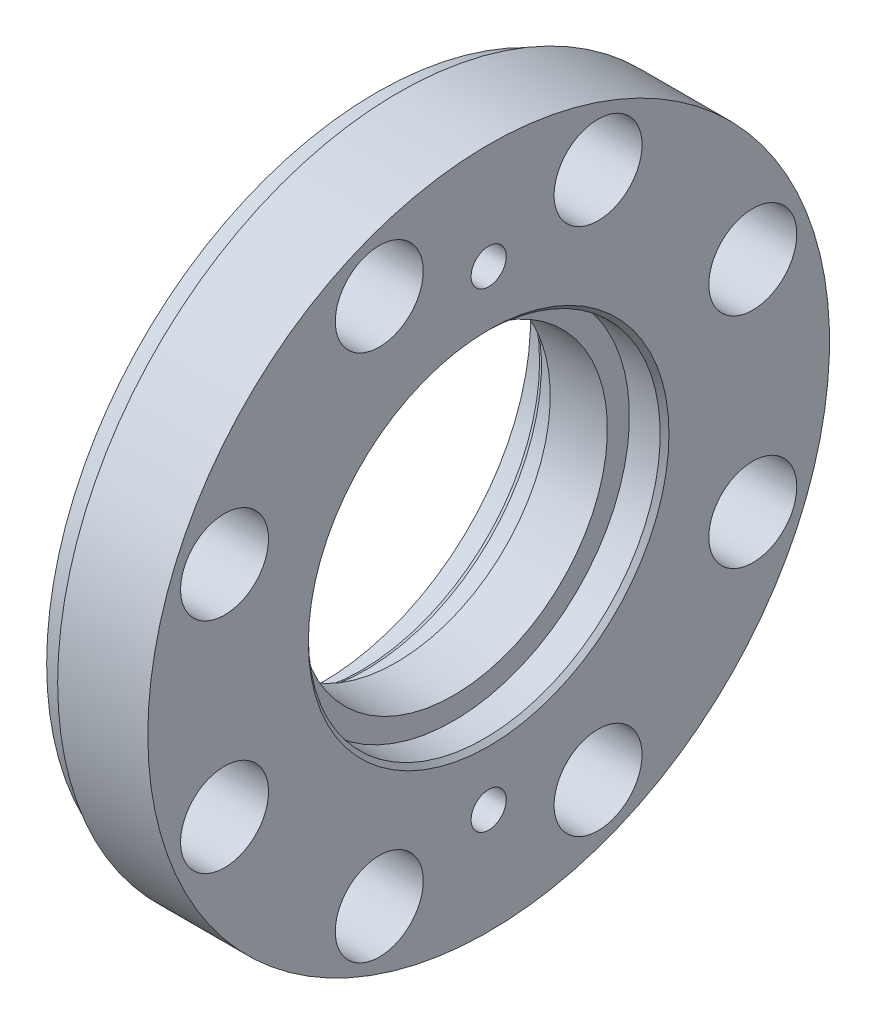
ISO-10303-21;
HEADER;
FILE_DESCRIPTION(('STEP AP214'),'2;1');
FILE_NAME('part.step','',(''),(''),'','','');
FILE_SCHEMA(('AUTOMOTIVE_DESIGN { 1 0 10303 214 1 1 1 1 }'));
ENDSEC;
DATA;
#1=APPLICATION_CONTEXT('core data for automotive mechanical design processes');
#2=APPLICATION_PROTOCOL_DEFINITION('international standard','automotive_design',2000,#1);
#3=PRODUCT_CONTEXT('',#1,'mechanical');
#4=PRODUCT('Part','Part','',(#3));
#5=PRODUCT_RELATED_PRODUCT_CATEGORY('part','',(#4));
#6=PRODUCT_DEFINITION_FORMATION('','',#4);
#7=PRODUCT_DEFINITION_CONTEXT('part definition',#1,'design');
#8=PRODUCT_DEFINITION('design','',#6,#7);
#9=PRODUCT_DEFINITION_SHAPE('','',#8);
#10=(LENGTH_UNIT() NAMED_UNIT(*) SI_UNIT(.MILLI.,.METRE.));
#11=(NAMED_UNIT(*) PLANE_ANGLE_UNIT() SI_UNIT($,.RADIAN.));
#12=(NAMED_UNIT(*) SI_UNIT($,.STERADIAN.) SOLID_ANGLE_UNIT());
#13=UNCERTAINTY_MEASURE_WITH_UNIT(LENGTH_MEASURE(1.E-05),#10,'distance_accuracy_value','');
#14=(GEOMETRIC_REPRESENTATION_CONTEXT(3) GLOBAL_UNCERTAINTY_ASSIGNED_CONTEXT((#13)) GLOBAL_UNIT_ASSIGNED_CONTEXT((#10,
#11,#12)) REPRESENTATION_CONTEXT('',''));
#15=CARTESIAN_POINT('',(0.,0.,0.));
#16=DIRECTION('',(0.,0.,1.));
#17=DIRECTION('',(1.,0.,0.));
#18=AXIS2_PLACEMENT_3D('',#15,#16,#17);
#19=CARTESIAN_POINT('',(0.,0.,0.));
#20=DIRECTION('',(1.,0.,0.));
#21=DIRECTION('',(0.,0.,-1.));
#22=AXIS2_PLACEMENT_3D('',#19,#20,#21);
#23=PLANE('',#22);
#24=CARTESIAN_POINT('',(0.,0.,0.));
#25=DIRECTION('',(1.,0.,0.));
#26=DIRECTION('',(0.,0.,-1.));
#27=AXIS2_PLACEMENT_3D('',#24,#25,#26);
#28=CIRCLE('',#27,53.);
#29=CARTESIAN_POINT('',(0.,0.,-53.));
#30=VERTEX_POINT('',#29);
#31=EDGE_CURVE('E197',#30,#30,#28,.F.);
#32=ORIENTED_EDGE('',*,*,#31,.T.);
#33=EDGE_LOOP('',(#32));
#34=FACE_BOUND('',#33,.T.);
#35=CARTESIAN_POINT('',(0.,0.,0.));
#36=DIRECTION('',(-1.,0.,0.));
#37=DIRECTION('',(0.,0.,1.));
#38=AXIS2_PLACEMENT_3D('',#35,#36,#37);
#39=CIRCLE('',#38,47.5);
#40=CARTESIAN_POINT('',(0.,0.,47.5));
#41=VERTEX_POINT('',#40);
#42=EDGE_CURVE('E166',#41,#41,#39,.T.);
#43=ORIENTED_EDGE('',*,*,#42,.F.);
#44=EDGE_LOOP('',(#43));
#45=FACE_BOUND('',#44,.T.);
#46=ADVANCED_FACE('F35',(#34,#45),#23,.F.);
#47=CARTESIAN_POINT('',(38.,77.5,0.));
#48=DIRECTION('',(-1.,0.,0.));
#49=DIRECTION('',(0.,0.,1.));
#50=AXIS2_PLACEMENT_3D('',#47,#48,#49);
#51=PLANE('',#50);
#52=CARTESIAN_POINT('',(38.,-53.5,-3.67649026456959E-13));
#53=DIRECTION('',(1.,0.,0.));
#54=DIRECTION('',(0.,0.,-1.));
#55=AXIS2_PLACEMENT_3D('',#52,#53,#54);
#56=CIRCLE('',#55,4.);
#57=CARTESIAN_POINT('',(38.,-53.5,-4.00000000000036));
#58=VERTEX_POINT('',#57);
#59=EDGE_CURVE('E59',#58,#58,#56,.T.);
#60=ORIENTED_EDGE('',*,*,#59,.F.);
#61=EDGE_LOOP('',(#60));
#62=FACE_BOUND('',#61,.T.);
#63=CARTESIAN_POINT('',(38.,53.5,0.));
#64=DIRECTION('',(1.,0.,0.));
#65=DIRECTION('',(0.,0.,-1.));
#66=AXIS2_PLACEMENT_3D('',#63,#64,#65);
#67=CIRCLE('',#66,4.);
#68=CARTESIAN_POINT('',(38.,53.5,-4.));
#69=VERTEX_POINT('',#68);
#70=EDGE_CURVE('E67',#69,#69,#67,.T.);
#71=ORIENTED_EDGE('',*,*,#70,.F.);
#72=EDGE_LOOP('',(#71));
#73=FACE_BOUND('',#72,.T.);
#74=CARTESIAN_POINT('',(38.,24.8744231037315,-60.0521696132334));
#75=DIRECTION('',(1.,0.,0.));
#76=DIRECTION('',(0.,0.,-1.));
#77=AXIS2_PLACEMENT_3D('',#74,#75,#76);
#78=CIRCLE('',#77,10.);
#79=CARTESIAN_POINT('',(38.,24.8744231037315,-70.0521696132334));
#80=VERTEX_POINT('',#79);
#81=EDGE_CURVE('E76',#80,#80,#78,.T.);
#82=ORIENTED_EDGE('',*,*,#81,.F.);
#83=EDGE_LOOP('',(#82));
#84=FACE_BOUND('',#83,.T.);
#85=CARTESIAN_POINT('',(38.,-24.8744231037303,-60.0521696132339));
#86=DIRECTION('',(1.,0.,0.));
#87=DIRECTION('',(0.,0.,-1.));
#88=AXIS2_PLACEMENT_3D('',#85,#86,#87);
#89=CIRCLE('',#88,10.);
#90=CARTESIAN_POINT('',(38.,-24.8744231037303,-70.0521696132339));
#91=VERTEX_POINT('',#90);
#92=EDGE_CURVE('E85',#91,#91,#89,.T.);
#93=ORIENTED_EDGE('',*,*,#92,.F.);
#94=EDGE_LOOP('',(#93));
#95=FACE_BOUND('',#94,.T.);
#96=CARTESIAN_POINT('',(38.,-60.0521696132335,-24.8744231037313));
#97=DIRECTION('',(1.,0.,0.));
#98=DIRECTION('',(0.,0.,-1.));
#99=AXIS2_PLACEMENT_3D('',#96,#97,#98);
#100=CIRCLE('',#99,10.);
#101=CARTESIAN_POINT('',(38.,-60.0521696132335,-34.8744231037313));
#102=VERTEX_POINT('',#101);
#103=EDGE_CURVE('E95',#102,#102,#100,.T.);
#104=ORIENTED_EDGE('',*,*,#103,.F.);
#105=EDGE_LOOP('',(#104));
#106=FACE_BOUND('',#105,.T.);
#107=CARTESIAN_POINT('',(38.,-60.0521696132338,24.8744231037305));
#108=DIRECTION('',(1.,0.,0.));
#109=DIRECTION('',(0.,0.,-1.));
#110=AXIS2_PLACEMENT_3D('',#107,#108,#109);
#111=CIRCLE('',#110,10.);
#112=CARTESIAN_POINT('',(38.,-60.0521696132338,14.8744231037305));
#113=VERTEX_POINT('',#112);
#114=EDGE_CURVE('E105',#113,#113,#111,.T.);
#115=ORIENTED_EDGE('',*,*,#114,.F.);
#116=EDGE_LOOP('',(#115));
#117=FACE_BOUND('',#116,.T.);
#118=CARTESIAN_POINT('',(38.,-24.8744231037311,60.0521696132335));
#119=DIRECTION('',(1.,0.,0.));
#120=DIRECTION('',(0.,0.,-1.));
#121=AXIS2_PLACEMENT_3D('',#118,#119,#120);
#122=CIRCLE('',#121,10.);
#123=CARTESIAN_POINT('',(38.,-24.8744231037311,50.0521696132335));
#124=VERTEX_POINT('',#123);
#125=EDGE_CURVE('E115',#124,#124,#122,.T.);
#126=ORIENTED_EDGE('',*,*,#125,.F.);
#127=EDGE_LOOP('',(#126));
#128=FACE_BOUND('',#127,.T.);
#129=CARTESIAN_POINT('',(38.,24.8744231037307,60.0521696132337));
#130=DIRECTION('',(1.,0.,0.));
#131=DIRECTION('',(0.,0.,-1.));
#132=AXIS2_PLACEMENT_3D('',#129,#130,#131);
#133=CIRCLE('',#132,10.);
#134=CARTESIAN_POINT('',(38.,24.8744231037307,50.0521696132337));
#135=VERTEX_POINT('',#134);
#136=EDGE_CURVE('E125',#135,#135,#133,.T.);
#137=ORIENTED_EDGE('',*,*,#136,.F.);
#138=EDGE_LOOP('',(#137));
#139=FACE_BOUND('',#138,.T.);
#140=CARTESIAN_POINT('',(38.,60.0521696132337,24.8744231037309));
#141=DIRECTION('',(1.,0.,0.));
#142=DIRECTION('',(0.,0.,-1.));
#143=AXIS2_PLACEMENT_3D('',#140,#141,#142);
#144=CIRCLE('',#143,10.);
#145=CARTESIAN_POINT('',(38.,60.0521696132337,14.8744231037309));
#146=VERTEX_POINT('',#145);
#147=EDGE_CURVE('E135',#146,#146,#144,.T.);
#148=ORIENTED_EDGE('',*,*,#147,.F.);
#149=EDGE_LOOP('',(#148));
#150=FACE_BOUND('',#149,.T.);
#151=CARTESIAN_POINT('',(38.,60.0521696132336,-24.8744231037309));
#152=DIRECTION('',(1.,0.,0.));
#153=DIRECTION('',(0.,0.,-1.));
#154=AXIS2_PLACEMENT_3D('',#151,#152,#153);
#155=CIRCLE('',#154,10.);
#156=CARTESIAN_POINT('',(38.,60.0521696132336,-34.8744231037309));
#157=VERTEX_POINT('',#156);
#158=EDGE_CURVE('E145',#157,#157,#155,.T.);
#159=ORIENTED_EDGE('',*,*,#158,.F.);
#160=EDGE_LOOP('',(#159));
#161=FACE_BOUND('',#160,.T.);
#162=CARTESIAN_POINT('',(38.,0.,0.));
#163=DIRECTION('',(-1.,0.,0.));
#164=DIRECTION('',(0.,0.,1.));
#165=AXIS2_PLACEMENT_3D('',#162,#163,#164);
#166=CIRCLE('',#165,41.);
#167=CARTESIAN_POINT('',(38.,0.,41.));
#168=VERTEX_POINT('',#167);
#169=EDGE_CURVE('E43',#168,#168,#166,.T.);
#170=ORIENTED_EDGE('',*,*,#169,.T.);
#171=EDGE_LOOP('',(#170));
#172=FACE_BOUND('',#171,.T.);
#173=CARTESIAN_POINT('',(38.,0.,0.));
#174=DIRECTION('',(-1.,0.,0.));
#175=DIRECTION('',(0.,0.,1.));
#176=AXIS2_PLACEMENT_3D('',#173,#174,#175);
#177=CIRCLE('',#176,77.5);
#178=CARTESIAN_POINT('',(38.,0.,77.5));
#179=VERTEX_POINT('',#178);
#180=EDGE_CURVE('E169',#179,#179,#177,.T.);
#181=ORIENTED_EDGE('',*,*,#180,.F.);
#182=EDGE_LOOP('',(#181));
#183=FACE_BOUND('',#182,.T.);
#184=ADVANCED_FACE('F247',(#62,#73,#84,#95,#106,#117,#128,#139,#150,#161,#172,#183),#51,.F.);
#185=CARTESIAN_POINT('',(0.,0.,0.));
#186=DIRECTION('',(-1.,0.,0.));
#187=DIRECTION('',(0.,0.,1.));
#188=AXIS2_PLACEMENT_3D('',#185,#186,#187);
#189=CYLINDRICAL_SURFACE('',#188,55.);
#190=CARTESIAN_POINT('',(2.,0.,0.));
#191=DIRECTION('',(1.,0.,0.));
#192=DIRECTION('',(0.,0.,-1.));
#193=AXIS2_PLACEMENT_3D('',#190,#191,#192);
#194=CIRCLE('',#193,55.);
#195=CARTESIAN_POINT('',(2.,0.,55.));
#196=VERTEX_POINT('',#195);
#197=EDGE_CURVE('E200',#196,#196,#194,.T.);
#198=CARTESIAN_POINT('',(3.,0.,0.));
#199=DIRECTION('',(-1.,0.,0.));
#200=DIRECTION('',(0.,0.,1.));
#201=AXIS2_PLACEMENT_3D('',#198,#199,#200);
#202=CIRCLE('',#201,55.);
#203=CARTESIAN_POINT('',(3.,0.,55.));
#204=VERTEX_POINT('',#203);
#205=EDGE_CURVE('E194',#204,#204,#202,.T.);
#206=CARTESIAN_POINT('',(2.,0.,55.));
#207=CARTESIAN_POINT('',(2.01041666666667,0.,55.));
#208=CARTESIAN_POINT('',(2.02083333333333,0.,55.));
#209=CARTESIAN_POINT('',(2.04166666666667,0.,55.));
#210=CARTESIAN_POINT('',(2.05208333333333,0.,55.));
#211=CARTESIAN_POINT('',(2.07291666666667,0.,55.));
#212=CARTESIAN_POINT('',(2.08333333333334,0.,55.));
#213=CARTESIAN_POINT('',(2.10416666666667,0.,55.));
#214=CARTESIAN_POINT('',(2.11458333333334,0.,55.));
#215=CARTESIAN_POINT('',(2.13541666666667,0.,55.));
#216=CARTESIAN_POINT('',(2.14583333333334,0.,55.));
#217=CARTESIAN_POINT('',(2.16666666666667,0.,55.));
#218=CARTESIAN_POINT('',(2.17708333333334,0.,55.));
#219=CARTESIAN_POINT('',(2.19791666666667,0.,55.));
#220=CARTESIAN_POINT('',(2.20833333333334,0.,55.));
#221=CARTESIAN_POINT('',(2.22916666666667,0.,55.));
#222=CARTESIAN_POINT('',(2.23958333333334,0.,55.));
#223=CARTESIAN_POINT('',(2.26041666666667,0.,55.));
#224=CARTESIAN_POINT('',(2.27083333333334,0.,55.));
#225=CARTESIAN_POINT('',(2.29166666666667,0.,55.));
#226=CARTESIAN_POINT('',(2.30208333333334,0.,55.));
#227=CARTESIAN_POINT('',(2.32291666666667,0.,55.));
#228=CARTESIAN_POINT('',(2.33333333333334,0.,55.));
#229=CARTESIAN_POINT('',(2.35416666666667,0.,55.));
#230=CARTESIAN_POINT('',(2.36458333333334,0.,55.));
#231=CARTESIAN_POINT('',(2.38541666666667,0.,55.));
#232=CARTESIAN_POINT('',(2.39583333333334,0.,55.));
#233=CARTESIAN_POINT('',(2.41666666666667,0.,55.));
#234=CARTESIAN_POINT('',(2.42708333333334,0.,55.));
#235=CARTESIAN_POINT('',(2.44791666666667,0.,55.));
#236=CARTESIAN_POINT('',(2.45833333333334,0.,55.));
#237=CARTESIAN_POINT('',(2.47916666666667,0.,55.));
#238=CARTESIAN_POINT('',(2.48958333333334,0.,55.));
#239=CARTESIAN_POINT('',(2.51041666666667,0.,55.));
#240=CARTESIAN_POINT('',(2.52083333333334,0.,55.));
#241=CARTESIAN_POINT('',(2.54166666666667,0.,55.));
#242=CARTESIAN_POINT('',(2.55208333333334,0.,55.));
#243=CARTESIAN_POINT('',(2.57291666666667,0.,55.));
#244=CARTESIAN_POINT('',(2.58333333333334,0.,55.));
#245=CARTESIAN_POINT('',(2.60416666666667,0.,55.));
#246=CARTESIAN_POINT('',(2.61458333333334,0.,55.));
#247=CARTESIAN_POINT('',(2.63541666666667,0.,55.));
#248=CARTESIAN_POINT('',(2.64583333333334,0.,55.));
#249=CARTESIAN_POINT('',(2.66666666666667,0.,55.));
#250=CARTESIAN_POINT('',(2.67708333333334,0.,55.));
#251=CARTESIAN_POINT('',(2.69791666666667,0.,55.));
#252=CARTESIAN_POINT('',(2.70833333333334,0.,55.));
#253=CARTESIAN_POINT('',(2.72916666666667,0.,55.));
#254=CARTESIAN_POINT('',(2.73958333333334,0.,55.));
#255=CARTESIAN_POINT('',(2.76041666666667,0.,55.));
#256=CARTESIAN_POINT('',(2.77083333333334,0.,55.));
#257=CARTESIAN_POINT('',(2.79166666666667,0.,55.));
#258=CARTESIAN_POINT('',(2.80208333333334,0.,55.));
#259=CARTESIAN_POINT('',(2.82291666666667,0.,55.));
#260=CARTESIAN_POINT('',(2.83333333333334,0.,55.));
#261=CARTESIAN_POINT('',(2.85416666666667,0.,55.));
#262=CARTESIAN_POINT('',(2.86458333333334,0.,55.));
#263=CARTESIAN_POINT('',(2.88541666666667,0.,55.));
#264=CARTESIAN_POINT('',(2.89583333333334,0.,55.));
#265=CARTESIAN_POINT('',(2.91666666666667,0.,55.));
#266=CARTESIAN_POINT('',(2.92708333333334,0.,55.));
#267=CARTESIAN_POINT('',(2.94791666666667,0.,55.));
#268=CARTESIAN_POINT('',(2.95833333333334,0.,55.));
#269=CARTESIAN_POINT('',(2.97916666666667,0.,55.));
#270=CARTESIAN_POINT('',(2.98958333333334,0.,55.));
#271=CARTESIAN_POINT('',(3.,0.,55.));
#272=B_SPLINE_CURVE_WITH_KNOTS('',3,(#206,#207,#208,#209,#210,#211,#212,#213,#214,#215,#216,
#217,#218,#219,#220,#221,#222,#223,#224,#225,#226,#227,#228,#229,#230,#231,#232,#233,#234,#235,
#236,#237,#238,#239,#240,#241,#242,#243,#244,#245,#246,#247,#248,#249,#250,#251,#252,#253,#254,
#255,#256,#257,#258,#259,#260,#261,#262,#263,#264,#265,#266,#267,#268,#269,#270,#271),
.UNSPECIFIED.,.F.,.F.,(4,2,2,2,2,2,2,2,2,2,2,2,2,2,2,2,2,2,2,2,2,2,2,2,2,2,2,2,2,2,2,2,4),(0.,
0.03125,0.0625000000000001,0.0937500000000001,0.125,0.15625,0.1875,0.21875,0.25,0.28125,
0.312500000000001,0.343750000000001,0.375000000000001,0.406250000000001,0.437500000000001,
0.46875,0.5,0.53125,0.5625,0.593750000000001,0.625000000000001,0.656250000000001,
0.687500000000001,0.718750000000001,0.750000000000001,0.781250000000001,0.812500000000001,
0.843750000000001,0.875000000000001,0.906250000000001,0.937500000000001,0.968750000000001,1.),.UNSPECIFIED.);
#273=EDGE_CURVE('BSEAM252',#196,#204,#272,.T.);
#274=ORIENTED_EDGE('',*,*,#197,.T.);
#275=ORIENTED_EDGE('',*,*,#205,.T.);
#276=ORIENTED_EDGE('',*,*,#273,.T.);
#277=ORIENTED_EDGE('',*,*,#273,.F.);
#278=EDGE_LOOP('',(#274,#276,#275,#277));
#279=FACE_BOUND('',#278,.T.);
#280=ADVANCED_FACE('F252',(#279),#189,.T.);
#281=CARTESIAN_POINT('',(3.,55.,0.));
#282=DIRECTION('',(-1.,0.,0.));
#283=DIRECTION('',(0.,0.,1.));
#284=AXIS2_PLACEMENT_3D('',#281,#282,#283);
#285=PLANE('',#284);
#286=ORIENTED_EDGE('',*,*,#205,.F.);
#287=EDGE_LOOP('',(#286));
#288=FACE_BOUND('',#287,.T.);
#289=CARTESIAN_POINT('',(3.,0.,0.));
#290=DIRECTION('',(-1.,0.,0.));
#291=DIRECTION('',(0.,0.,1.));
#292=AXIS2_PLACEMENT_3D('',#289,#290,#291);
#293=CIRCLE('',#292,51.9);
#294=CARTESIAN_POINT('',(3.,0.,51.9));
#295=VERTEX_POINT('',#294);
#296=EDGE_CURVE('E191',#295,#295,#293,.T.);
#297=ORIENTED_EDGE('',*,*,#296,.T.);
#298=EDGE_LOOP('',(#297));
#299=FACE_BOUND('',#298,.T.);
#300=ADVANCED_FACE('F308',(#288,#299),#285,.F.);
#301=CARTESIAN_POINT('',(0.,0.,0.));
#302=DIRECTION('',(-1.,0.,0.));
#303=DIRECTION('',(0.,0.,1.));
#304=AXIS2_PLACEMENT_3D('',#301,#302,#303);
#305=CYLINDRICAL_SURFACE('',#304,51.9);
#306=CARTESIAN_POINT('',(7.8,0.,0.));
#307=DIRECTION('',(-1.,0.,0.));
#308=DIRECTION('',(0.,0.,1.));
#309=AXIS2_PLACEMENT_3D('',#306,#307,#308);
#310=CIRCLE('',#309,51.9);
#311=CARTESIAN_POINT('',(7.8,0.,51.9));
#312=VERTEX_POINT('',#311);
#313=EDGE_CURVE('E188',#312,#312,#310,.T.);
#314=CARTESIAN_POINT('',(3.,0.,51.9));
#315=CARTESIAN_POINT('',(3.05,0.,51.9));
#316=CARTESIAN_POINT('',(3.1,0.,51.9));
#317=CARTESIAN_POINT('',(3.2,0.,51.9));
#318=CARTESIAN_POINT('',(3.25,0.,51.9));
#319=CARTESIAN_POINT('',(3.35,0.,51.9));
#320=CARTESIAN_POINT('',(3.4,0.,51.9));
#321=CARTESIAN_POINT('',(3.5,0.,51.9));
#322=CARTESIAN_POINT('',(3.55,0.,51.9));
#323=CARTESIAN_POINT('',(3.65,0.,51.9));
#324=CARTESIAN_POINT('',(3.7,0.,51.9));
#325=CARTESIAN_POINT('',(3.8,0.,51.9));
#326=CARTESIAN_POINT('',(3.85,0.,51.9));
#327=CARTESIAN_POINT('',(3.95,0.,51.9));
#328=CARTESIAN_POINT('',(4.,0.,51.9));
#329=CARTESIAN_POINT('',(4.1,0.,51.9));
#330=CARTESIAN_POINT('',(4.15,0.,51.9));
#331=CARTESIAN_POINT('',(4.25,0.,51.9));
#332=CARTESIAN_POINT('',(4.3,0.,51.9));
#333=CARTESIAN_POINT('',(4.4,0.,51.9));
#334=CARTESIAN_POINT('',(4.45,0.,51.9));
#335=CARTESIAN_POINT('',(4.55,0.,51.9));
#336=CARTESIAN_POINT('',(4.6,0.,51.9));
#337=CARTESIAN_POINT('',(4.7,0.,51.9));
#338=CARTESIAN_POINT('',(4.75,0.,51.9));
#339=CARTESIAN_POINT('',(4.85,0.,51.9));
#340=CARTESIAN_POINT('',(4.9,0.,51.9));
#341=CARTESIAN_POINT('',(5.,0.,51.9));
#342=CARTESIAN_POINT('',(5.05,0.,51.9));
#343=CARTESIAN_POINT('',(5.15,0.,51.9));
#344=CARTESIAN_POINT('',(5.2,0.,51.9));
#345=CARTESIAN_POINT('',(5.3,0.,51.9));
#346=CARTESIAN_POINT('',(5.35,0.,51.9));
#347=CARTESIAN_POINT('',(5.45,0.,51.9));
#348=CARTESIAN_POINT('',(5.5,0.,51.9));
#349=CARTESIAN_POINT('',(5.6,0.,51.9));
#350=CARTESIAN_POINT('',(5.65,0.,51.9));
#351=CARTESIAN_POINT('',(5.75,0.,51.9));
#352=CARTESIAN_POINT('',(5.8,0.,51.9));
#353=CARTESIAN_POINT('',(5.9,0.,51.9));
#354=CARTESIAN_POINT('',(5.95,0.,51.9));
#355=CARTESIAN_POINT('',(6.05,0.,51.9));
#356=CARTESIAN_POINT('',(6.1,0.,51.9));
#357=CARTESIAN_POINT('',(6.2,0.,51.9));
#358=CARTESIAN_POINT('',(6.25,0.,51.9));
#359=CARTESIAN_POINT('',(6.35,0.,51.9));
#360=CARTESIAN_POINT('',(6.4,0.,51.9));
#361=CARTESIAN_POINT('',(6.5,0.,51.9));
#362=CARTESIAN_POINT('',(6.55,0.,51.9));
#363=CARTESIAN_POINT('',(6.65,0.,51.9));
#364=CARTESIAN_POINT('',(6.7,0.,51.9));
#365=CARTESIAN_POINT('',(6.8,0.,51.9));
#366=CARTESIAN_POINT('',(6.85,0.,51.9));
#367=CARTESIAN_POINT('',(6.95,0.,51.9));
#368=CARTESIAN_POINT('',(7.,0.,51.9));
#369=CARTESIAN_POINT('',(7.1,0.,51.9));
#370=CARTESIAN_POINT('',(7.15,0.,51.9));
#371=CARTESIAN_POINT('',(7.25,0.,51.9));
#372=CARTESIAN_POINT('',(7.3,0.,51.9));
#373=CARTESIAN_POINT('',(7.4,0.,51.9));
#374=CARTESIAN_POINT('',(7.45,0.,51.9));
#375=CARTESIAN_POINT('',(7.55,0.,51.9));
#376=CARTESIAN_POINT('',(7.6,0.,51.9));
#377=CARTESIAN_POINT('',(7.7,0.,51.9));
#378=CARTESIAN_POINT('',(7.75,0.,51.9));
#379=CARTESIAN_POINT('',(7.8,0.,51.9));
#380=B_SPLINE_CURVE_WITH_KNOTS('',3,(#314,#315,#316,#317,#318,#319,#320,#321,#322,#323,#324,
#325,#326,#327,#328,#329,#330,#331,#332,#333,#334,#335,#336,#337,#338,#339,#340,#341,#342,#343,
#344,#345,#346,#347,#348,#349,#350,#351,#352,#353,#354,#355,#356,#357,#358,#359,#360,#361,#362,
#363,#364,#365,#366,#367,#368,#369,#370,#371,#372,#373,#374,#375,#376,#377,#378,#379),
.UNSPECIFIED.,.F.,.F.,(4,2,2,2,2,2,2,2,2,2,2,2,2,2,2,2,2,2,2,2,2,2,2,2,2,2,2,2,2,2,2,2,4),(0.,
0.15,0.3,0.449999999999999,0.599999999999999,0.749999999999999,0.9,1.05,1.2,1.35,1.5,1.65,1.8,
1.95,2.1,2.25,2.4,2.55,2.7,2.85,3.,3.15,3.3,3.45,3.6,3.75,3.9,4.05,4.2,4.35,4.5,4.65,4.8),.UNSPECIFIED.);
#381=EDGE_CURVE('BSEAM304',#295,#312,#380,.T.);
#382=ORIENTED_EDGE('',*,*,#296,.F.);
#383=ORIENTED_EDGE('',*,*,#313,.T.);
#384=ORIENTED_EDGE('',*,*,#381,.T.);
#385=ORIENTED_EDGE('',*,*,#381,.F.);
#386=EDGE_LOOP('',(#382,#384,#383,#385));
#387=FACE_BOUND('',#386,.T.);
#388=ADVANCED_FACE('F304',(#387),#305,.T.);
#389=CARTESIAN_POINT('',(7.8,51.9,0.));
#390=DIRECTION('',(1.,0.,0.));
#391=DIRECTION('',(0.,0.,-1.));
#392=AXIS2_PLACEMENT_3D('',#389,#390,#391);
#393=PLANE('',#392);
#394=ORIENTED_EDGE('',*,*,#313,.F.);
#395=EDGE_LOOP('',(#394));
#396=FACE_BOUND('',#395,.T.);
#397=CARTESIAN_POINT('',(7.8,0.,0.));
#398=DIRECTION('',(-1.,0.,0.));
#399=DIRECTION('',(0.,0.,1.));
#400=AXIS2_PLACEMENT_3D('',#397,#398,#399);
#401=CIRCLE('',#400,55.);
#402=CARTESIAN_POINT('',(7.8,0.,55.));
#403=VERTEX_POINT('',#402);
#404=EDGE_CURVE('E185',#403,#403,#401,.T.);
#405=ORIENTED_EDGE('',*,*,#404,.T.);
#406=EDGE_LOOP('',(#405));
#407=FACE_BOUND('',#406,.T.);
#408=ADVANCED_FACE('F300',(#396,#407),#393,.F.);
#409=CARTESIAN_POINT('',(0.,0.,0.));
#410=DIRECTION('',(-1.,0.,0.));
#411=DIRECTION('',(0.,0.,1.));
#412=AXIS2_PLACEMENT_3D('',#409,#410,#411);
#413=CYLINDRICAL_SURFACE('',#412,55.);
#414=CARTESIAN_POINT('',(12.5,0.,0.));
#415=DIRECTION('',(-1.,0.,0.));
#416=DIRECTION('',(0.,0.,1.));
#417=AXIS2_PLACEMENT_3D('',#414,#415,#416);
#418=CIRCLE('',#417,55.);
#419=CARTESIAN_POINT('',(12.5,0.,55.));
#420=VERTEX_POINT('',#419);
#421=EDGE_CURVE('E182',#420,#420,#418,.T.);
#422=CARTESIAN_POINT('',(7.8,0.,55.));
#423=CARTESIAN_POINT('',(7.84895833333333,0.,55.));
#424=CARTESIAN_POINT('',(7.89791666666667,0.,55.));
#425=CARTESIAN_POINT('',(7.99583333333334,0.,55.));
#426=CARTESIAN_POINT('',(8.04479166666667,0.,55.));
#427=CARTESIAN_POINT('',(8.14270833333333,0.,55.));
#428=CARTESIAN_POINT('',(8.19166666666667,0.,55.));
#429=CARTESIAN_POINT('',(8.28958333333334,0.,55.));
#430=CARTESIAN_POINT('',(8.33854166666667,0.,55.));
#431=CARTESIAN_POINT('',(8.43645833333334,0.,55.));
#432=CARTESIAN_POINT('',(8.48541666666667,0.,55.));
#433=CARTESIAN_POINT('',(8.58333333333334,0.,55.));
#434=CARTESIAN_POINT('',(8.63229166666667,0.,55.));
#435=CARTESIAN_POINT('',(8.73020833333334,0.,55.));
#436=CARTESIAN_POINT('',(8.77916666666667,0.,55.));
#437=CARTESIAN_POINT('',(8.87708333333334,0.,55.));
#438=CARTESIAN_POINT('',(8.92604166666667,0.,55.));
#439=CARTESIAN_POINT('',(9.02395833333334,0.,55.));
#440=CARTESIAN_POINT('',(9.07291666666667,0.,55.));
#441=CARTESIAN_POINT('',(9.17083333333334,0.,55.));
#442=CARTESIAN_POINT('',(9.21979166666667,0.,55.));
#443=CARTESIAN_POINT('',(9.31770833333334,0.,55.));
#444=CARTESIAN_POINT('',(9.36666666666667,0.,55.));
#445=CARTESIAN_POINT('',(9.46458333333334,0.,55.));
#446=CARTESIAN_POINT('',(9.51354166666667,0.,55.));
#447=CARTESIAN_POINT('',(9.61145833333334,0.,55.));
#448=CARTESIAN_POINT('',(9.66041666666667,0.,55.));
#449=CARTESIAN_POINT('',(9.75833333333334,0.,55.));
#450=CARTESIAN_POINT('',(9.80729166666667,0.,55.));
#451=CARTESIAN_POINT('',(9.90520833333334,0.,55.));
#452=CARTESIAN_POINT('',(9.95416666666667,0.,55.));
#453=CARTESIAN_POINT('',(10.0520833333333,0.,55.));
#454=CARTESIAN_POINT('',(10.1010416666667,0.,55.));
#455=CARTESIAN_POINT('',(10.1989583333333,0.,55.));
#456=CARTESIAN_POINT('',(10.2479166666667,0.,55.));
#457=CARTESIAN_POINT('',(10.3458333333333,0.,55.));
#458=CARTESIAN_POINT('',(10.3947916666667,0.,55.));
#459=CARTESIAN_POINT('',(10.4927083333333,0.,55.));
#460=CARTESIAN_POINT('',(10.5416666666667,0.,55.));
#461=CARTESIAN_POINT('',(10.6395833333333,0.,55.));
#462=CARTESIAN_POINT('',(10.6885416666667,0.,55.));
#463=CARTESIAN_POINT('',(10.7864583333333,0.,55.));
#464=CARTESIAN_POINT('',(10.8354166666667,0.,55.));
#465=CARTESIAN_POINT('',(10.9333333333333,0.,55.));
#466=CARTESIAN_POINT('',(10.9822916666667,0.,55.));
#467=CARTESIAN_POINT('',(11.0802083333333,0.,55.));
#468=CARTESIAN_POINT('',(11.1291666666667,0.,55.));
#469=CARTESIAN_POINT('',(11.2270833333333,0.,55.));
#470=CARTESIAN_POINT('',(11.2760416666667,0.,55.));
#471=CARTESIAN_POINT('',(11.3739583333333,0.,55.));
#472=CARTESIAN_POINT('',(11.4229166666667,0.,55.));
#473=CARTESIAN_POINT('',(11.5208333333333,0.,55.));
#474=CARTESIAN_POINT('',(11.5697916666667,0.,55.));
#475=CARTESIAN_POINT('',(11.6677083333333,0.,55.));
#476=CARTESIAN_POINT('',(11.7166666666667,0.,55.));
#477=CARTESIAN_POINT('',(11.8145833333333,0.,55.));
#478=CARTESIAN_POINT('',(11.8635416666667,0.,55.));
#479=CARTESIAN_POINT('',(11.9614583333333,0.,55.));
#480=CARTESIAN_POINT('',(12.0104166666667,0.,55.));
#481=CARTESIAN_POINT('',(12.1083333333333,0.,55.));
#482=CARTESIAN_POINT('',(12.1572916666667,0.,55.));
#483=CARTESIAN_POINT('',(12.2552083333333,0.,55.));
#484=CARTESIAN_POINT('',(12.3041666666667,0.,55.));
#485=CARTESIAN_POINT('',(12.4020833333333,0.,55.));
#486=CARTESIAN_POINT('',(12.4510416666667,0.,55.));
#487=CARTESIAN_POINT('',(12.5,0.,55.));
#488=B_SPLINE_CURVE_WITH_KNOTS('',3,(#422,#423,#424,#425,#426,#427,#428,#429,#430,#431,#432,
#433,#434,#435,#436,#437,#438,#439,#440,#441,#442,#443,#444,#445,#446,#447,#448,#449,#450,#451,
#452,#453,#454,#455,#456,#457,#458,#459,#460,#461,#462,#463,#464,#465,#466,#467,#468,#469,#470,
#471,#472,#473,#474,#475,#476,#477,#478,#479,#480,#481,#482,#483,#484,#485,#486,#487),
.UNSPECIFIED.,.F.,.F.,(4,2,2,2,2,2,2,2,2,2,2,2,2,2,2,2,2,2,2,2,2,2,2,2,2,2,2,2,2,2,2,2,4),(0.,
0.146875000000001,0.293750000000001,0.440625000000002,0.587500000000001,0.734375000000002,
0.881250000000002,1.028125,1.175,1.321875,1.46875,1.615625,1.76250000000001,1.909375,2.05625,
2.20312500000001,2.35,2.496875,2.64375000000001,2.79062500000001,2.93750000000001,
3.08437500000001,3.23125000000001,3.37812500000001,3.52500000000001,3.67187500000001,
3.81875000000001,3.96562500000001,4.11250000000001,4.25937500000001,4.40625000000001,
4.55312500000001,4.70000000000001),.UNSPECIFIED.);
#489=EDGE_CURVE('BSEAM296',#403,#420,#488,.T.);
#490=ORIENTED_EDGE('',*,*,#404,.F.);
#491=ORIENTED_EDGE('',*,*,#421,.T.);
#492=ORIENTED_EDGE('',*,*,#489,.T.);
#493=ORIENTED_EDGE('',*,*,#489,.F.);
#494=EDGE_LOOP('',(#490,#492,#491,#493));
#495=FACE_BOUND('',#494,.T.);
#496=ADVANCED_FACE('F296',(#495),#413,.T.);
#497=CARTESIAN_POINT('',(12.5,55.,0.));
#498=DIRECTION('',(1.,0.,0.));
#499=DIRECTION('',(0.,0.,-1.));
#500=AXIS2_PLACEMENT_3D('',#497,#498,#499);
#501=PLANE('',#500);
#502=CARTESIAN_POINT('',(12.5,24.8744231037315,-60.0521696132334));
#503=DIRECTION('',(1.,0.,0.));
#504=DIRECTION('',(0.,0.,-1.));
#505=AXIS2_PLACEMENT_3D('',#502,#503,#504);
#506=CIRCLE('',#505,6.5);
#507=CARTESIAN_POINT('',(12.5,24.8744231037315,-66.5521696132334));
#508=VERTEX_POINT('',#507);
#509=EDGE_CURVE('E38',#508,#508,#506,.T.);
#510=ORIENTED_EDGE('',*,*,#509,.T.);
#511=EDGE_LOOP('',(#510));
#512=FACE_BOUND('',#511,.T.);
#513=CARTESIAN_POINT('',(12.5,-24.8744231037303,-60.0521696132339));
#514=DIRECTION('',(1.,0.,0.));
#515=DIRECTION('',(0.,0.,-1.));
#516=AXIS2_PLACEMENT_3D('',#513,#514,#515);
#517=CIRCLE('',#516,6.5);
#518=CARTESIAN_POINT('',(12.5,-24.8744231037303,-66.5521696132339));
#519=VERTEX_POINT('',#518);
#520=EDGE_CURVE('E88',#519,#519,#517,.T.);
#521=ORIENTED_EDGE('',*,*,#520,.T.);
#522=EDGE_LOOP('',(#521));
#523=FACE_BOUND('',#522,.T.);
#524=CARTESIAN_POINT('',(12.5,-60.0521696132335,-24.8744231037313));
#525=DIRECTION('',(1.,0.,0.));
#526=DIRECTION('',(0.,0.,-1.));
#527=AXIS2_PLACEMENT_3D('',#524,#525,#526);
#528=CIRCLE('',#527,6.5);
#529=CARTESIAN_POINT('',(12.5,-60.0521696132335,-31.3744231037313));
#530=VERTEX_POINT('',#529);
#531=EDGE_CURVE('E98',#530,#530,#528,.T.);
#532=ORIENTED_EDGE('',*,*,#531,.T.);
#533=EDGE_LOOP('',(#532));
#534=FACE_BOUND('',#533,.T.);
#535=CARTESIAN_POINT('',(12.5,-60.0521696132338,24.8744231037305));
#536=DIRECTION('',(1.,0.,0.));
#537=DIRECTION('',(0.,0.,-1.));
#538=AXIS2_PLACEMENT_3D('',#535,#536,#537);
#539=CIRCLE('',#538,6.5);
#540=CARTESIAN_POINT('',(12.5,-60.0521696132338,18.3744231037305));
#541=VERTEX_POINT('',#540);
#542=EDGE_CURVE('E108',#541,#541,#539,.T.);
#543=ORIENTED_EDGE('',*,*,#542,.T.);
#544=EDGE_LOOP('',(#543));
#545=FACE_BOUND('',#544,.T.);
#546=CARTESIAN_POINT('',(12.5,-24.8744231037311,60.0521696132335));
#547=DIRECTION('',(1.,0.,0.));
#548=DIRECTION('',(0.,0.,-1.));
#549=AXIS2_PLACEMENT_3D('',#546,#547,#548);
#550=CIRCLE('',#549,6.5);
#551=CARTESIAN_POINT('',(12.5,-24.8744231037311,53.5521696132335));
#552=VERTEX_POINT('',#551);
#553=EDGE_CURVE('E118',#552,#552,#550,.T.);
#554=ORIENTED_EDGE('',*,*,#553,.T.);
#555=EDGE_LOOP('',(#554));
#556=FACE_BOUND('',#555,.T.);
#557=CARTESIAN_POINT('',(12.5,24.8744231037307,60.0521696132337));
#558=DIRECTION('',(1.,0.,0.));
#559=DIRECTION('',(0.,0.,-1.));
#560=AXIS2_PLACEMENT_3D('',#557,#558,#559);
#561=CIRCLE('',#560,6.5);
#562=CARTESIAN_POINT('',(12.5,24.8744231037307,53.5521696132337));
#563=VERTEX_POINT('',#562);
#564=EDGE_CURVE('E128',#563,#563,#561,.T.);
#565=ORIENTED_EDGE('',*,*,#564,.T.);
#566=EDGE_LOOP('',(#565));
#567=FACE_BOUND('',#566,.T.);
#568=CARTESIAN_POINT('',(12.5,60.0521696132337,24.8744231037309));
#569=DIRECTION('',(1.,0.,0.));
#570=DIRECTION('',(0.,0.,-1.));
#571=AXIS2_PLACEMENT_3D('',#568,#569,#570);
#572=CIRCLE('',#571,6.49999999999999);
#573=CARTESIAN_POINT('',(12.5,60.0521696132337,18.3744231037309));
#574=VERTEX_POINT('',#573);
#575=EDGE_CURVE('E138',#574,#574,#572,.T.);
#576=ORIENTED_EDGE('',*,*,#575,.T.);
#577=EDGE_LOOP('',(#576));
#578=FACE_BOUND('',#577,.T.);
#579=CARTESIAN_POINT('',(12.5,60.0521696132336,-24.8744231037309));
#580=DIRECTION('',(1.,0.,0.));
#581=DIRECTION('',(0.,0.,-1.));
#582=AXIS2_PLACEMENT_3D('',#579,#580,#581);
#583=CIRCLE('',#582,6.49999999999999);
#584=CARTESIAN_POINT('',(12.5,60.0521696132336,-31.3744231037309));
#585=VERTEX_POINT('',#584);
#586=EDGE_CURVE('E148',#585,#585,#583,.T.);
#587=ORIENTED_EDGE('',*,*,#586,.T.);
#588=EDGE_LOOP('',(#587));
#589=FACE_BOUND('',#588,.T.);
#590=ORIENTED_EDGE('',*,*,#421,.F.);
#591=EDGE_LOOP('',(#590));
#592=FACE_BOUND('',#591,.T.);
#593=CARTESIAN_POINT('',(12.5,0.,0.));
#594=DIRECTION('',(-1.,0.,0.));
#595=DIRECTION('',(0.,0.,1.));
#596=AXIS2_PLACEMENT_3D('',#593,#594,#595);
#597=CIRCLE('',#596,75.);
#598=CARTESIAN_POINT('',(12.5,0.,75.));
#599=VERTEX_POINT('',#598);
#600=EDGE_CURVE('E178',#599,#599,#597,.T.);
#601=ORIENTED_EDGE('',*,*,#600,.T.);
#602=EDGE_LOOP('',(#601));
#603=FACE_BOUND('',#602,.T.);
#604=ADVANCED_FACE('F225',(#512,#523,#534,#545,#556,#567,#578,#589,#592,#603),#501,.F.);
#605=CARTESIAN_POINT('',(0.,0.,0.));
#606=DIRECTION('',(-1.,0.,0.));
#607=DIRECTION('',(0.,0.,1.));
#608=AXIS2_PLACEMENT_3D('',#605,#606,#607);
#609=CYLINDRICAL_SURFACE('',#608,75.);
#610=CARTESIAN_POINT('',(17.5,0.,0.));
#611=DIRECTION('',(-1.,0.,0.));
#612=DIRECTION('',(0.,0.,1.));
#613=AXIS2_PLACEMENT_3D('',#610,#611,#612);
#614=CIRCLE('',#613,75.);
#615=CARTESIAN_POINT('',(17.5,0.,75.));
#616=VERTEX_POINT('',#615);
#617=EDGE_CURVE('E175',#616,#616,#614,.T.);
#618=CARTESIAN_POINT('',(12.5,0.,75.));
#619=CARTESIAN_POINT('',(12.5520833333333,0.,75.));
#620=CARTESIAN_POINT('',(12.6041666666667,0.,75.));
#621=CARTESIAN_POINT('',(12.7083333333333,0.,75.));
#622=CARTESIAN_POINT('',(12.7604166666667,0.,75.));
#623=CARTESIAN_POINT('',(12.8645833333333,0.,75.));
#624=CARTESIAN_POINT('',(12.9166666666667,0.,75.));
#625=CARTESIAN_POINT('',(13.0208333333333,0.,75.));
#626=CARTESIAN_POINT('',(13.0729166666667,0.,75.));
#627=CARTESIAN_POINT('',(13.1770833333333,0.,75.));
#628=CARTESIAN_POINT('',(13.2291666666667,0.,75.));
#629=CARTESIAN_POINT('',(13.3333333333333,0.,75.));
#630=CARTESIAN_POINT('',(13.3854166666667,0.,75.));
#631=CARTESIAN_POINT('',(13.4895833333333,0.,75.));
#632=CARTESIAN_POINT('',(13.5416666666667,0.,75.));
#633=CARTESIAN_POINT('',(13.6458333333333,0.,75.));
#634=CARTESIAN_POINT('',(13.6979166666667,0.,75.));
#635=CARTESIAN_POINT('',(13.8020833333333,0.,75.));
#636=CARTESIAN_POINT('',(13.8541666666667,0.,75.));
#637=CARTESIAN_POINT('',(13.9583333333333,0.,75.));
#638=CARTESIAN_POINT('',(14.0104166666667,0.,75.));
#639=CARTESIAN_POINT('',(14.1145833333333,0.,75.));
#640=CARTESIAN_POINT('',(14.1666666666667,0.,75.));
#641=CARTESIAN_POINT('',(14.2708333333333,0.,75.));
#642=CARTESIAN_POINT('',(14.3229166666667,0.,75.));
#643=CARTESIAN_POINT('',(14.4270833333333,0.,75.));
#644=CARTESIAN_POINT('',(14.4791666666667,0.,75.));
#645=CARTESIAN_POINT('',(14.5833333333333,0.,75.));
#646=CARTESIAN_POINT('',(14.6354166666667,0.,75.));
#647=CARTESIAN_POINT('',(14.7395833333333,0.,75.));
#648=CARTESIAN_POINT('',(14.7916666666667,0.,75.));
#649=CARTESIAN_POINT('',(14.8958333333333,0.,75.));
#650=CARTESIAN_POINT('',(14.9479166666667,0.,75.));
#651=CARTESIAN_POINT('',(15.0520833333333,0.,75.));
#652=CARTESIAN_POINT('',(15.1041666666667,0.,75.));
#653=CARTESIAN_POINT('',(15.2083333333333,0.,75.));
#654=CARTESIAN_POINT('',(15.2604166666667,0.,75.));
#655=CARTESIAN_POINT('',(15.3645833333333,0.,75.));
#656=CARTESIAN_POINT('',(15.4166666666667,0.,75.));
#657=CARTESIAN_POINT('',(15.5208333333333,0.,75.));
#658=CARTESIAN_POINT('',(15.5729166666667,0.,75.));
#659=CARTESIAN_POINT('',(15.6770833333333,0.,75.));
#660=CARTESIAN_POINT('',(15.7291666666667,0.,75.));
#661=CARTESIAN_POINT('',(15.8333333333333,0.,75.));
#662=CARTESIAN_POINT('',(15.8854166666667,0.,75.));
#663=CARTESIAN_POINT('',(15.9895833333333,0.,75.));
#664=CARTESIAN_POINT('',(16.0416666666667,0.,75.));
#665=CARTESIAN_POINT('',(16.1458333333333,0.,75.));
#666=CARTESIAN_POINT('',(16.1979166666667,0.,75.));
#667=CARTESIAN_POINT('',(16.3020833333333,0.,75.));
#668=CARTESIAN_POINT('',(16.3541666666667,0.,75.));
#669=CARTESIAN_POINT('',(16.4583333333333,0.,75.));
#670=CARTESIAN_POINT('',(16.5104166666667,0.,75.));
#671=CARTESIAN_POINT('',(16.6145833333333,0.,75.));
#672=CARTESIAN_POINT('',(16.6666666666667,0.,75.));
#673=CARTESIAN_POINT('',(16.7708333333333,0.,75.));
#674=CARTESIAN_POINT('',(16.8229166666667,0.,75.));
#675=CARTESIAN_POINT('',(16.9270833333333,0.,75.));
#676=CARTESIAN_POINT('',(16.9791666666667,0.,75.));
#677=CARTESIAN_POINT('',(17.0833333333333,0.,75.));
#678=CARTESIAN_POINT('',(17.1354166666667,0.,75.));
#679=CARTESIAN_POINT('',(17.2395833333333,0.,75.));
#680=CARTESIAN_POINT('',(17.2916666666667,0.,75.));
#681=CARTESIAN_POINT('',(17.3958333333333,0.,75.));
#682=CARTESIAN_POINT('',(17.4479166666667,0.,75.));
#683=CARTESIAN_POINT('',(17.5,0.,75.));
#684=B_SPLINE_CURVE_WITH_KNOTS('',3,(#618,#619,#620,#621,#622,#623,#624,#625,#626,#627,#628,
#629,#630,#631,#632,#633,#634,#635,#636,#637,#638,#639,#640,#641,#642,#643,#644,#645,#646,#647,
#648,#649,#650,#651,#652,#653,#654,#655,#656,#657,#658,#659,#660,#661,#662,#663,#664,#665,#666,
#667,#668,#669,#670,#671,#672,#673,#674,#675,#676,#677,#678,#679,#680,#681,#682,#683),
.UNSPECIFIED.,.F.,.F.,(4,2,2,2,2,2,2,2,2,2,2,2,2,2,2,2,2,2,2,2,2,2,2,2,2,2,2,2,2,2,2,2,4),(0.,
0.15625,0.312499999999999,0.468749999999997,0.624999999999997,0.781249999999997,
0.937499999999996,1.09374999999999,1.24999999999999,1.40624999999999,1.56249999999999,
1.71874999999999,1.87499999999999,2.03124999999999,2.18749999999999,2.34374999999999,
2.49999999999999,2.65624999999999,2.81249999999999,2.96874999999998,3.12499999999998,
3.28124999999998,3.43749999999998,3.59374999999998,3.74999999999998,3.90624999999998,
4.06249999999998,4.21874999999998,4.37499999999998,4.53124999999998,4.68749999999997,
4.84374999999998,4.99999999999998),.UNSPECIFIED.);
#685=EDGE_CURVE('BSEAM289',#599,#616,#684,.T.);
#686=ORIENTED_EDGE('',*,*,#600,.F.);
#687=ORIENTED_EDGE('',*,*,#617,.T.);
#688=ORIENTED_EDGE('',*,*,#685,.T.);
#689=ORIENTED_EDGE('',*,*,#685,.F.);
#690=EDGE_LOOP('',(#686,#688,#687,#689));
#691=FACE_BOUND('',#690,.T.);
#692=ADVANCED_FACE('F289',(#691),#609,.T.);
#693=CARTESIAN_POINT('',(17.5,75.,0.));
#694=DIRECTION('',(1.,0.,0.));
#695=DIRECTION('',(0.,0.,-1.));
#696=AXIS2_PLACEMENT_3D('',#693,#694,#695);
#697=PLANE('',#696);
#698=ORIENTED_EDGE('',*,*,#617,.F.);
#699=EDGE_LOOP('',(#698));
#700=FACE_BOUND('',#699,.T.);
#701=CARTESIAN_POINT('',(17.5,0.,0.));
#702=DIRECTION('',(-1.,0.,0.));
#703=DIRECTION('',(0.,0.,1.));
#704=AXIS2_PLACEMENT_3D('',#701,#702,#703);
#705=CIRCLE('',#704,77.5);
#706=CARTESIAN_POINT('',(17.5,0.,77.5));
#707=VERTEX_POINT('',#706);
#708=EDGE_CURVE('E172',#707,#707,#705,.T.);
#709=ORIENTED_EDGE('',*,*,#708,.T.);
#710=EDGE_LOOP('',(#709));
#711=FACE_BOUND('',#710,.T.);
#712=ADVANCED_FACE('F285',(#700,#711),#697,.F.);
#713=CARTESIAN_POINT('',(0.,0.,0.));
#714=DIRECTION('',(-1.,0.,0.));
#715=DIRECTION('',(0.,0.,1.));
#716=AXIS2_PLACEMENT_3D('',#713,#714,#715);
#717=CYLINDRICAL_SURFACE('',#716,77.5);
#718=CARTESIAN_POINT('',(17.5,0.,77.5));
#719=CARTESIAN_POINT('',(17.7135416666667,0.,77.5));
#720=CARTESIAN_POINT('',(17.9270833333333,0.,77.5));
#721=CARTESIAN_POINT('',(18.3541666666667,0.,77.5));
#722=CARTESIAN_POINT('',(18.5677083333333,0.,77.5));
#723=CARTESIAN_POINT('',(18.9947916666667,0.,77.5));
#724=CARTESIAN_POINT('',(19.2083333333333,0.,77.5));
#725=CARTESIAN_POINT('',(19.6354166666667,0.,77.5));
#726=CARTESIAN_POINT('',(19.8489583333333,0.,77.5));
#727=CARTESIAN_POINT('',(20.2760416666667,0.,77.5));
#728=CARTESIAN_POINT('',(20.4895833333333,0.,77.5));
#729=CARTESIAN_POINT('',(20.9166666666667,0.,77.5));
#730=CARTESIAN_POINT('',(21.1302083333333,0.,77.5));
#731=CARTESIAN_POINT('',(21.5572916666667,0.,77.5));
#732=CARTESIAN_POINT('',(21.7708333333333,0.,77.5));
#733=CARTESIAN_POINT('',(22.1979166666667,0.,77.5));
#734=CARTESIAN_POINT('',(22.4114583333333,0.,77.5));
#735=CARTESIAN_POINT('',(22.8385416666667,0.,77.5));
#736=CARTESIAN_POINT('',(23.0520833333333,0.,77.5));
#737=CARTESIAN_POINT('',(23.4791666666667,0.,77.5));
#738=CARTESIAN_POINT('',(23.6927083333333,0.,77.5));
#739=CARTESIAN_POINT('',(24.1197916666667,0.,77.5));
#740=CARTESIAN_POINT('',(24.3333333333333,0.,77.5));
#741=CARTESIAN_POINT('',(24.7604166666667,0.,77.5));
#742=CARTESIAN_POINT('',(24.9739583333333,0.,77.5));
#743=CARTESIAN_POINT('',(25.4010416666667,0.,77.5));
#744=CARTESIAN_POINT('',(25.6145833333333,0.,77.5));
#745=CARTESIAN_POINT('',(26.0416666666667,0.,77.5));
#746=CARTESIAN_POINT('',(26.2552083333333,0.,77.5));
#747=CARTESIAN_POINT('',(26.6822916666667,0.,77.5));
#748=CARTESIAN_POINT('',(26.8958333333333,0.,77.5));
#749=CARTESIAN_POINT('',(27.3229166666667,0.,77.5));
#750=CARTESIAN_POINT('',(27.5364583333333,0.,77.5));
#751=CARTESIAN_POINT('',(27.9635416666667,0.,77.5));
#752=CARTESIAN_POINT('',(28.1770833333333,0.,77.5));
#753=CARTESIAN_POINT('',(28.6041666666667,0.,77.5));
#754=CARTESIAN_POINT('',(28.8177083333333,0.,77.5));
#755=CARTESIAN_POINT('',(29.2447916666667,0.,77.5));
#756=CARTESIAN_POINT('',(29.4583333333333,0.,77.5));
#757=CARTESIAN_POINT('',(29.8854166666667,0.,77.5));
#758=CARTESIAN_POINT('',(30.0989583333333,0.,77.5));
#759=CARTESIAN_POINT('',(30.5260416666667,0.,77.5));
#760=CARTESIAN_POINT('',(30.7395833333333,0.,77.5));
#761=CARTESIAN_POINT('',(31.1666666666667,0.,77.5));
#762=CARTESIAN_POINT('',(31.3802083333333,0.,77.5));
#763=CARTESIAN_POINT('',(31.8072916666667,0.,77.5));
#764=CARTESIAN_POINT('',(32.0208333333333,0.,77.5));
#765=CARTESIAN_POINT('',(32.4479166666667,0.,77.5));
#766=CARTESIAN_POINT('',(32.6614583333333,0.,77.5));
#767=CARTESIAN_POINT('',(33.0885416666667,0.,77.5));
#768=CARTESIAN_POINT('',(33.3020833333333,0.,77.5));
#769=CARTESIAN_POINT('',(33.7291666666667,0.,77.5));
#770=CARTESIAN_POINT('',(33.9427083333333,0.,77.5));
#771=CARTESIAN_POINT('',(34.3697916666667,0.,77.5));
#772=CARTESIAN_POINT('',(34.5833333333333,0.,77.5));
#773=CARTESIAN_POINT('',(35.0104166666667,0.,77.5));
#774=CARTESIAN_POINT('',(35.2239583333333,0.,77.5));
#775=CARTESIAN_POINT('',(35.6510416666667,0.,77.5));
#776=CARTESIAN_POINT('',(35.8645833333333,0.,77.5));
#777=CARTESIAN_POINT('',(36.2916666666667,0.,77.5));
#778=CARTESIAN_POINT('',(36.5052083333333,0.,77.5));
#779=CARTESIAN_POINT('',(36.9322916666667,0.,77.5));
#780=CARTESIAN_POINT('',(37.1458333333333,0.,77.5));
#781=CARTESIAN_POINT('',(37.5729166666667,0.,77.5));
#782=CARTESIAN_POINT('',(37.7864583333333,0.,77.5));
#783=CARTESIAN_POINT('',(38.,0.,77.5));
#784=B_SPLINE_CURVE_WITH_KNOTS('',3,(#718,#719,#720,#721,#722,#723,#724,#725,#726,#727,#728,
#729,#730,#731,#732,#733,#734,#735,#736,#737,#738,#739,#740,#741,#742,#743,#744,#745,#746,#747,
#748,#749,#750,#751,#752,#753,#754,#755,#756,#757,#758,#759,#760,#761,#762,#763,#764,#765,#766,
#767,#768,#769,#770,#771,#772,#773,#774,#775,#776,#777,#778,#779,#780,#781,#782,#783),
.UNSPECIFIED.,.F.,.F.,(4,2,2,2,2,2,2,2,2,2,2,2,2,2,2,2,2,2,2,2,2,2,2,2,2,2,2,2,2,2,2,2,4),(0.,
0.640625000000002,1.28125,1.921875,2.5625,3.203125,3.84375,4.484375,5.125,5.765625,
6.40625000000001,7.046875,7.68750000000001,8.32812500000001,8.96875000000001,9.60937500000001,
10.25,10.890625,11.53125,12.171875,12.8125,13.453125,14.09375,14.734375,15.375,16.015625,
16.65625,17.296875,17.9375,18.578125,19.21875,19.859375,20.5),.UNSPECIFIED.);
#785=EDGE_CURVE('BSEAM280',#707,#179,#784,.T.);
#786=ORIENTED_EDGE('',*,*,#708,.F.);
#787=ORIENTED_EDGE('',*,*,#180,.T.);
#788=ORIENTED_EDGE('',*,*,#785,.T.);
#789=ORIENTED_EDGE('',*,*,#785,.F.);
#790=EDGE_LOOP('',(#786,#788,#787,#789));
#791=FACE_BOUND('',#790,.T.);
#792=ADVANCED_FACE('F280',(#791),#717,.T.);
#793=CARTESIAN_POINT('',(0.,0.,0.));
#794=DIRECTION('',(1.,0.,0.));
#795=DIRECTION('',(0.,0.,-1.));
#796=AXIS2_PLACEMENT_3D('',#793,#794,#795);
#797=CONICAL_SURFACE('',#796,53.,0.785398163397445);
#798=ORIENTED_EDGE('',*,*,#197,.F.);
#799=EDGE_LOOP('',(#798));
#800=FACE_BOUND('',#799,.T.);
#801=ORIENTED_EDGE('',*,*,#31,.F.);
#802=EDGE_LOOP('',(#801));
#803=FACE_BOUND('',#802,.T.);
#804=ADVANCED_FACE('F263',(#800,#803),#797,.T.);
#805=CARTESIAN_POINT('',(0.,0.,0.));
#806=DIRECTION('',(-1.,0.,0.));
#807=DIRECTION('',(0.,0.,1.));
#808=AXIS2_PLACEMENT_3D('',#805,#806,#807);
#809=CYLINDRICAL_SURFACE('',#808,47.5);
#810=CARTESIAN_POINT('',(9.00000000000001,0.,0.));
#811=DIRECTION('',(-1.,0.,0.));
#812=DIRECTION('',(0.,0.,1.));
#813=AXIS2_PLACEMENT_3D('',#810,#811,#812);
#814=CIRCLE('',#813,47.5);
#815=CARTESIAN_POINT('',(9.00000000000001,0.,47.5));
#816=VERTEX_POINT('',#815);
#817=EDGE_CURVE('E162',#816,#816,#814,.T.);
#818=CARTESIAN_POINT('',(0.,0.,47.5));
#819=CARTESIAN_POINT('',(0.0937500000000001,0.,47.5));
#820=CARTESIAN_POINT('',(0.1875,0.,47.5));
#821=CARTESIAN_POINT('',(0.375,0.,47.5));
#822=CARTESIAN_POINT('',(0.46875,0.,47.5));
#823=CARTESIAN_POINT('',(0.656250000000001,0.,47.5));
#824=CARTESIAN_POINT('',(0.750000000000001,0.,47.5));
#825=CARTESIAN_POINT('',(0.937500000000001,0.,47.5));
#826=CARTESIAN_POINT('',(1.03125,0.,47.5));
#827=CARTESIAN_POINT('',(1.21875,0.,47.5));
#828=CARTESIAN_POINT('',(1.3125,0.,47.5));
#829=CARTESIAN_POINT('',(1.5,0.,47.5));
#830=CARTESIAN_POINT('',(1.59375,0.,47.5));
#831=CARTESIAN_POINT('',(1.78125,0.,47.5));
#832=CARTESIAN_POINT('',(1.875,0.,47.5));
#833=CARTESIAN_POINT('',(2.0625,0.,47.5));
#834=CARTESIAN_POINT('',(2.15625,0.,47.5));
#835=CARTESIAN_POINT('',(2.34375,0.,47.5));
#836=CARTESIAN_POINT('',(2.4375,0.,47.5));
#837=CARTESIAN_POINT('',(2.625,0.,47.5));
#838=CARTESIAN_POINT('',(2.71875,0.,47.5));
#839=CARTESIAN_POINT('',(2.90625,0.,47.5));
#840=CARTESIAN_POINT('',(3.,0.,47.5));
#841=CARTESIAN_POINT('',(3.1875,0.,47.5));
#842=CARTESIAN_POINT('',(3.28125,0.,47.5));
#843=CARTESIAN_POINT('',(3.46875,0.,47.5));
#844=CARTESIAN_POINT('',(3.5625,0.,47.5));
#845=CARTESIAN_POINT('',(3.75,0.,47.5));
#846=CARTESIAN_POINT('',(3.84375,0.,47.5));
#847=CARTESIAN_POINT('',(4.03125,0.,47.5));
#848=CARTESIAN_POINT('',(4.125,0.,47.5));
#849=CARTESIAN_POINT('',(4.3125,0.,47.5));
#850=CARTESIAN_POINT('',(4.40625,0.,47.5));
#851=CARTESIAN_POINT('',(4.59375,0.,47.5));
#852=CARTESIAN_POINT('',(4.6875,0.,47.5));
#853=CARTESIAN_POINT('',(4.875,0.,47.5));
#854=CARTESIAN_POINT('',(4.96875,0.,47.5));
#855=CARTESIAN_POINT('',(5.15625,0.,47.5));
#856=CARTESIAN_POINT('',(5.25,0.,47.5));
#857=CARTESIAN_POINT('',(5.4375,0.,47.5));
#858=CARTESIAN_POINT('',(5.53125,0.,47.5));
#859=CARTESIAN_POINT('',(5.71875,0.,47.5));
#860=CARTESIAN_POINT('',(5.81250000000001,0.,47.5));
#861=CARTESIAN_POINT('',(6.00000000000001,0.,47.5));
#862=CARTESIAN_POINT('',(6.09375000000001,0.,47.5));
#863=CARTESIAN_POINT('',(6.28125000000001,0.,47.5));
#864=CARTESIAN_POINT('',(6.37500000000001,0.,47.5));
#865=CARTESIAN_POINT('',(6.56250000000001,0.,47.5));
#866=CARTESIAN_POINT('',(6.65625000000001,0.,47.5));
#867=CARTESIAN_POINT('',(6.84375000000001,0.,47.5));
#868=CARTESIAN_POINT('',(6.93750000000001,0.,47.5));
#869=CARTESIAN_POINT('',(7.12500000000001,0.,47.5));
#870=CARTESIAN_POINT('',(7.21875000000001,0.,47.5));
#871=CARTESIAN_POINT('',(7.40625000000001,0.,47.5));
#872=CARTESIAN_POINT('',(7.50000000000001,0.,47.5));
#873=CARTESIAN_POINT('',(7.68750000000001,0.,47.5));
#874=CARTESIAN_POINT('',(7.78125000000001,0.,47.5));
#875=CARTESIAN_POINT('',(7.96875000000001,0.,47.5));
#876=CARTESIAN_POINT('',(8.06250000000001,0.,47.5));
#877=CARTESIAN_POINT('',(8.25000000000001,0.,47.5));
#878=CARTESIAN_POINT('',(8.34375000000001,0.,47.5));
#879=CARTESIAN_POINT('',(8.53125000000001,0.,47.5));
#880=CARTESIAN_POINT('',(8.62500000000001,0.,47.5));
#881=CARTESIAN_POINT('',(8.81250000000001,0.,47.5));
#882=CARTESIAN_POINT('',(8.90625000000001,0.,47.5));
#883=CARTESIAN_POINT('',(9.00000000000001,0.,47.5));
#884=B_SPLINE_CURVE_WITH_KNOTS('',3,(#818,#819,#820,#821,#822,#823,#824,#825,#826,#827,#828,
#829,#830,#831,#832,#833,#834,#835,#836,#837,#838,#839,#840,#841,#842,#843,#844,#845,#846,#847,
#848,#849,#850,#851,#852,#853,#854,#855,#856,#857,#858,#859,#860,#861,#862,#863,#864,#865,#866,
#867,#868,#869,#870,#871,#872,#873,#874,#875,#876,#877,#878,#879,#880,#881,#882,#883),
.UNSPECIFIED.,.F.,.F.,(4,2,2,2,2,2,2,2,2,2,2,2,2,2,2,2,2,2,2,2,2,2,2,2,2,2,2,2,2,2,2,2,4),(0.,
0.28125,0.5625,0.843750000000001,1.125,1.40625,1.6875,1.96875,2.25,2.53125,2.8125,3.09375,3.375,
3.65625,3.9375,4.21875,4.5,4.78125,5.0625,5.34375,5.625,5.90625000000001,6.18750000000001,
6.46875000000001,6.75000000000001,7.03125000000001,7.31250000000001,7.59375000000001,
7.87500000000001,8.15625000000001,8.43750000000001,8.71875000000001,9.00000000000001),.UNSPECIFIED.);
#885=EDGE_CURVE('BSEAM259',#41,#816,#884,.T.);
#886=ORIENTED_EDGE('',*,*,#42,.T.);
#887=ORIENTED_EDGE('',*,*,#817,.F.);
#888=ORIENTED_EDGE('',*,*,#885,.T.);
#889=ORIENTED_EDGE('',*,*,#885,.F.);
#890=EDGE_LOOP('',(#886,#888,#887,#889));
#891=FACE_BOUND('',#890,.T.);
#892=ADVANCED_FACE('F259',(#891),#809,.F.);
#893=CARTESIAN_POINT('',(9.00000000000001,47.5,0.));
#894=DIRECTION('',(-1.,0.,0.));
#895=DIRECTION('',(0.,0.,1.));
#896=AXIS2_PLACEMENT_3D('',#893,#894,#895);
#897=PLANE('',#896);
#898=CARTESIAN_POINT('',(9.00000000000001,0.,0.));
#899=DIRECTION('',(-1.,0.,0.));
#900=DIRECTION('',(0.,0.,1.));
#901=AXIS2_PLACEMENT_3D('',#898,#899,#900);
#902=CIRCLE('',#901,40.5773502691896);
#903=CARTESIAN_POINT('',(9.00000000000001,0.,40.5773502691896));
#904=VERTEX_POINT('',#903);
#905=EDGE_CURVE('E206',#904,#904,#902,.F.);
#906=ORIENTED_EDGE('',*,*,#905,.T.);
#907=EDGE_LOOP('',(#906));
#908=FACE_BOUND('',#907,.T.);
#909=ORIENTED_EDGE('',*,*,#817,.T.);
#910=EDGE_LOOP('',(#909));
#911=FACE_BOUND('',#910,.T.);
#912=ADVANCED_FACE('F262',(#908,#911),#897,.T.);
#913=CARTESIAN_POINT('',(0.,0.,0.));
#914=DIRECTION('',(-1.,0.,0.));
#915=DIRECTION('',(0.,0.,1.));
#916=AXIS2_PLACEMENT_3D('',#913,#914,#915);
#917=CYLINDRICAL_SURFACE('',#916,40.);
#918=CARTESIAN_POINT('',(9.99999999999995,0.,0.));
#919=DIRECTION('',(-1.,0.,0.));
#920=DIRECTION('',(0.,0.,1.));
#921=AXIS2_PLACEMENT_3D('',#918,#919,#920);
#922=CIRCLE('',#921,40.);
#923=CARTESIAN_POINT('',(9.99999999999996,0.,40.));
#924=VERTEX_POINT('',#923);
#925=EDGE_CURVE('E203',#924,#924,#922,.T.);
#926=CARTESIAN_POINT('',(17.,0.,0.));
#927=DIRECTION('',(-1.,0.,0.));
#928=DIRECTION('',(0.,0.,1.));
#929=AXIS2_PLACEMENT_3D('',#926,#927,#928);
#930=CIRCLE('',#929,40.);
#931=CARTESIAN_POINT('',(17.,0.,40.));
#932=VERTEX_POINT('',#931);
#933=EDGE_CURVE('E158',#932,#932,#930,.T.);
#934=CARTESIAN_POINT('',(9.99999999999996,0.,40.));
#935=CARTESIAN_POINT('',(10.0729166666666,0.,40.));
#936=CARTESIAN_POINT('',(10.1458333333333,0.,40.));
#937=CARTESIAN_POINT('',(10.2916666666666,0.,40.));
#938=CARTESIAN_POINT('',(10.3645833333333,0.,40.));
#939=CARTESIAN_POINT('',(10.5104166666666,0.,40.));
#940=CARTESIAN_POINT('',(10.5833333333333,0.,40.));
#941=CARTESIAN_POINT('',(10.7291666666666,0.,40.));
#942=CARTESIAN_POINT('',(10.8020833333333,0.,40.));
#943=CARTESIAN_POINT('',(10.9479166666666,0.,40.));
#944=CARTESIAN_POINT('',(11.0208333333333,0.,40.));
#945=CARTESIAN_POINT('',(11.1666666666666,0.,40.));
#946=CARTESIAN_POINT('',(11.2395833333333,0.,40.));
#947=CARTESIAN_POINT('',(11.3854166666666,0.,40.));
#948=CARTESIAN_POINT('',(11.4583333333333,0.,40.));
#949=CARTESIAN_POINT('',(11.6041666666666,0.,40.));
#950=CARTESIAN_POINT('',(11.6770833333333,0.,40.));
#951=CARTESIAN_POINT('',(11.8229166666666,0.,40.));
#952=CARTESIAN_POINT('',(11.8958333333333,0.,40.));
#953=CARTESIAN_POINT('',(12.0416666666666,0.,40.));
#954=CARTESIAN_POINT('',(12.1145833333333,0.,40.));
#955=CARTESIAN_POINT('',(12.2604166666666,0.,40.));
#956=CARTESIAN_POINT('',(12.3333333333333,0.,40.));
#957=CARTESIAN_POINT('',(12.4791666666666,0.,40.));
#958=CARTESIAN_POINT('',(12.5520833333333,0.,40.));
#959=CARTESIAN_POINT('',(12.6979166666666,0.,40.));
#960=CARTESIAN_POINT('',(12.7708333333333,0.,40.));
#961=CARTESIAN_POINT('',(12.9166666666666,0.,40.));
#962=CARTESIAN_POINT('',(12.9895833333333,0.,40.));
#963=CARTESIAN_POINT('',(13.1354166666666,0.,40.));
#964=CARTESIAN_POINT('',(13.2083333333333,0.,40.));
#965=CARTESIAN_POINT('',(13.3541666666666,0.,40.));
#966=CARTESIAN_POINT('',(13.4270833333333,0.,40.));
#967=CARTESIAN_POINT('',(13.5729166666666,0.,40.));
#968=CARTESIAN_POINT('',(13.6458333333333,0.,40.));
#969=CARTESIAN_POINT('',(13.7916666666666,0.,40.));
#970=CARTESIAN_POINT('',(13.8645833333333,0.,40.));
#971=CARTESIAN_POINT('',(14.0104166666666,0.,40.));
#972=CARTESIAN_POINT('',(14.0833333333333,0.,40.));
#973=CARTESIAN_POINT('',(14.2291666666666,0.,40.));
#974=CARTESIAN_POINT('',(14.3020833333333,0.,40.));
#975=CARTESIAN_POINT('',(14.4479166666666,0.,40.));
#976=CARTESIAN_POINT('',(14.5208333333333,0.,40.));
#977=CARTESIAN_POINT('',(14.6666666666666,0.,40.));
#978=CARTESIAN_POINT('',(14.7395833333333,0.,40.));
#979=CARTESIAN_POINT('',(14.8854166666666,0.,40.));
#980=CARTESIAN_POINT('',(14.9583333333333,0.,40.));
#981=CARTESIAN_POINT('',(15.1041666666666,0.,40.));
#982=CARTESIAN_POINT('',(15.1770833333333,0.,40.));
#983=CARTESIAN_POINT('',(15.3229166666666,0.,40.));
#984=CARTESIAN_POINT('',(15.3958333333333,0.,40.));
#985=CARTESIAN_POINT('',(15.5416666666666,0.,40.));
#986=CARTESIAN_POINT('',(15.6145833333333,0.,40.));
#987=CARTESIAN_POINT('',(15.7604166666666,0.,40.));
#988=CARTESIAN_POINT('',(15.8333333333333,0.,40.));
#989=CARTESIAN_POINT('',(15.9791666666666,0.,40.));
#990=CARTESIAN_POINT('',(16.0520833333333,0.,40.));
#991=CARTESIAN_POINT('',(16.1979166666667,0.,40.));
#992=CARTESIAN_POINT('',(16.2708333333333,0.,40.));
#993=CARTESIAN_POINT('',(16.4166666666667,0.,40.));
#994=CARTESIAN_POINT('',(16.4895833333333,0.,40.));
#995=CARTESIAN_POINT('',(16.6354166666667,0.,40.));
#996=CARTESIAN_POINT('',(16.7083333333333,0.,40.));
#997=CARTESIAN_POINT('',(16.8541666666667,0.,40.));
#998=CARTESIAN_POINT('',(16.9270833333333,0.,40.));
#999=CARTESIAN_POINT('',(17.,0.,40.));
#1000=B_SPLINE_CURVE_WITH_KNOTS('',3,(#934,#935,#936,#937,#938,#939,#940,#941,#942,#943,#944,
#945,#946,#947,#948,#949,#950,#951,#952,#953,#954,#955,#956,#957,#958,#959,#960,#961,#962,#963,
#964,#965,#966,#967,#968,#969,#970,#971,#972,#973,#974,#975,#976,#977,#978,#979,#980,#981,#982,
#983,#984,#985,#986,#987,#988,#989,#990,#991,#992,#993,#994,#995,#996,#997,#998,#999),
.UNSPECIFIED.,.F.,.F.,(4,2,2,2,2,2,2,2,2,2,2,2,2,2,2,2,2,2,2,2,2,2,2,2,2,2,2,2,2,2,2,2,4),(0.,
0.21875,0.437500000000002,0.656250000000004,0.875000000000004,1.09375,1.31250000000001,
1.53125000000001,1.75000000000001,1.96875000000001,2.18750000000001,2.40625000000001,
2.62500000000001,2.84375000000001,3.06250000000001,3.28125000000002,3.50000000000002,
3.71875000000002,3.93750000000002,4.15625000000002,4.37500000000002,4.59375000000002,
4.81250000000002,5.03125000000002,5.25000000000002,5.46875000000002,5.68750000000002,
5.90625000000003,6.12500000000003,6.34375000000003,6.56250000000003,6.78125000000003,
7.00000000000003),.UNSPECIFIED.);
#1001=EDGE_CURVE('BSEAM268',#924,#932,#1000,.T.);
#1002=ORIENTED_EDGE('',*,*,#925,.T.);
#1003=ORIENTED_EDGE('',*,*,#933,.F.);
#1004=ORIENTED_EDGE('',*,*,#1001,.T.);
#1005=ORIENTED_EDGE('',*,*,#1001,.F.);
#1006=EDGE_LOOP('',(#1002,#1004,#1003,#1005));
#1007=FACE_BOUND('',#1006,.T.);
#1008=ADVANCED_FACE('F268',(#1007),#917,.F.);
#1009=CARTESIAN_POINT('',(17.,40.,0.));
#1010=DIRECTION('',(-1.,0.,0.));
#1011=DIRECTION('',(0.,0.,1.));
#1012=AXIS2_PLACEMENT_3D('',#1009,#1010,#1011);
#1013=PLANE('',#1012);
#1014=ORIENTED_EDGE('',*,*,#933,.T.);
#1015=EDGE_LOOP('',(#1014));
#1016=FACE_BOUND('',#1015,.T.);
#1017=CARTESIAN_POINT('',(17.,0.,0.));
#1018=DIRECTION('',(-1.,0.,0.));
#1019=DIRECTION('',(0.,0.,1.));
#1020=AXIS2_PLACEMENT_3D('',#1017,#1018,#1019);
#1021=CIRCLE('',#1020,35.);
#1022=CARTESIAN_POINT('',(17.,0.,35.));
#1023=VERTEX_POINT('',#1022);
#1024=EDGE_CURVE('E155',#1023,#1023,#1021,.T.);
#1025=ORIENTED_EDGE('',*,*,#1024,.F.);
#1026=EDGE_LOOP('',(#1025));
#1027=FACE_BOUND('',#1026,.T.);
#1028=ADVANCED_FACE('F274',(#1016,#1027),#1013,.T.);
#1029=CARTESIAN_POINT('',(0.,0.,0.));
#1030=DIRECTION('',(-1.,0.,0.));
#1031=DIRECTION('',(0.,0.,1.));
#1032=AXIS2_PLACEMENT_3D('',#1029,#1030,#1031);
#1033=CYLINDRICAL_SURFACE('',#1032,35.);
#1034=CARTESIAN_POINT('',(30.,0.,0.));
#1035=DIRECTION('',(-1.,0.,0.));
#1036=DIRECTION('',(0.,0.,1.));
#1037=AXIS2_PLACEMENT_3D('',#1034,#1035,#1036);
#1038=CIRCLE('',#1037,35.);
#1039=CARTESIAN_POINT('',(30.,0.,35.));
#1040=VERTEX_POINT('',#1039);
#1041=EDGE_CURVE('E152',#1040,#1040,#1038,.T.);
#1042=CARTESIAN_POINT('',(17.,0.,35.));
#1043=CARTESIAN_POINT('',(17.1354166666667,0.,35.));
#1044=CARTESIAN_POINT('',(17.2708333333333,0.,35.));
#1045=CARTESIAN_POINT('',(17.5416666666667,0.,35.));
#1046=CARTESIAN_POINT('',(17.6770833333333,0.,35.));
#1047=CARTESIAN_POINT('',(17.9479166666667,0.,35.));
#1048=CARTESIAN_POINT('',(18.0833333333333,0.,35.));
#1049=CARTESIAN_POINT('',(18.3541666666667,0.,35.));
#1050=CARTESIAN_POINT('',(18.4895833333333,0.,35.));
#1051=CARTESIAN_POINT('',(18.7604166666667,0.,35.));
#1052=CARTESIAN_POINT('',(18.8958333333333,0.,35.));
#1053=CARTESIAN_POINT('',(19.1666666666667,0.,35.));
#1054=CARTESIAN_POINT('',(19.3020833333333,0.,35.));
#1055=CARTESIAN_POINT('',(19.5729166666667,0.,35.));
#1056=CARTESIAN_POINT('',(19.7083333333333,0.,35.));
#1057=CARTESIAN_POINT('',(19.9791666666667,0.,35.));
#1058=CARTESIAN_POINT('',(20.1145833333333,0.,35.));
#1059=CARTESIAN_POINT('',(20.3854166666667,0.,35.));
#1060=CARTESIAN_POINT('',(20.5208333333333,0.,35.));
#1061=CARTESIAN_POINT('',(20.7916666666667,0.,35.));
#1062=CARTESIAN_POINT('',(20.9270833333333,0.,35.));
#1063=CARTESIAN_POINT('',(21.1979166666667,0.,35.));
#1064=CARTESIAN_POINT('',(21.3333333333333,0.,35.));
#1065=CARTESIAN_POINT('',(21.6041666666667,0.,35.));
#1066=CARTESIAN_POINT('',(21.7395833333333,0.,35.));
#1067=CARTESIAN_POINT('',(22.0104166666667,0.,35.));
#1068=CARTESIAN_POINT('',(22.1458333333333,0.,35.));
#1069=CARTESIAN_POINT('',(22.4166666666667,0.,35.));
#1070=CARTESIAN_POINT('',(22.5520833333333,0.,35.));
#1071=CARTESIAN_POINT('',(22.8229166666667,0.,35.));
#1072=CARTESIAN_POINT('',(22.9583333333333,0.,35.));
#1073=CARTESIAN_POINT('',(23.2291666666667,0.,35.));
#1074=CARTESIAN_POINT('',(23.3645833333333,0.,35.));
#1075=CARTESIAN_POINT('',(23.6354166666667,0.,35.));
#1076=CARTESIAN_POINT('',(23.7708333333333,0.,35.));
#1077=CARTESIAN_POINT('',(24.0416666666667,0.,35.));
#1078=CARTESIAN_POINT('',(24.1770833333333,0.,35.));
#1079=CARTESIAN_POINT('',(24.4479166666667,0.,35.));
#1080=CARTESIAN_POINT('',(24.5833333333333,0.,35.));
#1081=CARTESIAN_POINT('',(24.8541666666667,0.,35.));
#1082=CARTESIAN_POINT('',(24.9895833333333,0.,35.));
#1083=CARTESIAN_POINT('',(25.2604166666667,0.,35.));
#1084=CARTESIAN_POINT('',(25.3958333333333,0.,35.));
#1085=CARTESIAN_POINT('',(25.6666666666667,0.,35.));
#1086=CARTESIAN_POINT('',(25.8020833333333,0.,35.));
#1087=CARTESIAN_POINT('',(26.0729166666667,0.,35.));
#1088=CARTESIAN_POINT('',(26.2083333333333,0.,35.));
#1089=CARTESIAN_POINT('',(26.4791666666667,0.,35.));
#1090=CARTESIAN_POINT('',(26.6145833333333,0.,35.));
#1091=CARTESIAN_POINT('',(26.8854166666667,0.,35.));
#1092=CARTESIAN_POINT('',(27.0208333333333,0.,35.));
#1093=CARTESIAN_POINT('',(27.2916666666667,0.,35.));
#1094=CARTESIAN_POINT('',(27.4270833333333,0.,35.));
#1095=CARTESIAN_POINT('',(27.6979166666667,0.,35.));
#1096=CARTESIAN_POINT('',(27.8333333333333,0.,35.));
#1097=CARTESIAN_POINT('',(28.1041666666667,0.,35.));
#1098=CARTESIAN_POINT('',(28.2395833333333,0.,35.));
#1099=CARTESIAN_POINT('',(28.5104166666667,0.,35.));
#1100=CARTESIAN_POINT('',(28.6458333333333,0.,35.));
#1101=CARTESIAN_POINT('',(28.9166666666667,0.,35.));
#1102=CARTESIAN_POINT('',(29.0520833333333,0.,35.));
#1103=CARTESIAN_POINT('',(29.3229166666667,0.,35.));
#1104=CARTESIAN_POINT('',(29.4583333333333,0.,35.));
#1105=CARTESIAN_POINT('',(29.7291666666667,0.,35.));
#1106=CARTESIAN_POINT('',(29.8645833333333,0.,35.));
#1107=CARTESIAN_POINT('',(30.,0.,35.));
#1108=B_SPLINE_CURVE_WITH_KNOTS('',3,(#1042,#1043,#1044,#1045,#1046,#1047,#1048,#1049,#1050,
#1051,#1052,#1053,#1054,#1055,#1056,#1057,#1058,#1059,#1060,#1061,#1062,#1063,#1064,#1065,#1066,
#1067,#1068,#1069,#1070,#1071,#1072,#1073,#1074,#1075,#1076,#1077,#1078,#1079,#1080,#1081,#1082,
#1083,#1084,#1085,#1086,#1087,#1088,#1089,#1090,#1091,#1092,#1093,#1094,#1095,#1096,#1097,#1098,
#1099,#1100,#1101,#1102,#1103,#1104,#1105,#1106,#1107),.UNSPECIFIED.,.F.,.F.,(4,2,2,2,2,2,2,2,2,
2,2,2,2,2,2,2,2,2,2,2,2,2,2,2,2,2,2,2,2,2,2,2,4),(0.,0.40625,0.812500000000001,1.21875,1.625,
2.03125,2.4375,2.84375,3.25,3.65625,4.0625,4.46875,4.875,5.28125,5.68750000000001,
6.09375000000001,6.50000000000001,6.90625000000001,7.31250000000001,7.71875000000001,
8.12500000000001,8.53125000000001,8.93750000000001,9.34375000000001,9.75000000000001,10.15625,
10.5625,10.96875,11.375,11.78125,12.1875,12.59375,13.),.UNSPECIFIED.);
#1109=EDGE_CURVE('BSEAM401',#1023,#1040,#1108,.T.);
#1110=ORIENTED_EDGE('',*,*,#1024,.T.);
#1111=ORIENTED_EDGE('',*,*,#1041,.F.);
#1112=ORIENTED_EDGE('',*,*,#1109,.T.);
#1113=ORIENTED_EDGE('',*,*,#1109,.F.);
#1114=EDGE_LOOP('',(#1110,#1112,#1111,#1113));
#1115=FACE_BOUND('',#1114,.T.);
#1116=ADVANCED_FACE('F401',(#1115),#1033,.F.);
#1117=CARTESIAN_POINT('',(30.,35.,0.));
#1118=DIRECTION('',(1.,0.,0.));
#1119=DIRECTION('',(0.,0.,-1.));
#1120=AXIS2_PLACEMENT_3D('',#1117,#1118,#1119);
#1121=PLANE('',#1120);
#1122=ORIENTED_EDGE('',*,*,#1041,.T.);
#1123=EDGE_LOOP('',(#1122));
#1124=FACE_BOUND('',#1123,.T.);
#1125=CARTESIAN_POINT('',(30.,0.,0.));
#1126=DIRECTION('',(-1.,0.,0.));
#1127=DIRECTION('',(0.,0.,1.));
#1128=AXIS2_PLACEMENT_3D('',#1125,#1126,#1127);
#1129=CIRCLE('',#1128,40.);
#1130=CARTESIAN_POINT('',(30.,0.,40.));
#1131=VERTEX_POINT('',#1130);
#1132=EDGE_CURVE('E149',#1131,#1131,#1129,.T.);
#1133=ORIENTED_EDGE('',*,*,#1132,.F.);
#1134=EDGE_LOOP('',(#1133));
#1135=FACE_BOUND('',#1134,.T.);
#1136=ADVANCED_FACE('F408',(#1124,#1135),#1121,.T.);
#1137=CARTESIAN_POINT('',(0.,0.,0.));
#1138=DIRECTION('',(-1.,0.,0.));
#1139=DIRECTION('',(0.,0.,1.));
#1140=AXIS2_PLACEMENT_3D('',#1137,#1138,#1139);
#1141=CYLINDRICAL_SURFACE('',#1140,40.);
#1142=CARTESIAN_POINT('',(37.,0.,0.));
#1143=DIRECTION('',(-1.,0.,0.));
#1144=DIRECTION('',(0.,0.,1.));
#1145=AXIS2_PLACEMENT_3D('',#1142,#1143,#1144);
#1146=CIRCLE('',#1145,40.);
#1147=CARTESIAN_POINT('',(37.,0.,40.));
#1148=VERTEX_POINT('',#1147);
#1149=EDGE_CURVE('E11',#1148,#1148,#1146,.F.);
#1150=CARTESIAN_POINT('',(37.,0.,40.));
#1151=CARTESIAN_POINT('',(36.9270833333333,0.,40.));
#1152=CARTESIAN_POINT('',(36.8541666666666,0.,40.));
#1153=CARTESIAN_POINT('',(36.7083333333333,0.,40.));
#1154=CARTESIAN_POINT('',(36.6354166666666,0.,40.));
#1155=CARTESIAN_POINT('',(36.4895833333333,0.,40.));
#1156=CARTESIAN_POINT('',(36.4166666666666,0.,40.));
#1157=CARTESIAN_POINT('',(36.2708333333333,0.,40.));
#1158=CARTESIAN_POINT('',(36.1979166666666,0.,40.));
#1159=CARTESIAN_POINT('',(36.0520833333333,0.,40.));
#1160=CARTESIAN_POINT('',(35.9791666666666,0.,40.));
#1161=CARTESIAN_POINT('',(35.8333333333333,0.,40.));
#1162=CARTESIAN_POINT('',(35.7604166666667,0.,40.));
#1163=CARTESIAN_POINT('',(35.6145833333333,0.,40.));
#1164=CARTESIAN_POINT('',(35.5416666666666,0.,40.));
#1165=CARTESIAN_POINT('',(35.3958333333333,0.,40.));
#1166=CARTESIAN_POINT('',(35.3229166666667,0.,40.));
#1167=CARTESIAN_POINT('',(35.1770833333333,0.,40.));
#1168=CARTESIAN_POINT('',(35.1041666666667,0.,40.));
#1169=CARTESIAN_POINT('',(34.9583333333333,0.,40.));
#1170=CARTESIAN_POINT('',(34.8854166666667,0.,40.));
#1171=CARTESIAN_POINT('',(34.7395833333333,0.,40.));
#1172=CARTESIAN_POINT('',(34.6666666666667,0.,40.));
#1173=CARTESIAN_POINT('',(34.5208333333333,0.,40.));
#1174=CARTESIAN_POINT('',(34.4479166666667,0.,40.));
#1175=CARTESIAN_POINT('',(34.3020833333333,0.,40.));
#1176=CARTESIAN_POINT('',(34.2291666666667,0.,40.));
#1177=CARTESIAN_POINT('',(34.0833333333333,0.,40.));
#1178=CARTESIAN_POINT('',(34.0104166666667,0.,40.));
#1179=CARTESIAN_POINT('',(33.8645833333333,0.,40.));
#1180=CARTESIAN_POINT('',(33.7916666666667,0.,40.));
#1181=CARTESIAN_POINT('',(33.6458333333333,0.,40.));
#1182=CARTESIAN_POINT('',(33.5729166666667,0.,40.));
#1183=CARTESIAN_POINT('',(33.4270833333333,0.,40.));
#1184=CARTESIAN_POINT('',(33.3541666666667,0.,40.));
#1185=CARTESIAN_POINT('',(33.2083333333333,0.,40.));
#1186=CARTESIAN_POINT('',(33.1354166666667,0.,40.));
#1187=CARTESIAN_POINT('',(32.9895833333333,0.,40.));
#1188=CARTESIAN_POINT('',(32.9166666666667,0.,40.));
#1189=CARTESIAN_POINT('',(32.7708333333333,0.,40.));
#1190=CARTESIAN_POINT('',(32.6979166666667,0.,40.));
#1191=CARTESIAN_POINT('',(32.5520833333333,0.,40.));
#1192=CARTESIAN_POINT('',(32.4791666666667,0.,40.));
#1193=CARTESIAN_POINT('',(32.3333333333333,0.,40.));
#1194=CARTESIAN_POINT('',(32.2604166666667,0.,40.));
#1195=CARTESIAN_POINT('',(32.1145833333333,0.,40.));
#1196=CARTESIAN_POINT('',(32.0416666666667,0.,40.));
#1197=CARTESIAN_POINT('',(31.8958333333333,0.,40.));
#1198=CARTESIAN_POINT('',(31.8229166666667,0.,40.));
#1199=CARTESIAN_POINT('',(31.6770833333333,0.,40.));
#1200=CARTESIAN_POINT('',(31.6041666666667,0.,40.));
#1201=CARTESIAN_POINT('',(31.4583333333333,0.,40.));
#1202=CARTESIAN_POINT('',(31.3854166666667,0.,40.));
#1203=CARTESIAN_POINT('',(31.2395833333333,0.,40.));
#1204=CARTESIAN_POINT('',(31.1666666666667,0.,40.));
#1205=CARTESIAN_POINT('',(31.0208333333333,0.,40.));
#1206=CARTESIAN_POINT('',(30.9479166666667,0.,40.));
#1207=CARTESIAN_POINT('',(30.8020833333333,0.,40.));
#1208=CARTESIAN_POINT('',(30.7291666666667,0.,40.));
#1209=CARTESIAN_POINT('',(30.5833333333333,0.,40.));
#1210=CARTESIAN_POINT('',(30.5104166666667,0.,40.));
#1211=CARTESIAN_POINT('',(30.3645833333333,0.,40.));
#1212=CARTESIAN_POINT('',(30.2916666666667,0.,40.));
#1213=CARTESIAN_POINT('',(30.1458333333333,0.,40.));
#1214=CARTESIAN_POINT('',(30.0729166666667,0.,40.));
#1215=CARTESIAN_POINT('',(30.,0.,40.));
#1216=B_SPLINE_CURVE_WITH_KNOTS('',3,(#1150,#1151,#1152,#1153,#1154,#1155,#1156,#1157,#1158,
#1159,#1160,#1161,#1162,#1163,#1164,#1165,#1166,#1167,#1168,#1169,#1170,#1171,#1172,#1173,#1174,
#1175,#1176,#1177,#1178,#1179,#1180,#1181,#1182,#1183,#1184,#1185,#1186,#1187,#1188,#1189,#1190,
#1191,#1192,#1193,#1194,#1195,#1196,#1197,#1198,#1199,#1200,#1201,#1202,#1203,#1204,#1205,#1206,
#1207,#1208,#1209,#1210,#1211,#1212,#1213,#1214,#1215),.UNSPECIFIED.,.F.,.F.,(4,2,2,2,2,2,2,2,2,
2,2,2,2,2,2,2,2,2,2,2,2,2,2,2,2,2,2,2,2,2,2,2,4),(0.,0.218749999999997,0.4375,0.656249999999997,
0.875000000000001,1.09375,1.31249999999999,1.53125,1.74999999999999,1.96874999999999,2.1875,
2.40624999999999,2.62499999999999,2.84374999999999,3.06249999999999,3.28124999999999,
3.49999999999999,3.71874999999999,3.93749999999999,4.15624999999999,4.37499999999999,
4.59374999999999,4.81249999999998,5.03124999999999,5.24999999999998,5.46874999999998,
5.68749999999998,5.90624999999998,6.12499999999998,6.34374999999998,6.56249999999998,
6.78124999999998,6.99999999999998),.UNSPECIFIED.);
#1217=EDGE_CURVE('BSEAM416',#1148,#1131,#1216,.T.);
#1218=ORIENTED_EDGE('',*,*,#1149,.T.);
#1219=ORIENTED_EDGE('',*,*,#1132,.T.);
#1220=ORIENTED_EDGE('',*,*,#1217,.T.);
#1221=ORIENTED_EDGE('',*,*,#1217,.F.);
#1222=EDGE_LOOP('',(#1218,#1220,#1219,#1221));
#1223=FACE_BOUND('',#1222,.T.);
#1224=ADVANCED_FACE('F416',(#1223),#1141,.F.);
#1225=CARTESIAN_POINT('',(9.99999999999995,0.,0.));
#1226=DIRECTION('',(-1.,0.,0.));
#1227=DIRECTION('',(0.,0.,1.));
#1228=AXIS2_PLACEMENT_3D('',#1225,#1226,#1227);
#1229=CONICAL_SURFACE('',#1228,40.,0.523598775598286);
#1230=CARTESIAN_POINT('',(9.00000000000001,0.,40.5773502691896));
#1231=CARTESIAN_POINT('',(9.01041666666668,0.,40.5713362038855));
#1232=CARTESIAN_POINT('',(9.02083333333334,0.,40.5653221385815));
#1233=CARTESIAN_POINT('',(9.04166666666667,0.,40.5532940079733));
#1234=CARTESIAN_POINT('',(9.05208333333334,0.,40.5472799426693));
#1235=CARTESIAN_POINT('',(9.07291666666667,0.,40.5352518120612));
#1236=CARTESIAN_POINT('',(9.08333333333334,0.,40.5292377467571));
#1237=CARTESIAN_POINT('',(9.10416666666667,0.,40.517209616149));
#1238=CARTESIAN_POINT('',(9.11458333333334,0.,40.5111955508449));
#1239=CARTESIAN_POINT('',(9.13541666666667,0.,40.4991674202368));
#1240=CARTESIAN_POINT('',(9.14583333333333,0.,40.4931533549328));
#1241=CARTESIAN_POINT('',(9.16666666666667,0.,40.4811252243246));
#1242=CARTESIAN_POINT('',(9.17708333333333,0.,40.4751111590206));
#1243=CARTESIAN_POINT('',(9.19791666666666,0.,40.4630830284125));
#1244=CARTESIAN_POINT('',(9.20833333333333,0.,40.4570689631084));
#1245=CARTESIAN_POINT('',(9.22916666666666,0.,40.4450408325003));
#1246=CARTESIAN_POINT('',(9.23958333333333,0.,40.4390267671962));
#1247=CARTESIAN_POINT('',(9.26041666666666,0.,40.4269986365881));
#1248=CARTESIAN_POINT('',(9.27083333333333,0.,40.4209845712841));
#1249=CARTESIAN_POINT('',(9.29166666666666,0.,40.4089564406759));
#1250=CARTESIAN_POINT('',(9.30208333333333,0.,40.4029423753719));
#1251=CARTESIAN_POINT('',(9.32291666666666,0.,40.3909142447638));
#1252=CARTESIAN_POINT('',(9.33333333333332,0.,40.3849001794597));
#1253=CARTESIAN_POINT('',(9.35416666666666,0.,40.3728720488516));
#1254=CARTESIAN_POINT('',(9.36458333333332,0.,40.3668579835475));
#1255=CARTESIAN_POINT('',(9.38541666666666,0.,40.3548298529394));
#1256=CARTESIAN_POINT('',(9.39583333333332,0.,40.3488157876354));
#1257=CARTESIAN_POINT('',(9.41666666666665,0.,40.3367876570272));
#1258=CARTESIAN_POINT('',(9.42708333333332,0.,40.3307735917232));
#1259=CARTESIAN_POINT('',(9.44791666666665,0.,40.3187454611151));
#1260=CARTESIAN_POINT('',(9.45833333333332,0.,40.312731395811));
#1261=CARTESIAN_POINT('',(9.47916666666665,0.,40.3007032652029));
#1262=CARTESIAN_POINT('',(9.48958333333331,0.,40.2946891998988));
#1263=CARTESIAN_POINT('',(9.51041666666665,0.,40.2826610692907));
#1264=CARTESIAN_POINT('',(9.52083333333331,0.,40.2766470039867));
#1265=CARTESIAN_POINT('',(9.54166666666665,0.,40.2646188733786));
#1266=CARTESIAN_POINT('',(9.55208333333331,0.,40.2586048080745));
#1267=CARTESIAN_POINT('',(9.57291666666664,0.,40.2465766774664));
#1268=CARTESIAN_POINT('',(9.58333333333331,0.,40.2405626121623));
#1269=CARTESIAN_POINT('',(9.60416666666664,0.,40.2285344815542));
#1270=CARTESIAN_POINT('',(9.61458333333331,0.,40.2225204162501));
#1271=CARTESIAN_POINT('',(9.63541666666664,0.,40.210492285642));
#1272=CARTESIAN_POINT('',(9.64583333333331,0.,40.204478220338));
#1273=CARTESIAN_POINT('',(9.66666666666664,0.,40.1924500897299));
#1274=CARTESIAN_POINT('',(9.67708333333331,0.,40.1864360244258));
#1275=CARTESIAN_POINT('',(9.69791666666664,0.,40.1744078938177));
#1276=CARTESIAN_POINT('',(9.70833333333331,0.,40.1683938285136));
#1277=CARTESIAN_POINT('',(9.72916666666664,0.,40.1563656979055));
#1278=CARTESIAN_POINT('',(9.7395833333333,0.,40.1503516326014));
#1279=CARTESIAN_POINT('',(9.76041666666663,0.,40.1383235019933));
#1280=CARTESIAN_POINT('',(9.7708333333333,0.,40.1323094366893));
#1281=CARTESIAN_POINT('',(9.79166666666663,0.,40.1202813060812));
#1282=CARTESIAN_POINT('',(9.8020833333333,0.,40.1142672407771));
#1283=CARTESIAN_POINT('',(9.82291666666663,0.,40.102239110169));
#1284=CARTESIAN_POINT('',(9.83333333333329,0.,40.0962250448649));
#1285=CARTESIAN_POINT('',(9.85416666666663,0.,40.0841969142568));
#1286=CARTESIAN_POINT('',(9.8645833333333,0.,40.0781828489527));
#1287=CARTESIAN_POINT('',(9.88541666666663,0.,40.0661547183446));
#1288=CARTESIAN_POINT('',(9.89583333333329,0.,40.0601406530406));
#1289=CARTESIAN_POINT('',(9.91666666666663,0.,40.0481125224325));
#1290=CARTESIAN_POINT('',(9.92708333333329,0.,40.0420984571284));
#1291=CARTESIAN_POINT('',(9.94791666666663,0.,40.0300703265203));
#1292=CARTESIAN_POINT('',(9.95833333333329,0.,40.0240562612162));
#1293=CARTESIAN_POINT('',(9.97916666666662,0.,40.0120281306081));
#1294=CARTESIAN_POINT('',(9.98958333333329,0.,40.006014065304));
#1295=CARTESIAN_POINT('',(9.99999999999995,0.,40.));
#1296=B_SPLINE_CURVE_WITH_KNOTS('',3,(#1230,#1231,#1232,#1233,#1234,#1235,#1236,#1237,#1238,
#1239,#1240,#1241,#1242,#1243,#1244,#1245,#1246,#1247,#1248,#1249,#1250,#1251,#1252,#1253,#1254,
#1255,#1256,#1257,#1258,#1259,#1260,#1261,#1262,#1263,#1264,#1265,#1266,#1267,#1268,#1269,#1270,
#1271,#1272,#1273,#1274,#1275,#1276,#1277,#1278,#1279,#1280,#1281,#1282,#1283,#1284,#1285,#1286,
#1287,#1288,#1289,#1290,#1291,#1292,#1293,#1294,#1295),.UNSPECIFIED.,.F.,.F.,(4,2,2,2,2,2,2,2,2,
2,2,2,2,2,2,2,2,2,2,2,2,2,2,2,2,2,2,2,2,2,2,2,4),(0.,0.0360843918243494,0.0721687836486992,
0.108253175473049,0.144337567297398,0.180421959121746,0.216506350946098,0.252590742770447,
0.288675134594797,0.324759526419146,0.360843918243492,0.396928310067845,0.433012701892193,
0.469097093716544,0.505181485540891,0.541265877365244,0.57735026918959,0.613434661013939,
0.649519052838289,0.685603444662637,0.721687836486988,0.757772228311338,0.793856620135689,
0.829941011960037,0.866025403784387,0.902109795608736,0.938194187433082,0.974278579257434,
1.01036297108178,1.04644736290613,1.08253175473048,1.11861614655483,1.15470053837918),.UNSPECIFIED.);
#1297=EDGE_CURVE('BSEAM425',#904,#924,#1296,.T.);
#1298=ORIENTED_EDGE('',*,*,#905,.F.);
#1299=ORIENTED_EDGE('',*,*,#925,.F.);
#1300=ORIENTED_EDGE('',*,*,#1297,.T.);
#1301=ORIENTED_EDGE('',*,*,#1297,.F.);
#1302=EDGE_LOOP('',(#1298,#1300,#1299,#1301));
#1303=FACE_BOUND('',#1302,.T.);
#1304=ADVANCED_FACE('F425',(#1303),#1229,.F.);
#1305=CARTESIAN_POINT('',(38.,0.,0.));
#1306=DIRECTION('',(1.,0.,0.));
#1307=DIRECTION('',(0.,0.,-1.));
#1308=AXIS2_PLACEMENT_3D('',#1305,#1306,#1307);
#1309=CONICAL_SURFACE('',#1308,41.,0.785398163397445);
#1310=ORIENTED_EDGE('',*,*,#1149,.F.);
#1311=EDGE_LOOP('',(#1310));
#1312=FACE_BOUND('',#1311,.T.);
#1313=ORIENTED_EDGE('',*,*,#169,.F.);
#1314=EDGE_LOOP('',(#1313));
#1315=FACE_BOUND('',#1314,.T.);
#1316=ADVANCED_FACE('F435',(#1312,#1315),#1309,.F.);
#1317=CARTESIAN_POINT('',(38.,60.0521696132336,-24.8744231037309));
#1318=DIRECTION('',(1.,0.,0.));
#1319=DIRECTION('',(0.,0.,-1.));
#1320=AXIS2_PLACEMENT_3D('',#1317,#1318,#1319);
#1321=CYLINDRICAL_SURFACE('',#1320,6.49999999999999);
#1322=CARTESIAN_POINT('',(22.,60.0521696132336,-24.8744231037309));
#1323=DIRECTION('',(1.,0.,0.));
#1324=DIRECTION('',(0.,0.,-1.));
#1325=AXIS2_PLACEMENT_3D('',#1322,#1323,#1324);
#1326=CIRCLE('',#1325,6.5);
#1327=CARTESIAN_POINT('',(22.,60.0521696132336,-31.3744231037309));
#1328=VERTEX_POINT('',#1327);
#1329=EDGE_CURVE('E139',#1328,#1328,#1326,.T.);
#1330=CARTESIAN_POINT('',(22.,60.0521696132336,-31.3744231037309));
#1331=CARTESIAN_POINT('',(21.9010416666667,60.0521696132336,-31.3744231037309));
#1332=CARTESIAN_POINT('',(21.8020833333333,60.0521696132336,-31.3744231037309));
#1333=CARTESIAN_POINT('',(21.6041666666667,60.0521696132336,-31.3744231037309));
#1334=CARTESIAN_POINT('',(21.5052083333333,60.0521696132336,-31.3744231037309));
#1335=CARTESIAN_POINT('',(21.3072916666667,60.0521696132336,-31.3744231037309));
#1336=CARTESIAN_POINT('',(21.2083333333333,60.0521696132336,-31.3744231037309));
#1337=CARTESIAN_POINT('',(21.0104166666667,60.0521696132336,-31.3744231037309));
#1338=CARTESIAN_POINT('',(20.9114583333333,60.0521696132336,-31.3744231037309));
#1339=CARTESIAN_POINT('',(20.7135416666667,60.0521696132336,-31.3744231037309));
#1340=CARTESIAN_POINT('',(20.6145833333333,60.0521696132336,-31.3744231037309));
#1341=CARTESIAN_POINT('',(20.4166666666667,60.0521696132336,-31.3744231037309));
#1342=CARTESIAN_POINT('',(20.3177083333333,60.0521696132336,-31.3744231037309));
#1343=CARTESIAN_POINT('',(20.1197916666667,60.0521696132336,-31.3744231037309));
#1344=CARTESIAN_POINT('',(20.0208333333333,60.0521696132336,-31.3744231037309));
#1345=CARTESIAN_POINT('',(19.8229166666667,60.0521696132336,-31.3744231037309));
#1346=CARTESIAN_POINT('',(19.7239583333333,60.0521696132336,-31.3744231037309));
#1347=CARTESIAN_POINT('',(19.5260416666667,60.0521696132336,-31.3744231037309));
#1348=CARTESIAN_POINT('',(19.4270833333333,60.0521696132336,-31.3744231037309));
#1349=CARTESIAN_POINT('',(19.2291666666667,60.0521696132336,-31.3744231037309));
#1350=CARTESIAN_POINT('',(19.1302083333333,60.0521696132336,-31.3744231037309));
#1351=CARTESIAN_POINT('',(18.9322916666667,60.0521696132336,-31.3744231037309));
#1352=CARTESIAN_POINT('',(18.8333333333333,60.0521696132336,-31.3744231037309));
#1353=CARTESIAN_POINT('',(18.6354166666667,60.0521696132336,-31.3744231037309));
#1354=CARTESIAN_POINT('',(18.5364583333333,60.0521696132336,-31.3744231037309));
#1355=CARTESIAN_POINT('',(18.3385416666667,60.0521696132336,-31.3744231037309));
#1356=CARTESIAN_POINT('',(18.2395833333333,60.0521696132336,-31.3744231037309));
#1357=CARTESIAN_POINT('',(18.0416666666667,60.0521696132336,-31.3744231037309));
#1358=CARTESIAN_POINT('',(17.9427083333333,60.0521696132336,-31.3744231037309));
#1359=CARTESIAN_POINT('',(17.7447916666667,60.0521696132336,-31.3744231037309));
#1360=CARTESIAN_POINT('',(17.6458333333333,60.0521696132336,-31.3744231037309));
#1361=CARTESIAN_POINT('',(17.4479166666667,60.0521696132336,-31.3744231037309));
#1362=CARTESIAN_POINT('',(17.3489583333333,60.0521696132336,-31.3744231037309));
#1363=CARTESIAN_POINT('',(17.1510416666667,60.0521696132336,-31.3744231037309));
#1364=CARTESIAN_POINT('',(17.0520833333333,60.0521696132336,-31.3744231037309));
#1365=CARTESIAN_POINT('',(16.8541666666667,60.0521696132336,-31.3744231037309));
#1366=CARTESIAN_POINT('',(16.7552083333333,60.0521696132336,-31.3744231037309));
#1367=CARTESIAN_POINT('',(16.5572916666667,60.0521696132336,-31.3744231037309));
#1368=CARTESIAN_POINT('',(16.4583333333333,60.0521696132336,-31.3744231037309));
#1369=CARTESIAN_POINT('',(16.2604166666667,60.0521696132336,-31.3744231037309));
#1370=CARTESIAN_POINT('',(16.1614583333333,60.0521696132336,-31.3744231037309));
#1371=CARTESIAN_POINT('',(15.9635416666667,60.0521696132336,-31.3744231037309));
#1372=CARTESIAN_POINT('',(15.8645833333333,60.0521696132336,-31.3744231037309));
#1373=CARTESIAN_POINT('',(15.6666666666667,60.0521696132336,-31.3744231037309));
#1374=CARTESIAN_POINT('',(15.5677083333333,60.0521696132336,-31.3744231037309));
#1375=CARTESIAN_POINT('',(15.3697916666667,60.0521696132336,-31.3744231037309));
#1376=CARTESIAN_POINT('',(15.2708333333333,60.0521696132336,-31.3744231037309));
#1377=CARTESIAN_POINT('',(15.0729166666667,60.0521696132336,-31.3744231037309));
#1378=CARTESIAN_POINT('',(14.9739583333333,60.0521696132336,-31.3744231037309));
#1379=CARTESIAN_POINT('',(14.7760416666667,60.0521696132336,-31.3744231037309));
#1380=CARTESIAN_POINT('',(14.6770833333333,60.0521696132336,-31.3744231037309));
#1381=CARTESIAN_POINT('',(14.4791666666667,60.0521696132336,-31.3744231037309));
#1382=CARTESIAN_POINT('',(14.3802083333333,60.0521696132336,-31.3744231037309));
#1383=CARTESIAN_POINT('',(14.1822916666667,60.0521696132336,-31.3744231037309));
#1384=CARTESIAN_POINT('',(14.0833333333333,60.0521696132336,-31.3744231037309));
#1385=CARTESIAN_POINT('',(13.8854166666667,60.0521696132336,-31.3744231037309));
#1386=CARTESIAN_POINT('',(13.7864583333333,60.0521696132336,-31.3744231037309));
#1387=CARTESIAN_POINT('',(13.5885416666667,60.0521696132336,-31.3744231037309));
#1388=CARTESIAN_POINT('',(13.4895833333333,60.0521696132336,-31.3744231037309));
#1389=CARTESIAN_POINT('',(13.2916666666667,60.0521696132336,-31.3744231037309));
#1390=CARTESIAN_POINT('',(13.1927083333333,60.0521696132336,-31.3744231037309));
#1391=CARTESIAN_POINT('',(12.9947916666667,60.0521696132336,-31.3744231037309));
#1392=CARTESIAN_POINT('',(12.8958333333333,60.0521696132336,-31.3744231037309));
#1393=CARTESIAN_POINT('',(12.6979166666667,60.0521696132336,-31.3744231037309));
#1394=CARTESIAN_POINT('',(12.5989583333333,60.0521696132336,-31.3744231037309));
#1395=CARTESIAN_POINT('',(12.5,60.0521696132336,-31.3744231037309));
#1396=B_SPLINE_CURVE_WITH_KNOTS('',3,(#1330,#1331,#1332,#1333,#1334,#1335,#1336,#1337,#1338,
#1339,#1340,#1341,#1342,#1343,#1344,#1345,#1346,#1347,#1348,#1349,#1350,#1351,#1352,#1353,#1354,
#1355,#1356,#1357,#1358,#1359,#1360,#1361,#1362,#1363,#1364,#1365,#1366,#1367,#1368,#1369,#1370,
#1371,#1372,#1373,#1374,#1375,#1376,#1377,#1378,#1379,#1380,#1381,#1382,#1383,#1384,#1385,#1386,
#1387,#1388,#1389,#1390,#1391,#1392,#1393,#1394,#1395),.UNSPECIFIED.,.F.,.F.,(4,2,2,2,2,2,2,2,2,
2,2,2,2,2,2,2,2,2,2,2,2,2,2,2,2,2,2,2,2,2,2,2,4),(0.,0.296874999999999,0.593750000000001,
0.890624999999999,1.1875,1.484375,1.78125,2.078125,2.375,2.671875,2.96875,3.26562499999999,
3.56249999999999,3.85937499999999,4.15624999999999,4.45312499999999,4.74999999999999,
5.04687499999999,5.34374999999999,5.64062499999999,5.93749999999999,6.23437499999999,
6.53124999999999,6.82812499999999,7.12499999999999,7.42187499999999,7.71874999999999,
8.01562499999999,8.31249999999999,8.60937499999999,8.90624999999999,9.20312499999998,
9.49999999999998),.UNSPECIFIED.);
#1397=EDGE_CURVE('BSEAM443',#1328,#585,#1396,.T.);
#1398=ORIENTED_EDGE('',*,*,#1329,.T.);
#1399=ORIENTED_EDGE('',*,*,#586,.F.);
#1400=ORIENTED_EDGE('',*,*,#1397,.T.);
#1401=ORIENTED_EDGE('',*,*,#1397,.F.);
#1402=EDGE_LOOP('',(#1398,#1400,#1399,#1401));
#1403=FACE_BOUND('',#1402,.T.);
#1404=ADVANCED_FACE('F443',(#1403),#1321,.F.);
#1405=CARTESIAN_POINT('',(38.,60.0521696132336,-24.8744231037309));
#1406=DIRECTION('',(1.,0.,0.));
#1407=DIRECTION('',(0.,0.,-1.));
#1408=AXIS2_PLACEMENT_3D('',#1405,#1406,#1407);
#1409=CYLINDRICAL_SURFACE('',#1408,10.);
#1410=CARTESIAN_POINT('',(22.,60.0521696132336,-24.8744231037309));
#1411=DIRECTION('',(1.,0.,0.));
#1412=DIRECTION('',(0.,0.,-1.));
#1413=AXIS2_PLACEMENT_3D('',#1410,#1411,#1412);
#1414=CIRCLE('',#1413,10.);
#1415=CARTESIAN_POINT('',(22.,60.0521696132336,-34.8744231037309));
#1416=VERTEX_POINT('',#1415);
#1417=EDGE_CURVE('E142',#1416,#1416,#1414,.T.);
#1418=CARTESIAN_POINT('',(22.,60.0521696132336,-34.8744231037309));
#1419=CARTESIAN_POINT('',(22.1666666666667,60.0521696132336,-34.8744231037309));
#1420=CARTESIAN_POINT('',(22.3333333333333,60.0521696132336,-34.8744231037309));
#1421=CARTESIAN_POINT('',(22.6666666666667,60.0521696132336,-34.8744231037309));
#1422=CARTESIAN_POINT('',(22.8333333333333,60.0521696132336,-34.8744231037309));
#1423=CARTESIAN_POINT('',(23.1666666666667,60.0521696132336,-34.8744231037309));
#1424=CARTESIAN_POINT('',(23.3333333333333,60.0521696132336,-34.8744231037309));
#1425=CARTESIAN_POINT('',(23.6666666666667,60.0521696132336,-34.8744231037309));
#1426=CARTESIAN_POINT('',(23.8333333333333,60.0521696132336,-34.8744231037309));
#1427=CARTESIAN_POINT('',(24.1666666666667,60.0521696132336,-34.8744231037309));
#1428=CARTESIAN_POINT('',(24.3333333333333,60.0521696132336,-34.8744231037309));
#1429=CARTESIAN_POINT('',(24.6666666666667,60.0521696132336,-34.8744231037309));
#1430=CARTESIAN_POINT('',(24.8333333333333,60.0521696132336,-34.8744231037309));
#1431=CARTESIAN_POINT('',(25.1666666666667,60.0521696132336,-34.8744231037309));
#1432=CARTESIAN_POINT('',(25.3333333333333,60.0521696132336,-34.8744231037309));
#1433=CARTESIAN_POINT('',(25.6666666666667,60.0521696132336,-34.8744231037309));
#1434=CARTESIAN_POINT('',(25.8333333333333,60.0521696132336,-34.8744231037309));
#1435=CARTESIAN_POINT('',(26.1666666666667,60.0521696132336,-34.8744231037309));
#1436=CARTESIAN_POINT('',(26.3333333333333,60.0521696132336,-34.8744231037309));
#1437=CARTESIAN_POINT('',(26.6666666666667,60.0521696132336,-34.8744231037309));
#1438=CARTESIAN_POINT('',(26.8333333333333,60.0521696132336,-34.8744231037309));
#1439=CARTESIAN_POINT('',(27.1666666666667,60.0521696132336,-34.8744231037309));
#1440=CARTESIAN_POINT('',(27.3333333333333,60.0521696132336,-34.8744231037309));
#1441=CARTESIAN_POINT('',(27.6666666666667,60.0521696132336,-34.8744231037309));
#1442=CARTESIAN_POINT('',(27.8333333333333,60.0521696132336,-34.8744231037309));
#1443=CARTESIAN_POINT('',(28.1666666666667,60.0521696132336,-34.8744231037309));
#1444=CARTESIAN_POINT('',(28.3333333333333,60.0521696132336,-34.8744231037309));
#1445=CARTESIAN_POINT('',(28.6666666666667,60.0521696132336,-34.8744231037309));
#1446=CARTESIAN_POINT('',(28.8333333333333,60.0521696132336,-34.8744231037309));
#1447=CARTESIAN_POINT('',(29.1666666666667,60.0521696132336,-34.8744231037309));
#1448=CARTESIAN_POINT('',(29.3333333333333,60.0521696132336,-34.8744231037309));
#1449=CARTESIAN_POINT('',(29.6666666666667,60.0521696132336,-34.8744231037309));
#1450=CARTESIAN_POINT('',(29.8333333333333,60.0521696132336,-34.8744231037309));
#1451=CARTESIAN_POINT('',(30.1666666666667,60.0521696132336,-34.8744231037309));
#1452=CARTESIAN_POINT('',(30.3333333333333,60.0521696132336,-34.8744231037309));
#1453=CARTESIAN_POINT('',(30.6666666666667,60.0521696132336,-34.8744231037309));
#1454=CARTESIAN_POINT('',(30.8333333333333,60.0521696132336,-34.8744231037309));
#1455=CARTESIAN_POINT('',(31.1666666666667,60.0521696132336,-34.8744231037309));
#1456=CARTESIAN_POINT('',(31.3333333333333,60.0521696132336,-34.8744231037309));
#1457=CARTESIAN_POINT('',(31.6666666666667,60.0521696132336,-34.8744231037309));
#1458=CARTESIAN_POINT('',(31.8333333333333,60.0521696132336,-34.8744231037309));
#1459=CARTESIAN_POINT('',(32.1666666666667,60.0521696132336,-34.8744231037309));
#1460=CARTESIAN_POINT('',(32.3333333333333,60.0521696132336,-34.8744231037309));
#1461=CARTESIAN_POINT('',(32.6666666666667,60.0521696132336,-34.8744231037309));
#1462=CARTESIAN_POINT('',(32.8333333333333,60.0521696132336,-34.8744231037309));
#1463=CARTESIAN_POINT('',(33.1666666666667,60.0521696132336,-34.8744231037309));
#1464=CARTESIAN_POINT('',(33.3333333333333,60.0521696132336,-34.8744231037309));
#1465=CARTESIAN_POINT('',(33.6666666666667,60.0521696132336,-34.8744231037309));
#1466=CARTESIAN_POINT('',(33.8333333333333,60.0521696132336,-34.8744231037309));
#1467=CARTESIAN_POINT('',(34.1666666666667,60.0521696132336,-34.8744231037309));
#1468=CARTESIAN_POINT('',(34.3333333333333,60.0521696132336,-34.8744231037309));
#1469=CARTESIAN_POINT('',(34.6666666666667,60.0521696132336,-34.8744231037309));
#1470=CARTESIAN_POINT('',(34.8333333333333,60.0521696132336,-34.8744231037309));
#1471=CARTESIAN_POINT('',(35.1666666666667,60.0521696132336,-34.8744231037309));
#1472=CARTESIAN_POINT('',(35.3333333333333,60.0521696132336,-34.8744231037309));
#1473=CARTESIAN_POINT('',(35.6666666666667,60.0521696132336,-34.8744231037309));
#1474=CARTESIAN_POINT('',(35.8333333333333,60.0521696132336,-34.8744231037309));
#1475=CARTESIAN_POINT('',(36.1666666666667,60.0521696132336,-34.8744231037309));
#1476=CARTESIAN_POINT('',(36.3333333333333,60.0521696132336,-34.8744231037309));
#1477=CARTESIAN_POINT('',(36.6666666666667,60.0521696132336,-34.8744231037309));
#1478=CARTESIAN_POINT('',(36.8333333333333,60.0521696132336,-34.8744231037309));
#1479=CARTESIAN_POINT('',(37.1666666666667,60.0521696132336,-34.8744231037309));
#1480=CARTESIAN_POINT('',(37.3333333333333,60.0521696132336,-34.8744231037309));
#1481=CARTESIAN_POINT('',(37.6666666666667,60.0521696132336,-34.8744231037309));
#1482=CARTESIAN_POINT('',(37.8333333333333,60.0521696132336,-34.8744231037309));
#1483=CARTESIAN_POINT('',(38.,60.0521696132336,-34.8744231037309));
#1484=B_SPLINE_CURVE_WITH_KNOTS('',3,(#1418,#1419,#1420,#1421,#1422,#1423,#1424,#1425,#1426,
#1427,#1428,#1429,#1430,#1431,#1432,#1433,#1434,#1435,#1436,#1437,#1438,#1439,#1440,#1441,#1442,
#1443,#1444,#1445,#1446,#1447,#1448,#1449,#1450,#1451,#1452,#1453,#1454,#1455,#1456,#1457,#1458,
#1459,#1460,#1461,#1462,#1463,#1464,#1465,#1466,#1467,#1468,#1469,#1470,#1471,#1472,#1473,#1474,
#1475,#1476,#1477,#1478,#1479,#1480,#1481,#1482,#1483),.UNSPECIFIED.,.F.,.F.,(4,2,2,2,2,2,2,2,2,
2,2,2,2,2,2,2,2,2,2,2,2,2,2,2,2,2,2,2,2,2,2,2,4),(0.,0.5,1.,1.5,2.,2.5,3.,3.5,4.,4.5,5.,
5.50000000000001,6.00000000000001,6.50000000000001,7.00000000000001,7.50000000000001,
8.00000000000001,8.50000000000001,9.00000000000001,9.50000000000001,10.,10.5,11.,11.5,12.,12.5,
13.,13.5,14.,14.5,15.,15.5,16.),.UNSPECIFIED.);
#1485=EDGE_CURVE('BSEAM451',#1416,#157,#1484,.T.);
#1486=ORIENTED_EDGE('',*,*,#1417,.F.);
#1487=ORIENTED_EDGE('',*,*,#158,.T.);
#1488=ORIENTED_EDGE('',*,*,#1485,.T.);
#1489=ORIENTED_EDGE('',*,*,#1485,.F.);
#1490=EDGE_LOOP('',(#1486,#1488,#1487,#1489));
#1491=FACE_BOUND('',#1490,.T.);
#1492=ADVANCED_FACE('F451',(#1491),#1409,.F.);
#1493=CARTESIAN_POINT('',(22.,66.5521696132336,-24.8744231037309));
#1494=DIRECTION('',(-1.,0.,0.));
#1495=DIRECTION('',(0.,0.,1.));
#1496=AXIS2_PLACEMENT_3D('',#1493,#1494,#1495);
#1497=PLANE('',#1496);
#1498=ORIENTED_EDGE('',*,*,#1329,.F.);
#1499=EDGE_LOOP('',(#1498));
#1500=FACE_BOUND('',#1499,.T.);
#1501=ORIENTED_EDGE('',*,*,#1417,.T.);
#1502=EDGE_LOOP('',(#1501));
#1503=FACE_BOUND('',#1502,.T.);
#1504=ADVANCED_FACE('F459',(#1500,#1503),#1497,.F.);
#1505=CARTESIAN_POINT('',(38.,60.0521696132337,24.8744231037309));
#1506=DIRECTION('',(1.,0.,0.));
#1507=DIRECTION('',(0.,0.,-1.));
#1508=AXIS2_PLACEMENT_3D('',#1505,#1506,#1507);
#1509=CYLINDRICAL_SURFACE('',#1508,6.49999999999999);
#1510=CARTESIAN_POINT('',(22.,60.0521696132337,24.8744231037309));
#1511=DIRECTION('',(1.,0.,0.));
#1512=DIRECTION('',(0.,0.,-1.));
#1513=AXIS2_PLACEMENT_3D('',#1510,#1511,#1512);
#1514=CIRCLE('',#1513,6.5);
#1515=CARTESIAN_POINT('',(22.,60.0521696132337,18.3744231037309));
#1516=VERTEX_POINT('',#1515);
#1517=EDGE_CURVE('E129',#1516,#1516,#1514,.T.);
#1518=CARTESIAN_POINT('',(22.,60.0521696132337,18.3744231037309));
#1519=CARTESIAN_POINT('',(21.9010416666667,60.0521696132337,18.3744231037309));
#1520=CARTESIAN_POINT('',(21.8020833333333,60.0521696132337,18.3744231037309));
#1521=CARTESIAN_POINT('',(21.6041666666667,60.0521696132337,18.3744231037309));
#1522=CARTESIAN_POINT('',(21.5052083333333,60.0521696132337,18.3744231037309));
#1523=CARTESIAN_POINT('',(21.3072916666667,60.0521696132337,18.3744231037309));
#1524=CARTESIAN_POINT('',(21.2083333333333,60.0521696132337,18.3744231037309));
#1525=CARTESIAN_POINT('',(21.0104166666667,60.0521696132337,18.3744231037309));
#1526=CARTESIAN_POINT('',(20.9114583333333,60.0521696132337,18.3744231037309));
#1527=CARTESIAN_POINT('',(20.7135416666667,60.0521696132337,18.3744231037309));
#1528=CARTESIAN_POINT('',(20.6145833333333,60.0521696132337,18.3744231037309));
#1529=CARTESIAN_POINT('',(20.4166666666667,60.0521696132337,18.3744231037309));
#1530=CARTESIAN_POINT('',(20.3177083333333,60.0521696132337,18.3744231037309));
#1531=CARTESIAN_POINT('',(20.1197916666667,60.0521696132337,18.3744231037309));
#1532=CARTESIAN_POINT('',(20.0208333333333,60.0521696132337,18.3744231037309));
#1533=CARTESIAN_POINT('',(19.8229166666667,60.0521696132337,18.3744231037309));
#1534=CARTESIAN_POINT('',(19.7239583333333,60.0521696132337,18.3744231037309));
#1535=CARTESIAN_POINT('',(19.5260416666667,60.0521696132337,18.3744231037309));
#1536=CARTESIAN_POINT('',(19.4270833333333,60.0521696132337,18.3744231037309));
#1537=CARTESIAN_POINT('',(19.2291666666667,60.0521696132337,18.3744231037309));
#1538=CARTESIAN_POINT('',(19.1302083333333,60.0521696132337,18.3744231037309));
#1539=CARTESIAN_POINT('',(18.9322916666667,60.0521696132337,18.3744231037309));
#1540=CARTESIAN_POINT('',(18.8333333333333,60.0521696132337,18.3744231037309));
#1541=CARTESIAN_POINT('',(18.6354166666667,60.0521696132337,18.3744231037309));
#1542=CARTESIAN_POINT('',(18.5364583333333,60.0521696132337,18.3744231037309));
#1543=CARTESIAN_POINT('',(18.3385416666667,60.0521696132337,18.3744231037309));
#1544=CARTESIAN_POINT('',(18.2395833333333,60.0521696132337,18.3744231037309));
#1545=CARTESIAN_POINT('',(18.0416666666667,60.0521696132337,18.3744231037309));
#1546=CARTESIAN_POINT('',(17.9427083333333,60.0521696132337,18.3744231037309));
#1547=CARTESIAN_POINT('',(17.7447916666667,60.0521696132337,18.3744231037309));
#1548=CARTESIAN_POINT('',(17.6458333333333,60.0521696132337,18.3744231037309));
#1549=CARTESIAN_POINT('',(17.4479166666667,60.0521696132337,18.3744231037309));
#1550=CARTESIAN_POINT('',(17.3489583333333,60.0521696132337,18.3744231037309));
#1551=CARTESIAN_POINT('',(17.1510416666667,60.0521696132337,18.3744231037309));
#1552=CARTESIAN_POINT('',(17.0520833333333,60.0521696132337,18.3744231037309));
#1553=CARTESIAN_POINT('',(16.8541666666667,60.0521696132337,18.3744231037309));
#1554=CARTESIAN_POINT('',(16.7552083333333,60.0521696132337,18.3744231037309));
#1555=CARTESIAN_POINT('',(16.5572916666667,60.0521696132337,18.3744231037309));
#1556=CARTESIAN_POINT('',(16.4583333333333,60.0521696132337,18.3744231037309));
#1557=CARTESIAN_POINT('',(16.2604166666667,60.0521696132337,18.3744231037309));
#1558=CARTESIAN_POINT('',(16.1614583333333,60.0521696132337,18.3744231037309));
#1559=CARTESIAN_POINT('',(15.9635416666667,60.0521696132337,18.3744231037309));
#1560=CARTESIAN_POINT('',(15.8645833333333,60.0521696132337,18.3744231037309));
#1561=CARTESIAN_POINT('',(15.6666666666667,60.0521696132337,18.3744231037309));
#1562=CARTESIAN_POINT('',(15.5677083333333,60.0521696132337,18.3744231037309));
#1563=CARTESIAN_POINT('',(15.3697916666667,60.0521696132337,18.3744231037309));
#1564=CARTESIAN_POINT('',(15.2708333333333,60.0521696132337,18.3744231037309));
#1565=CARTESIAN_POINT('',(15.0729166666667,60.0521696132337,18.3744231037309));
#1566=CARTESIAN_POINT('',(14.9739583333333,60.0521696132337,18.3744231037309));
#1567=CARTESIAN_POINT('',(14.7760416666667,60.0521696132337,18.3744231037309));
#1568=CARTESIAN_POINT('',(14.6770833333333,60.0521696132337,18.3744231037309));
#1569=CARTESIAN_POINT('',(14.4791666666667,60.0521696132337,18.3744231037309));
#1570=CARTESIAN_POINT('',(14.3802083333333,60.0521696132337,18.3744231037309));
#1571=CARTESIAN_POINT('',(14.1822916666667,60.0521696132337,18.3744231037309));
#1572=CARTESIAN_POINT('',(14.0833333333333,60.0521696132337,18.3744231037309));
#1573=CARTESIAN_POINT('',(13.8854166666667,60.0521696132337,18.3744231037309));
#1574=CARTESIAN_POINT('',(13.7864583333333,60.0521696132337,18.3744231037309));
#1575=CARTESIAN_POINT('',(13.5885416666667,60.0521696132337,18.3744231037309));
#1576=CARTESIAN_POINT('',(13.4895833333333,60.0521696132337,18.3744231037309));
#1577=CARTESIAN_POINT('',(13.2916666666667,60.0521696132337,18.3744231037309));
#1578=CARTESIAN_POINT('',(13.1927083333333,60.0521696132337,18.3744231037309));
#1579=CARTESIAN_POINT('',(12.9947916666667,60.0521696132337,18.3744231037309));
#1580=CARTESIAN_POINT('',(12.8958333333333,60.0521696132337,18.3744231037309));
#1581=CARTESIAN_POINT('',(12.6979166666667,60.0521696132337,18.3744231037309));
#1582=CARTESIAN_POINT('',(12.5989583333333,60.0521696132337,18.3744231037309));
#1583=CARTESIAN_POINT('',(12.5,60.0521696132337,18.3744231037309));
#1584=B_SPLINE_CURVE_WITH_KNOTS('',3,(#1518,#1519,#1520,#1521,#1522,#1523,#1524,#1525,#1526,
#1527,#1528,#1529,#1530,#1531,#1532,#1533,#1534,#1535,#1536,#1537,#1538,#1539,#1540,#1541,#1542,
#1543,#1544,#1545,#1546,#1547,#1548,#1549,#1550,#1551,#1552,#1553,#1554,#1555,#1556,#1557,#1558,
#1559,#1560,#1561,#1562,#1563,#1564,#1565,#1566,#1567,#1568,#1569,#1570,#1571,#1572,#1573,#1574,
#1575,#1576,#1577,#1578,#1579,#1580,#1581,#1582,#1583),.UNSPECIFIED.,.F.,.F.,(4,2,2,2,2,2,2,2,2,
2,2,2,2,2,2,2,2,2,2,2,2,2,2,2,2,2,2,2,2,2,2,2,4),(0.,0.296874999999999,0.593750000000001,
0.890624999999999,1.1875,1.484375,1.78125,2.078125,2.375,2.671875,2.96875,3.26562499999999,
3.56249999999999,3.85937499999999,4.15624999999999,4.45312499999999,4.74999999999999,
5.04687499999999,5.34374999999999,5.64062499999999,5.93749999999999,6.23437499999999,
6.53124999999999,6.82812499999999,7.12499999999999,7.42187499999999,7.71874999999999,
8.01562499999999,8.31249999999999,8.60937499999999,8.90624999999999,9.20312499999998,
9.49999999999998),.UNSPECIFIED.);
#1585=EDGE_CURVE('BSEAM467',#1516,#574,#1584,.T.);
#1586=ORIENTED_EDGE('',*,*,#1517,.T.);
#1587=ORIENTED_EDGE('',*,*,#575,.F.);
#1588=ORIENTED_EDGE('',*,*,#1585,.T.);
#1589=ORIENTED_EDGE('',*,*,#1585,.F.);
#1590=EDGE_LOOP('',(#1586,#1588,#1587,#1589));
#1591=FACE_BOUND('',#1590,.T.);
#1592=ADVANCED_FACE('F467',(#1591),#1509,.F.);
#1593=CARTESIAN_POINT('',(38.,60.0521696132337,24.8744231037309));
#1594=DIRECTION('',(1.,0.,0.));
#1595=DIRECTION('',(0.,0.,-1.));
#1596=AXIS2_PLACEMENT_3D('',#1593,#1594,#1595);
#1597=CYLINDRICAL_SURFACE('',#1596,10.);
#1598=CARTESIAN_POINT('',(22.,60.0521696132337,24.8744231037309));
#1599=DIRECTION('',(1.,0.,0.));
#1600=DIRECTION('',(0.,0.,-1.));
#1601=AXIS2_PLACEMENT_3D('',#1598,#1599,#1600);
#1602=CIRCLE('',#1601,10.);
#1603=CARTESIAN_POINT('',(22.,60.0521696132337,14.8744231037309));
#1604=VERTEX_POINT('',#1603);
#1605=EDGE_CURVE('E132',#1604,#1604,#1602,.T.);
#1606=CARTESIAN_POINT('',(22.,60.0521696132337,14.8744231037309));
#1607=CARTESIAN_POINT('',(22.1666666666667,60.0521696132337,14.8744231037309));
#1608=CARTESIAN_POINT('',(22.3333333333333,60.0521696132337,14.8744231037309));
#1609=CARTESIAN_POINT('',(22.6666666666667,60.0521696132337,14.8744231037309));
#1610=CARTESIAN_POINT('',(22.8333333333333,60.0521696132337,14.8744231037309));
#1611=CARTESIAN_POINT('',(23.1666666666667,60.0521696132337,14.8744231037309));
#1612=CARTESIAN_POINT('',(23.3333333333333,60.0521696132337,14.8744231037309));
#1613=CARTESIAN_POINT('',(23.6666666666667,60.0521696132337,14.8744231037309));
#1614=CARTESIAN_POINT('',(23.8333333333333,60.0521696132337,14.8744231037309));
#1615=CARTESIAN_POINT('',(24.1666666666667,60.0521696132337,14.8744231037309));
#1616=CARTESIAN_POINT('',(24.3333333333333,60.0521696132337,14.8744231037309));
#1617=CARTESIAN_POINT('',(24.6666666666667,60.0521696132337,14.8744231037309));
#1618=CARTESIAN_POINT('',(24.8333333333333,60.0521696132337,14.8744231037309));
#1619=CARTESIAN_POINT('',(25.1666666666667,60.0521696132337,14.8744231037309));
#1620=CARTESIAN_POINT('',(25.3333333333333,60.0521696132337,14.8744231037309));
#1621=CARTESIAN_POINT('',(25.6666666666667,60.0521696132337,14.8744231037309));
#1622=CARTESIAN_POINT('',(25.8333333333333,60.0521696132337,14.8744231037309));
#1623=CARTESIAN_POINT('',(26.1666666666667,60.0521696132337,14.8744231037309));
#1624=CARTESIAN_POINT('',(26.3333333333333,60.0521696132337,14.8744231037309));
#1625=CARTESIAN_POINT('',(26.6666666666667,60.0521696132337,14.8744231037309));
#1626=CARTESIAN_POINT('',(26.8333333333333,60.0521696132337,14.8744231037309));
#1627=CARTESIAN_POINT('',(27.1666666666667,60.0521696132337,14.8744231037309));
#1628=CARTESIAN_POINT('',(27.3333333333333,60.0521696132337,14.8744231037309));
#1629=CARTESIAN_POINT('',(27.6666666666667,60.0521696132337,14.8744231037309));
#1630=CARTESIAN_POINT('',(27.8333333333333,60.0521696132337,14.8744231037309));
#1631=CARTESIAN_POINT('',(28.1666666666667,60.0521696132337,14.8744231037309));
#1632=CARTESIAN_POINT('',(28.3333333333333,60.0521696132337,14.8744231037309));
#1633=CARTESIAN_POINT('',(28.6666666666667,60.0521696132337,14.8744231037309));
#1634=CARTESIAN_POINT('',(28.8333333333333,60.0521696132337,14.8744231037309));
#1635=CARTESIAN_POINT('',(29.1666666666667,60.0521696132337,14.8744231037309));
#1636=CARTESIAN_POINT('',(29.3333333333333,60.0521696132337,14.8744231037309));
#1637=CARTESIAN_POINT('',(29.6666666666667,60.0521696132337,14.8744231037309));
#1638=CARTESIAN_POINT('',(29.8333333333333,60.0521696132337,14.8744231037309));
#1639=CARTESIAN_POINT('',(30.1666666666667,60.0521696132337,14.8744231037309));
#1640=CARTESIAN_POINT('',(30.3333333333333,60.0521696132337,14.8744231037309));
#1641=CARTESIAN_POINT('',(30.6666666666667,60.0521696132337,14.8744231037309));
#1642=CARTESIAN_POINT('',(30.8333333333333,60.0521696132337,14.8744231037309));
#1643=CARTESIAN_POINT('',(31.1666666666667,60.0521696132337,14.8744231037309));
#1644=CARTESIAN_POINT('',(31.3333333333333,60.0521696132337,14.8744231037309));
#1645=CARTESIAN_POINT('',(31.6666666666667,60.0521696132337,14.8744231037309));
#1646=CARTESIAN_POINT('',(31.8333333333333,60.0521696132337,14.8744231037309));
#1647=CARTESIAN_POINT('',(32.1666666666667,60.0521696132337,14.8744231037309));
#1648=CARTESIAN_POINT('',(32.3333333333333,60.0521696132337,14.8744231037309));
#1649=CARTESIAN_POINT('',(32.6666666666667,60.0521696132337,14.8744231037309));
#1650=CARTESIAN_POINT('',(32.8333333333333,60.0521696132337,14.8744231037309));
#1651=CARTESIAN_POINT('',(33.1666666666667,60.0521696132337,14.8744231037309));
#1652=CARTESIAN_POINT('',(33.3333333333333,60.0521696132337,14.8744231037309));
#1653=CARTESIAN_POINT('',(33.6666666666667,60.0521696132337,14.8744231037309));
#1654=CARTESIAN_POINT('',(33.8333333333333,60.0521696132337,14.8744231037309));
#1655=CARTESIAN_POINT('',(34.1666666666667,60.0521696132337,14.8744231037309));
#1656=CARTESIAN_POINT('',(34.3333333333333,60.0521696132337,14.8744231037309));
#1657=CARTESIAN_POINT('',(34.6666666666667,60.0521696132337,14.8744231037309));
#1658=CARTESIAN_POINT('',(34.8333333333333,60.0521696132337,14.8744231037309));
#1659=CARTESIAN_POINT('',(35.1666666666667,60.0521696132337,14.8744231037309));
#1660=CARTESIAN_POINT('',(35.3333333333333,60.0521696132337,14.8744231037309));
#1661=CARTESIAN_POINT('',(35.6666666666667,60.0521696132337,14.8744231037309));
#1662=CARTESIAN_POINT('',(35.8333333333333,60.0521696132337,14.8744231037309));
#1663=CARTESIAN_POINT('',(36.1666666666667,60.0521696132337,14.8744231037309));
#1664=CARTESIAN_POINT('',(36.3333333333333,60.0521696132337,14.8744231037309));
#1665=CARTESIAN_POINT('',(36.6666666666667,60.0521696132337,14.8744231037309));
#1666=CARTESIAN_POINT('',(36.8333333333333,60.0521696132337,14.8744231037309));
#1667=CARTESIAN_POINT('',(37.1666666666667,60.0521696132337,14.8744231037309));
#1668=CARTESIAN_POINT('',(37.3333333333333,60.0521696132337,14.8744231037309));
#1669=CARTESIAN_POINT('',(37.6666666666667,60.0521696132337,14.8744231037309));
#1670=CARTESIAN_POINT('',(37.8333333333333,60.0521696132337,14.8744231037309));
#1671=CARTESIAN_POINT('',(38.,60.0521696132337,14.8744231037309));
#1672=B_SPLINE_CURVE_WITH_KNOTS('',3,(#1606,#1607,#1608,#1609,#1610,#1611,#1612,#1613,#1614,
#1615,#1616,#1617,#1618,#1619,#1620,#1621,#1622,#1623,#1624,#1625,#1626,#1627,#1628,#1629,#1630,
#1631,#1632,#1633,#1634,#1635,#1636,#1637,#1638,#1639,#1640,#1641,#1642,#1643,#1644,#1645,#1646,
#1647,#1648,#1649,#1650,#1651,#1652,#1653,#1654,#1655,#1656,#1657,#1658,#1659,#1660,#1661,#1662,
#1663,#1664,#1665,#1666,#1667,#1668,#1669,#1670,#1671),.UNSPECIFIED.,.F.,.F.,(4,2,2,2,2,2,2,2,2,
2,2,2,2,2,2,2,2,2,2,2,2,2,2,2,2,2,2,2,2,2,2,2,4),(0.,0.5,1.,1.5,2.,2.5,3.,3.5,4.,4.5,5.,
5.50000000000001,6.00000000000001,6.50000000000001,7.00000000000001,7.50000000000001,
8.00000000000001,8.50000000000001,9.00000000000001,9.50000000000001,10.,10.5,11.,11.5,12.,12.5,
13.,13.5,14.,14.5,15.,15.5,16.),.UNSPECIFIED.);
#1673=EDGE_CURVE('BSEAM475',#1604,#146,#1672,.T.);
#1674=ORIENTED_EDGE('',*,*,#1605,.F.);
#1675=ORIENTED_EDGE('',*,*,#147,.T.);
#1676=ORIENTED_EDGE('',*,*,#1673,.T.);
#1677=ORIENTED_EDGE('',*,*,#1673,.F.);
#1678=EDGE_LOOP('',(#1674,#1676,#1675,#1677));
#1679=FACE_BOUND('',#1678,.T.);
#1680=ADVANCED_FACE('F475',(#1679),#1597,.F.);
#1681=CARTESIAN_POINT('',(22.,66.5521696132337,24.8744231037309));
#1682=DIRECTION('',(-1.,0.,0.));
#1683=DIRECTION('',(0.,0.,1.));
#1684=AXIS2_PLACEMENT_3D('',#1681,#1682,#1683);
#1685=PLANE('',#1684);
#1686=ORIENTED_EDGE('',*,*,#1517,.F.);
#1687=EDGE_LOOP('',(#1686));
#1688=FACE_BOUND('',#1687,.T.);
#1689=ORIENTED_EDGE('',*,*,#1605,.T.);
#1690=EDGE_LOOP('',(#1689));
#1691=FACE_BOUND('',#1690,.T.);
#1692=ADVANCED_FACE('F483',(#1688,#1691),#1685,.F.);
#1693=CARTESIAN_POINT('',(38.,24.8744231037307,60.0521696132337));
#1694=DIRECTION('',(1.,0.,0.));
#1695=DIRECTION('',(0.,0.,-1.));
#1696=AXIS2_PLACEMENT_3D('',#1693,#1694,#1695);
#1697=CYLINDRICAL_SURFACE('',#1696,6.5);
#1698=CARTESIAN_POINT('',(22.,24.8744231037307,60.0521696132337));
#1699=DIRECTION('',(1.,0.,0.));
#1700=DIRECTION('',(0.,0.,-1.));
#1701=AXIS2_PLACEMENT_3D('',#1698,#1699,#1700);
#1702=CIRCLE('',#1701,6.5);
#1703=CARTESIAN_POINT('',(22.,24.8744231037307,53.5521696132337));
#1704=VERTEX_POINT('',#1703);
#1705=EDGE_CURVE('E119',#1704,#1704,#1702,.T.);
#1706=CARTESIAN_POINT('',(22.,24.8744231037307,53.5521696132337));
#1707=CARTESIAN_POINT('',(21.9010416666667,24.8744231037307,53.5521696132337));
#1708=CARTESIAN_POINT('',(21.8020833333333,24.8744231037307,53.5521696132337));
#1709=CARTESIAN_POINT('',(21.6041666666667,24.8744231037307,53.5521696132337));
#1710=CARTESIAN_POINT('',(21.5052083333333,24.8744231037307,53.5521696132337));
#1711=CARTESIAN_POINT('',(21.3072916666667,24.8744231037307,53.5521696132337));
#1712=CARTESIAN_POINT('',(21.2083333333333,24.8744231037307,53.5521696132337));
#1713=CARTESIAN_POINT('',(21.0104166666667,24.8744231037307,53.5521696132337));
#1714=CARTESIAN_POINT('',(20.9114583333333,24.8744231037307,53.5521696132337));
#1715=CARTESIAN_POINT('',(20.7135416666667,24.8744231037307,53.5521696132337));
#1716=CARTESIAN_POINT('',(20.6145833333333,24.8744231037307,53.5521696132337));
#1717=CARTESIAN_POINT('',(20.4166666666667,24.8744231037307,53.5521696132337));
#1718=CARTESIAN_POINT('',(20.3177083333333,24.8744231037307,53.5521696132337));
#1719=CARTESIAN_POINT('',(20.1197916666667,24.8744231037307,53.5521696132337));
#1720=CARTESIAN_POINT('',(20.0208333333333,24.8744231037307,53.5521696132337));
#1721=CARTESIAN_POINT('',(19.8229166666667,24.8744231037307,53.5521696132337));
#1722=CARTESIAN_POINT('',(19.7239583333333,24.8744231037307,53.5521696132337));
#1723=CARTESIAN_POINT('',(19.5260416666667,24.8744231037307,53.5521696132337));
#1724=CARTESIAN_POINT('',(19.4270833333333,24.8744231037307,53.5521696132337));
#1725=CARTESIAN_POINT('',(19.2291666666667,24.8744231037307,53.5521696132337));
#1726=CARTESIAN_POINT('',(19.1302083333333,24.8744231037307,53.5521696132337));
#1727=CARTESIAN_POINT('',(18.9322916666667,24.8744231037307,53.5521696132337));
#1728=CARTESIAN_POINT('',(18.8333333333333,24.8744231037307,53.5521696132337));
#1729=CARTESIAN_POINT('',(18.6354166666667,24.8744231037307,53.5521696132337));
#1730=CARTESIAN_POINT('',(18.5364583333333,24.8744231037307,53.5521696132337));
#1731=CARTESIAN_POINT('',(18.3385416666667,24.8744231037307,53.5521696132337));
#1732=CARTESIAN_POINT('',(18.2395833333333,24.8744231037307,53.5521696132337));
#1733=CARTESIAN_POINT('',(18.0416666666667,24.8744231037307,53.5521696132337));
#1734=CARTESIAN_POINT('',(17.9427083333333,24.8744231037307,53.5521696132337));
#1735=CARTESIAN_POINT('',(17.7447916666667,24.8744231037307,53.5521696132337));
#1736=CARTESIAN_POINT('',(17.6458333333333,24.8744231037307,53.5521696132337));
#1737=CARTESIAN_POINT('',(17.4479166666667,24.8744231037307,53.5521696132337));
#1738=CARTESIAN_POINT('',(17.3489583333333,24.8744231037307,53.5521696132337));
#1739=CARTESIAN_POINT('',(17.1510416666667,24.8744231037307,53.5521696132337));
#1740=CARTESIAN_POINT('',(17.0520833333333,24.8744231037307,53.5521696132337));
#1741=CARTESIAN_POINT('',(16.8541666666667,24.8744231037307,53.5521696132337));
#1742=CARTESIAN_POINT('',(16.7552083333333,24.8744231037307,53.5521696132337));
#1743=CARTESIAN_POINT('',(16.5572916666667,24.8744231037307,53.5521696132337));
#1744=CARTESIAN_POINT('',(16.4583333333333,24.8744231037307,53.5521696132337));
#1745=CARTESIAN_POINT('',(16.2604166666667,24.8744231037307,53.5521696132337));
#1746=CARTESIAN_POINT('',(16.1614583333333,24.8744231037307,53.5521696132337));
#1747=CARTESIAN_POINT('',(15.9635416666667,24.8744231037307,53.5521696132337));
#1748=CARTESIAN_POINT('',(15.8645833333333,24.8744231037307,53.5521696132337));
#1749=CARTESIAN_POINT('',(15.6666666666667,24.8744231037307,53.5521696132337));
#1750=CARTESIAN_POINT('',(15.5677083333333,24.8744231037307,53.5521696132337));
#1751=CARTESIAN_POINT('',(15.3697916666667,24.8744231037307,53.5521696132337));
#1752=CARTESIAN_POINT('',(15.2708333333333,24.8744231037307,53.5521696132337));
#1753=CARTESIAN_POINT('',(15.0729166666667,24.8744231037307,53.5521696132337));
#1754=CARTESIAN_POINT('',(14.9739583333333,24.8744231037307,53.5521696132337));
#1755=CARTESIAN_POINT('',(14.7760416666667,24.8744231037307,53.5521696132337));
#1756=CARTESIAN_POINT('',(14.6770833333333,24.8744231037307,53.5521696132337));
#1757=CARTESIAN_POINT('',(14.4791666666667,24.8744231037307,53.5521696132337));
#1758=CARTESIAN_POINT('',(14.3802083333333,24.8744231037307,53.5521696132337));
#1759=CARTESIAN_POINT('',(14.1822916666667,24.8744231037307,53.5521696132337));
#1760=CARTESIAN_POINT('',(14.0833333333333,24.8744231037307,53.5521696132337));
#1761=CARTESIAN_POINT('',(13.8854166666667,24.8744231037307,53.5521696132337));
#1762=CARTESIAN_POINT('',(13.7864583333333,24.8744231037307,53.5521696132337));
#1763=CARTESIAN_POINT('',(13.5885416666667,24.8744231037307,53.5521696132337));
#1764=CARTESIAN_POINT('',(13.4895833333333,24.8744231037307,53.5521696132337));
#1765=CARTESIAN_POINT('',(13.2916666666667,24.8744231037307,53.5521696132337));
#1766=CARTESIAN_POINT('',(13.1927083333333,24.8744231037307,53.5521696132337));
#1767=CARTESIAN_POINT('',(12.9947916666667,24.8744231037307,53.5521696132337));
#1768=CARTESIAN_POINT('',(12.8958333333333,24.8744231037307,53.5521696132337));
#1769=CARTESIAN_POINT('',(12.6979166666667,24.8744231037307,53.5521696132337));
#1770=CARTESIAN_POINT('',(12.5989583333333,24.8744231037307,53.5521696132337));
#1771=CARTESIAN_POINT('',(12.5,24.8744231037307,53.5521696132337));
#1772=B_SPLINE_CURVE_WITH_KNOTS('',3,(#1706,#1707,#1708,#1709,#1710,#1711,#1712,#1713,#1714,
#1715,#1716,#1717,#1718,#1719,#1720,#1721,#1722,#1723,#1724,#1725,#1726,#1727,#1728,#1729,#1730,
#1731,#1732,#1733,#1734,#1735,#1736,#1737,#1738,#1739,#1740,#1741,#1742,#1743,#1744,#1745,#1746,
#1747,#1748,#1749,#1750,#1751,#1752,#1753,#1754,#1755,#1756,#1757,#1758,#1759,#1760,#1761,#1762,
#1763,#1764,#1765,#1766,#1767,#1768,#1769,#1770,#1771),.UNSPECIFIED.,.F.,.F.,(4,2,2,2,2,2,2,2,2,
2,2,2,2,2,2,2,2,2,2,2,2,2,2,2,2,2,2,2,2,2,2,2,4),(0.,0.296874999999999,0.593750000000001,
0.890624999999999,1.1875,1.484375,1.78125,2.078125,2.375,2.671875,2.96875,3.26562499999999,
3.56249999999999,3.85937499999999,4.15624999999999,4.45312499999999,4.74999999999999,
5.04687499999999,5.34374999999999,5.64062499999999,5.93749999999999,6.23437499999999,
6.53124999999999,6.82812499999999,7.12499999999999,7.42187499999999,7.71874999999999,
8.01562499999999,8.31249999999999,8.60937499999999,8.90624999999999,9.20312499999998,
9.49999999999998),.UNSPECIFIED.);
#1773=EDGE_CURVE('BSEAM491',#1704,#563,#1772,.T.);
#1774=ORIENTED_EDGE('',*,*,#1705,.T.);
#1775=ORIENTED_EDGE('',*,*,#564,.F.);
#1776=ORIENTED_EDGE('',*,*,#1773,.T.);
#1777=ORIENTED_EDGE('',*,*,#1773,.F.);
#1778=EDGE_LOOP('',(#1774,#1776,#1775,#1777));
#1779=FACE_BOUND('',#1778,.T.);
#1780=ADVANCED_FACE('F491',(#1779),#1697,.F.);
#1781=CARTESIAN_POINT('',(38.,24.8744231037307,60.0521696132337));
#1782=DIRECTION('',(1.,0.,0.));
#1783=DIRECTION('',(0.,0.,-1.));
#1784=AXIS2_PLACEMENT_3D('',#1781,#1782,#1783);
#1785=CYLINDRICAL_SURFACE('',#1784,10.);
#1786=CARTESIAN_POINT('',(22.,24.8744231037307,60.0521696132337));
#1787=DIRECTION('',(1.,0.,0.));
#1788=DIRECTION('',(0.,0.,-1.));
#1789=AXIS2_PLACEMENT_3D('',#1786,#1787,#1788);
#1790=CIRCLE('',#1789,10.);
#1791=CARTESIAN_POINT('',(22.,24.8744231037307,50.0521696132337));
#1792=VERTEX_POINT('',#1791);
#1793=EDGE_CURVE('E122',#1792,#1792,#1790,.T.);
#1794=CARTESIAN_POINT('',(22.,24.8744231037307,50.0521696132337));
#1795=CARTESIAN_POINT('',(22.1666666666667,24.8744231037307,50.0521696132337));
#1796=CARTESIAN_POINT('',(22.3333333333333,24.8744231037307,50.0521696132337));
#1797=CARTESIAN_POINT('',(22.6666666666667,24.8744231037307,50.0521696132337));
#1798=CARTESIAN_POINT('',(22.8333333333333,24.8744231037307,50.0521696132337));
#1799=CARTESIAN_POINT('',(23.1666666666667,24.8744231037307,50.0521696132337));
#1800=CARTESIAN_POINT('',(23.3333333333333,24.8744231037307,50.0521696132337));
#1801=CARTESIAN_POINT('',(23.6666666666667,24.8744231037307,50.0521696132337));
#1802=CARTESIAN_POINT('',(23.8333333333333,24.8744231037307,50.0521696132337));
#1803=CARTESIAN_POINT('',(24.1666666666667,24.8744231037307,50.0521696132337));
#1804=CARTESIAN_POINT('',(24.3333333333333,24.8744231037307,50.0521696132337));
#1805=CARTESIAN_POINT('',(24.6666666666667,24.8744231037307,50.0521696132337));
#1806=CARTESIAN_POINT('',(24.8333333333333,24.8744231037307,50.0521696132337));
#1807=CARTESIAN_POINT('',(25.1666666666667,24.8744231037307,50.0521696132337));
#1808=CARTESIAN_POINT('',(25.3333333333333,24.8744231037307,50.0521696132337));
#1809=CARTESIAN_POINT('',(25.6666666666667,24.8744231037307,50.0521696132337));
#1810=CARTESIAN_POINT('',(25.8333333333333,24.8744231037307,50.0521696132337));
#1811=CARTESIAN_POINT('',(26.1666666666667,24.8744231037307,50.0521696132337));
#1812=CARTESIAN_POINT('',(26.3333333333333,24.8744231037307,50.0521696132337));
#1813=CARTESIAN_POINT('',(26.6666666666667,24.8744231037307,50.0521696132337));
#1814=CARTESIAN_POINT('',(26.8333333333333,24.8744231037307,50.0521696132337));
#1815=CARTESIAN_POINT('',(27.1666666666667,24.8744231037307,50.0521696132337));
#1816=CARTESIAN_POINT('',(27.3333333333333,24.8744231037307,50.0521696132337));
#1817=CARTESIAN_POINT('',(27.6666666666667,24.8744231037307,50.0521696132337));
#1818=CARTESIAN_POINT('',(27.8333333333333,24.8744231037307,50.0521696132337));
#1819=CARTESIAN_POINT('',(28.1666666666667,24.8744231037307,50.0521696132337));
#1820=CARTESIAN_POINT('',(28.3333333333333,24.8744231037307,50.0521696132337));
#1821=CARTESIAN_POINT('',(28.6666666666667,24.8744231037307,50.0521696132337));
#1822=CARTESIAN_POINT('',(28.8333333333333,24.8744231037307,50.0521696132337));
#1823=CARTESIAN_POINT('',(29.1666666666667,24.8744231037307,50.0521696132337));
#1824=CARTESIAN_POINT('',(29.3333333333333,24.8744231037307,50.0521696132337));
#1825=CARTESIAN_POINT('',(29.6666666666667,24.8744231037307,50.0521696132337));
#1826=CARTESIAN_POINT('',(29.8333333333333,24.8744231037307,50.0521696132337));
#1827=CARTESIAN_POINT('',(30.1666666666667,24.8744231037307,50.0521696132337));
#1828=CARTESIAN_POINT('',(30.3333333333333,24.8744231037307,50.0521696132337));
#1829=CARTESIAN_POINT('',(30.6666666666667,24.8744231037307,50.0521696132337));
#1830=CARTESIAN_POINT('',(30.8333333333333,24.8744231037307,50.0521696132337));
#1831=CARTESIAN_POINT('',(31.1666666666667,24.8744231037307,50.0521696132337));
#1832=CARTESIAN_POINT('',(31.3333333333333,24.8744231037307,50.0521696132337));
#1833=CARTESIAN_POINT('',(31.6666666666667,24.8744231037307,50.0521696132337));
#1834=CARTESIAN_POINT('',(31.8333333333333,24.8744231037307,50.0521696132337));
#1835=CARTESIAN_POINT('',(32.1666666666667,24.8744231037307,50.0521696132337));
#1836=CARTESIAN_POINT('',(32.3333333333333,24.8744231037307,50.0521696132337));
#1837=CARTESIAN_POINT('',(32.6666666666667,24.8744231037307,50.0521696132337));
#1838=CARTESIAN_POINT('',(32.8333333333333,24.8744231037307,50.0521696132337));
#1839=CARTESIAN_POINT('',(33.1666666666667,24.8744231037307,50.0521696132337));
#1840=CARTESIAN_POINT('',(33.3333333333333,24.8744231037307,50.0521696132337));
#1841=CARTESIAN_POINT('',(33.6666666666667,24.8744231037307,50.0521696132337));
#1842=CARTESIAN_POINT('',(33.8333333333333,24.8744231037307,50.0521696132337));
#1843=CARTESIAN_POINT('',(34.1666666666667,24.8744231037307,50.0521696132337));
#1844=CARTESIAN_POINT('',(34.3333333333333,24.8744231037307,50.0521696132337));
#1845=CARTESIAN_POINT('',(34.6666666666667,24.8744231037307,50.0521696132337));
#1846=CARTESIAN_POINT('',(34.8333333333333,24.8744231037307,50.0521696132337));
#1847=CARTESIAN_POINT('',(35.1666666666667,24.8744231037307,50.0521696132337));
#1848=CARTESIAN_POINT('',(35.3333333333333,24.8744231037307,50.0521696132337));
#1849=CARTESIAN_POINT('',(35.6666666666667,24.8744231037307,50.0521696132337));
#1850=CARTESIAN_POINT('',(35.8333333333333,24.8744231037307,50.0521696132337));
#1851=CARTESIAN_POINT('',(36.1666666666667,24.8744231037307,50.0521696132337));
#1852=CARTESIAN_POINT('',(36.3333333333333,24.8744231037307,50.0521696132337));
#1853=CARTESIAN_POINT('',(36.6666666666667,24.8744231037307,50.0521696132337));
#1854=CARTESIAN_POINT('',(36.8333333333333,24.8744231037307,50.0521696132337));
#1855=CARTESIAN_POINT('',(37.1666666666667,24.8744231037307,50.0521696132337));
#1856=CARTESIAN_POINT('',(37.3333333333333,24.8744231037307,50.0521696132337));
#1857=CARTESIAN_POINT('',(37.6666666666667,24.8744231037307,50.0521696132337));
#1858=CARTESIAN_POINT('',(37.8333333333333,24.8744231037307,50.0521696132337));
#1859=CARTESIAN_POINT('',(38.,24.8744231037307,50.0521696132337));
#1860=B_SPLINE_CURVE_WITH_KNOTS('',3,(#1794,#1795,#1796,#1797,#1798,#1799,#1800,#1801,#1802,
#1803,#1804,#1805,#1806,#1807,#1808,#1809,#1810,#1811,#1812,#1813,#1814,#1815,#1816,#1817,#1818,
#1819,#1820,#1821,#1822,#1823,#1824,#1825,#1826,#1827,#1828,#1829,#1830,#1831,#1832,#1833,#1834,
#1835,#1836,#1837,#1838,#1839,#1840,#1841,#1842,#1843,#1844,#1845,#1846,#1847,#1848,#1849,#1850,
#1851,#1852,#1853,#1854,#1855,#1856,#1857,#1858,#1859),.UNSPECIFIED.,.F.,.F.,(4,2,2,2,2,2,2,2,2,
2,2,2,2,2,2,2,2,2,2,2,2,2,2,2,2,2,2,2,2,2,2,2,4),(0.,0.5,1.,1.5,2.,2.5,3.,3.5,4.,4.5,5.,
5.50000000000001,6.00000000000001,6.50000000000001,7.00000000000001,7.50000000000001,
8.00000000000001,8.50000000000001,9.00000000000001,9.50000000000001,10.,10.5,11.,11.5,12.,12.5,
13.,13.5,14.,14.5,15.,15.5,16.),.UNSPECIFIED.);
#1861=EDGE_CURVE('BSEAM499',#1792,#135,#1860,.T.);
#1862=ORIENTED_EDGE('',*,*,#1793,.F.);
#1863=ORIENTED_EDGE('',*,*,#136,.T.);
#1864=ORIENTED_EDGE('',*,*,#1861,.T.);
#1865=ORIENTED_EDGE('',*,*,#1861,.F.);
#1866=EDGE_LOOP('',(#1862,#1864,#1863,#1865));
#1867=FACE_BOUND('',#1866,.T.);
#1868=ADVANCED_FACE('F499',(#1867),#1785,.F.);
#1869=CARTESIAN_POINT('',(22.,31.3744231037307,60.0521696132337));
#1870=DIRECTION('',(-1.,0.,0.));
#1871=DIRECTION('',(0.,0.,1.));
#1872=AXIS2_PLACEMENT_3D('',#1869,#1870,#1871);
#1873=PLANE('',#1872);
#1874=ORIENTED_EDGE('',*,*,#1705,.F.);
#1875=EDGE_LOOP('',(#1874));
#1876=FACE_BOUND('',#1875,.T.);
#1877=ORIENTED_EDGE('',*,*,#1793,.T.);
#1878=EDGE_LOOP('',(#1877));
#1879=FACE_BOUND('',#1878,.T.);
#1880=ADVANCED_FACE('F507',(#1876,#1879),#1873,.F.);
#1881=CARTESIAN_POINT('',(38.,-24.8744231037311,60.0521696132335));
#1882=DIRECTION('',(1.,0.,0.));
#1883=DIRECTION('',(0.,0.,-1.));
#1884=AXIS2_PLACEMENT_3D('',#1881,#1882,#1883);
#1885=CYLINDRICAL_SURFACE('',#1884,6.5);
#1886=CARTESIAN_POINT('',(22.,-24.8744231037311,60.0521696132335));
#1887=DIRECTION('',(1.,0.,0.));
#1888=DIRECTION('',(0.,0.,-1.));
#1889=AXIS2_PLACEMENT_3D('',#1886,#1887,#1888);
#1890=CIRCLE('',#1889,6.5);
#1891=CARTESIAN_POINT('',(22.,-24.8744231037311,53.5521696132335));
#1892=VERTEX_POINT('',#1891);
#1893=EDGE_CURVE('E109',#1892,#1892,#1890,.T.);
#1894=CARTESIAN_POINT('',(22.,-24.8744231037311,53.5521696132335));
#1895=CARTESIAN_POINT('',(21.9010416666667,-24.8744231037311,53.5521696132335));
#1896=CARTESIAN_POINT('',(21.8020833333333,-24.8744231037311,53.5521696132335));
#1897=CARTESIAN_POINT('',(21.6041666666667,-24.8744231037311,53.5521696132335));
#1898=CARTESIAN_POINT('',(21.5052083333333,-24.8744231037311,53.5521696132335));
#1899=CARTESIAN_POINT('',(21.3072916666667,-24.8744231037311,53.5521696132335));
#1900=CARTESIAN_POINT('',(21.2083333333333,-24.8744231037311,53.5521696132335));
#1901=CARTESIAN_POINT('',(21.0104166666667,-24.8744231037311,53.5521696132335));
#1902=CARTESIAN_POINT('',(20.9114583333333,-24.8744231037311,53.5521696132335));
#1903=CARTESIAN_POINT('',(20.7135416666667,-24.8744231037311,53.5521696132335));
#1904=CARTESIAN_POINT('',(20.6145833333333,-24.8744231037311,53.5521696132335));
#1905=CARTESIAN_POINT('',(20.4166666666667,-24.8744231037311,53.5521696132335));
#1906=CARTESIAN_POINT('',(20.3177083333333,-24.8744231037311,53.5521696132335));
#1907=CARTESIAN_POINT('',(20.1197916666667,-24.8744231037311,53.5521696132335));
#1908=CARTESIAN_POINT('',(20.0208333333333,-24.8744231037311,53.5521696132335));
#1909=CARTESIAN_POINT('',(19.8229166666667,-24.8744231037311,53.5521696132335));
#1910=CARTESIAN_POINT('',(19.7239583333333,-24.8744231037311,53.5521696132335));
#1911=CARTESIAN_POINT('',(19.5260416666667,-24.8744231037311,53.5521696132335));
#1912=CARTESIAN_POINT('',(19.4270833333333,-24.8744231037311,53.5521696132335));
#1913=CARTESIAN_POINT('',(19.2291666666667,-24.8744231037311,53.5521696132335));
#1914=CARTESIAN_POINT('',(19.1302083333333,-24.8744231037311,53.5521696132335));
#1915=CARTESIAN_POINT('',(18.9322916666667,-24.8744231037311,53.5521696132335));
#1916=CARTESIAN_POINT('',(18.8333333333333,-24.8744231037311,53.5521696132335));
#1917=CARTESIAN_POINT('',(18.6354166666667,-24.8744231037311,53.5521696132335));
#1918=CARTESIAN_POINT('',(18.5364583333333,-24.8744231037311,53.5521696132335));
#1919=CARTESIAN_POINT('',(18.3385416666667,-24.8744231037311,53.5521696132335));
#1920=CARTESIAN_POINT('',(18.2395833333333,-24.8744231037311,53.5521696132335));
#1921=CARTESIAN_POINT('',(18.0416666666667,-24.8744231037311,53.5521696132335));
#1922=CARTESIAN_POINT('',(17.9427083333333,-24.8744231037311,53.5521696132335));
#1923=CARTESIAN_POINT('',(17.7447916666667,-24.8744231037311,53.5521696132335));
#1924=CARTESIAN_POINT('',(17.6458333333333,-24.8744231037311,53.5521696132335));
#1925=CARTESIAN_POINT('',(17.4479166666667,-24.8744231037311,53.5521696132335));
#1926=CARTESIAN_POINT('',(17.3489583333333,-24.8744231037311,53.5521696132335));
#1927=CARTESIAN_POINT('',(17.1510416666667,-24.8744231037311,53.5521696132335));
#1928=CARTESIAN_POINT('',(17.0520833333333,-24.8744231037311,53.5521696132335));
#1929=CARTESIAN_POINT('',(16.8541666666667,-24.8744231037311,53.5521696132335));
#1930=CARTESIAN_POINT('',(16.7552083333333,-24.8744231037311,53.5521696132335));
#1931=CARTESIAN_POINT('',(16.5572916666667,-24.8744231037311,53.5521696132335));
#1932=CARTESIAN_POINT('',(16.4583333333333,-24.8744231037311,53.5521696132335));
#1933=CARTESIAN_POINT('',(16.2604166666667,-24.8744231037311,53.5521696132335));
#1934=CARTESIAN_POINT('',(16.1614583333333,-24.8744231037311,53.5521696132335));
#1935=CARTESIAN_POINT('',(15.9635416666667,-24.8744231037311,53.5521696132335));
#1936=CARTESIAN_POINT('',(15.8645833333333,-24.8744231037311,53.5521696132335));
#1937=CARTESIAN_POINT('',(15.6666666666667,-24.8744231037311,53.5521696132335));
#1938=CARTESIAN_POINT('',(15.5677083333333,-24.8744231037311,53.5521696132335));
#1939=CARTESIAN_POINT('',(15.3697916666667,-24.8744231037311,53.5521696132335));
#1940=CARTESIAN_POINT('',(15.2708333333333,-24.8744231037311,53.5521696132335));
#1941=CARTESIAN_POINT('',(15.0729166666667,-24.8744231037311,53.5521696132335));
#1942=CARTESIAN_POINT('',(14.9739583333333,-24.8744231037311,53.5521696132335));
#1943=CARTESIAN_POINT('',(14.7760416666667,-24.8744231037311,53.5521696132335));
#1944=CARTESIAN_POINT('',(14.6770833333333,-24.8744231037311,53.5521696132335));
#1945=CARTESIAN_POINT('',(14.4791666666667,-24.8744231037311,53.5521696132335));
#1946=CARTESIAN_POINT('',(14.3802083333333,-24.8744231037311,53.5521696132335));
#1947=CARTESIAN_POINT('',(14.1822916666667,-24.8744231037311,53.5521696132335));
#1948=CARTESIAN_POINT('',(14.0833333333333,-24.8744231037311,53.5521696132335));
#1949=CARTESIAN_POINT('',(13.8854166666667,-24.8744231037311,53.5521696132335));
#1950=CARTESIAN_POINT('',(13.7864583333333,-24.8744231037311,53.5521696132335));
#1951=CARTESIAN_POINT('',(13.5885416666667,-24.8744231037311,53.5521696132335));
#1952=CARTESIAN_POINT('',(13.4895833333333,-24.8744231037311,53.5521696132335));
#1953=CARTESIAN_POINT('',(13.2916666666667,-24.8744231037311,53.5521696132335));
#1954=CARTESIAN_POINT('',(13.1927083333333,-24.8744231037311,53.5521696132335));
#1955=CARTESIAN_POINT('',(12.9947916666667,-24.8744231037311,53.5521696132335));
#1956=CARTESIAN_POINT('',(12.8958333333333,-24.8744231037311,53.5521696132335));
#1957=CARTESIAN_POINT('',(12.6979166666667,-24.8744231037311,53.5521696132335));
#1958=CARTESIAN_POINT('',(12.5989583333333,-24.8744231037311,53.5521696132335));
#1959=CARTESIAN_POINT('',(12.5,-24.8744231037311,53.5521696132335));
#1960=B_SPLINE_CURVE_WITH_KNOTS('',3,(#1894,#1895,#1896,#1897,#1898,#1899,#1900,#1901,#1902,
#1903,#1904,#1905,#1906,#1907,#1908,#1909,#1910,#1911,#1912,#1913,#1914,#1915,#1916,#1917,#1918,
#1919,#1920,#1921,#1922,#1923,#1924,#1925,#1926,#1927,#1928,#1929,#1930,#1931,#1932,#1933,#1934,
#1935,#1936,#1937,#1938,#1939,#1940,#1941,#1942,#1943,#1944,#1945,#1946,#1947,#1948,#1949,#1950,
#1951,#1952,#1953,#1954,#1955,#1956,#1957,#1958,#1959),.UNSPECIFIED.,.F.,.F.,(4,2,2,2,2,2,2,2,2,
2,2,2,2,2,2,2,2,2,2,2,2,2,2,2,2,2,2,2,2,2,2,2,4),(0.,0.296874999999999,0.593750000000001,
0.890624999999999,1.1875,1.484375,1.78125,2.078125,2.375,2.671875,2.96875,3.26562499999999,
3.56249999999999,3.85937499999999,4.15624999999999,4.45312499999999,4.74999999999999,
5.04687499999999,5.34374999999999,5.64062499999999,5.93749999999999,6.23437499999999,
6.53124999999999,6.82812499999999,7.12499999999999,7.42187499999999,7.71874999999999,
8.01562499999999,8.31249999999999,8.60937499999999,8.90624999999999,9.20312499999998,
9.49999999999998),.UNSPECIFIED.);
#1961=EDGE_CURVE('BSEAM515',#1892,#552,#1960,.T.);
#1962=ORIENTED_EDGE('',*,*,#1893,.T.);
#1963=ORIENTED_EDGE('',*,*,#553,.F.);
#1964=ORIENTED_EDGE('',*,*,#1961,.T.);
#1965=ORIENTED_EDGE('',*,*,#1961,.F.);
#1966=EDGE_LOOP('',(#1962,#1964,#1963,#1965));
#1967=FACE_BOUND('',#1966,.T.);
#1968=ADVANCED_FACE('F515',(#1967),#1885,.F.);
#1969=CARTESIAN_POINT('',(38.,-24.8744231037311,60.0521696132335));
#1970=DIRECTION('',(1.,0.,0.));
#1971=DIRECTION('',(0.,0.,-1.));
#1972=AXIS2_PLACEMENT_3D('',#1969,#1970,#1971);
#1973=CYLINDRICAL_SURFACE('',#1972,10.);
#1974=CARTESIAN_POINT('',(22.,-24.8744231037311,60.0521696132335));
#1975=DIRECTION('',(1.,0.,0.));
#1976=DIRECTION('',(0.,0.,-1.));
#1977=AXIS2_PLACEMENT_3D('',#1974,#1975,#1976);
#1978=CIRCLE('',#1977,10.);
#1979=CARTESIAN_POINT('',(22.,-24.8744231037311,50.0521696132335));
#1980=VERTEX_POINT('',#1979);
#1981=EDGE_CURVE('E112',#1980,#1980,#1978,.T.);
#1982=CARTESIAN_POINT('',(22.,-24.8744231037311,50.0521696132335));
#1983=CARTESIAN_POINT('',(22.1666666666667,-24.8744231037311,50.0521696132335));
#1984=CARTESIAN_POINT('',(22.3333333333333,-24.8744231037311,50.0521696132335));
#1985=CARTESIAN_POINT('',(22.6666666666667,-24.8744231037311,50.0521696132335));
#1986=CARTESIAN_POINT('',(22.8333333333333,-24.8744231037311,50.0521696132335));
#1987=CARTESIAN_POINT('',(23.1666666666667,-24.8744231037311,50.0521696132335));
#1988=CARTESIAN_POINT('',(23.3333333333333,-24.8744231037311,50.0521696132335));
#1989=CARTESIAN_POINT('',(23.6666666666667,-24.8744231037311,50.0521696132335));
#1990=CARTESIAN_POINT('',(23.8333333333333,-24.8744231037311,50.0521696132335));
#1991=CARTESIAN_POINT('',(24.1666666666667,-24.8744231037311,50.0521696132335));
#1992=CARTESIAN_POINT('',(24.3333333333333,-24.8744231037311,50.0521696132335));
#1993=CARTESIAN_POINT('',(24.6666666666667,-24.8744231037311,50.0521696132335));
#1994=CARTESIAN_POINT('',(24.8333333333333,-24.8744231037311,50.0521696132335));
#1995=CARTESIAN_POINT('',(25.1666666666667,-24.8744231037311,50.0521696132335));
#1996=CARTESIAN_POINT('',(25.3333333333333,-24.8744231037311,50.0521696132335));
#1997=CARTESIAN_POINT('',(25.6666666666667,-24.8744231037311,50.0521696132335));
#1998=CARTESIAN_POINT('',(25.8333333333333,-24.8744231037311,50.0521696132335));
#1999=CARTESIAN_POINT('',(26.1666666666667,-24.8744231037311,50.0521696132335));
#2000=CARTESIAN_POINT('',(26.3333333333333,-24.8744231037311,50.0521696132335));
#2001=CARTESIAN_POINT('',(26.6666666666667,-24.8744231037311,50.0521696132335));
#2002=CARTESIAN_POINT('',(26.8333333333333,-24.8744231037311,50.0521696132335));
#2003=CARTESIAN_POINT('',(27.1666666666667,-24.8744231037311,50.0521696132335));
#2004=CARTESIAN_POINT('',(27.3333333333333,-24.8744231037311,50.0521696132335));
#2005=CARTESIAN_POINT('',(27.6666666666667,-24.8744231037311,50.0521696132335));
#2006=CARTESIAN_POINT('',(27.8333333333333,-24.8744231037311,50.0521696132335));
#2007=CARTESIAN_POINT('',(28.1666666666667,-24.8744231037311,50.0521696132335));
#2008=CARTESIAN_POINT('',(28.3333333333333,-24.8744231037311,50.0521696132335));
#2009=CARTESIAN_POINT('',(28.6666666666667,-24.8744231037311,50.0521696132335));
#2010=CARTESIAN_POINT('',(28.8333333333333,-24.8744231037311,50.0521696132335));
#2011=CARTESIAN_POINT('',(29.1666666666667,-24.8744231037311,50.0521696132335));
#2012=CARTESIAN_POINT('',(29.3333333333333,-24.8744231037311,50.0521696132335));
#2013=CARTESIAN_POINT('',(29.6666666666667,-24.8744231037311,50.0521696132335));
#2014=CARTESIAN_POINT('',(29.8333333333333,-24.8744231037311,50.0521696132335));
#2015=CARTESIAN_POINT('',(30.1666666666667,-24.8744231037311,50.0521696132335));
#2016=CARTESIAN_POINT('',(30.3333333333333,-24.8744231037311,50.0521696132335));
#2017=CARTESIAN_POINT('',(30.6666666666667,-24.8744231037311,50.0521696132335));
#2018=CARTESIAN_POINT('',(30.8333333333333,-24.8744231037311,50.0521696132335));
#2019=CARTESIAN_POINT('',(31.1666666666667,-24.8744231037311,50.0521696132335));
#2020=CARTESIAN_POINT('',(31.3333333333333,-24.8744231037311,50.0521696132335));
#2021=CARTESIAN_POINT('',(31.6666666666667,-24.8744231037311,50.0521696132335));
#2022=CARTESIAN_POINT('',(31.8333333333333,-24.8744231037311,50.0521696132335));
#2023=CARTESIAN_POINT('',(32.1666666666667,-24.8744231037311,50.0521696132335));
#2024=CARTESIAN_POINT('',(32.3333333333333,-24.8744231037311,50.0521696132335));
#2025=CARTESIAN_POINT('',(32.6666666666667,-24.8744231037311,50.0521696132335));
#2026=CARTESIAN_POINT('',(32.8333333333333,-24.8744231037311,50.0521696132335));
#2027=CARTESIAN_POINT('',(33.1666666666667,-24.8744231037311,50.0521696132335));
#2028=CARTESIAN_POINT('',(33.3333333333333,-24.8744231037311,50.0521696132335));
#2029=CARTESIAN_POINT('',(33.6666666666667,-24.8744231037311,50.0521696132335));
#2030=CARTESIAN_POINT('',(33.8333333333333,-24.8744231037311,50.0521696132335));
#2031=CARTESIAN_POINT('',(34.1666666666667,-24.8744231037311,50.0521696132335));
#2032=CARTESIAN_POINT('',(34.3333333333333,-24.8744231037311,50.0521696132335));
#2033=CARTESIAN_POINT('',(34.6666666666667,-24.8744231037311,50.0521696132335));
#2034=CARTESIAN_POINT('',(34.8333333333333,-24.8744231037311,50.0521696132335));
#2035=CARTESIAN_POINT('',(35.1666666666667,-24.8744231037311,50.0521696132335));
#2036=CARTESIAN_POINT('',(35.3333333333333,-24.8744231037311,50.0521696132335));
#2037=CARTESIAN_POINT('',(35.6666666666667,-24.8744231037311,50.0521696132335));
#2038=CARTESIAN_POINT('',(35.8333333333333,-24.8744231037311,50.0521696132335));
#2039=CARTESIAN_POINT('',(36.1666666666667,-24.8744231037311,50.0521696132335));
#2040=CARTESIAN_POINT('',(36.3333333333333,-24.8744231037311,50.0521696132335));
#2041=CARTESIAN_POINT('',(36.6666666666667,-24.8744231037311,50.0521696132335));
#2042=CARTESIAN_POINT('',(36.8333333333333,-24.8744231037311,50.0521696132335));
#2043=CARTESIAN_POINT('',(37.1666666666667,-24.8744231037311,50.0521696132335));
#2044=CARTESIAN_POINT('',(37.3333333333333,-24.8744231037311,50.0521696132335));
#2045=CARTESIAN_POINT('',(37.6666666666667,-24.8744231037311,50.0521696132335));
#2046=CARTESIAN_POINT('',(37.8333333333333,-24.8744231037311,50.0521696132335));
#2047=CARTESIAN_POINT('',(38.,-24.8744231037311,50.0521696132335));
#2048=B_SPLINE_CURVE_WITH_KNOTS('',3,(#1982,#1983,#1984,#1985,#1986,#1987,#1988,#1989,#1990,
#1991,#1992,#1993,#1994,#1995,#1996,#1997,#1998,#1999,#2000,#2001,#2002,#2003,#2004,#2005,#2006,
#2007,#2008,#2009,#2010,#2011,#2012,#2013,#2014,#2015,#2016,#2017,#2018,#2019,#2020,#2021,#2022,
#2023,#2024,#2025,#2026,#2027,#2028,#2029,#2030,#2031,#2032,#2033,#2034,#2035,#2036,#2037,#2038,
#2039,#2040,#2041,#2042,#2043,#2044,#2045,#2046,#2047),.UNSPECIFIED.,.F.,.F.,(4,2,2,2,2,2,2,2,2,
2,2,2,2,2,2,2,2,2,2,2,2,2,2,2,2,2,2,2,2,2,2,2,4),(0.,0.5,1.,1.5,2.,2.5,3.,3.5,4.,4.5,5.,
5.50000000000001,6.00000000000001,6.50000000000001,7.00000000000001,7.50000000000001,
8.00000000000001,8.50000000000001,9.00000000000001,9.50000000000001,10.,10.5,11.,11.5,12.,12.5,
13.,13.5,14.,14.5,15.,15.5,16.),.UNSPECIFIED.);
#2049=EDGE_CURVE('BSEAM523',#1980,#124,#2048,.T.);
#2050=ORIENTED_EDGE('',*,*,#1981,.F.);
#2051=ORIENTED_EDGE('',*,*,#125,.T.);
#2052=ORIENTED_EDGE('',*,*,#2049,.T.);
#2053=ORIENTED_EDGE('',*,*,#2049,.F.);
#2054=EDGE_LOOP('',(#2050,#2052,#2051,#2053));
#2055=FACE_BOUND('',#2054,.T.);
#2056=ADVANCED_FACE('F523',(#2055),#1973,.F.);
#2057=CARTESIAN_POINT('',(22.,-18.3744231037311,60.0521696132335));
#2058=DIRECTION('',(-1.,0.,0.));
#2059=DIRECTION('',(0.,0.,1.));
#2060=AXIS2_PLACEMENT_3D('',#2057,#2058,#2059);
#2061=PLANE('',#2060);
#2062=ORIENTED_EDGE('',*,*,#1893,.F.);
#2063=EDGE_LOOP('',(#2062));
#2064=FACE_BOUND('',#2063,.T.);
#2065=ORIENTED_EDGE('',*,*,#1981,.T.);
#2066=EDGE_LOOP('',(#2065));
#2067=FACE_BOUND('',#2066,.T.);
#2068=ADVANCED_FACE('F531',(#2064,#2067),#2061,.F.);
#2069=CARTESIAN_POINT('',(38.,-60.0521696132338,24.8744231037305));
#2070=DIRECTION('',(1.,0.,0.));
#2071=DIRECTION('',(0.,0.,-1.));
#2072=AXIS2_PLACEMENT_3D('',#2069,#2070,#2071);
#2073=CYLINDRICAL_SURFACE('',#2072,6.5);
#2074=CARTESIAN_POINT('',(22.,-60.0521696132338,24.8744231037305));
#2075=DIRECTION('',(1.,0.,0.));
#2076=DIRECTION('',(0.,0.,-1.));
#2077=AXIS2_PLACEMENT_3D('',#2074,#2075,#2076);
#2078=CIRCLE('',#2077,6.5);
#2079=CARTESIAN_POINT('',(22.,-60.0521696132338,18.3744231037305));
#2080=VERTEX_POINT('',#2079);
#2081=EDGE_CURVE('E99',#2080,#2080,#2078,.T.);
#2082=CARTESIAN_POINT('',(22.,-60.0521696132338,18.3744231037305));
#2083=CARTESIAN_POINT('',(21.9010416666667,-60.0521696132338,18.3744231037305));
#2084=CARTESIAN_POINT('',(21.8020833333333,-60.0521696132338,18.3744231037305));
#2085=CARTESIAN_POINT('',(21.6041666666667,-60.0521696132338,18.3744231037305));
#2086=CARTESIAN_POINT('',(21.5052083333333,-60.0521696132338,18.3744231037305));
#2087=CARTESIAN_POINT('',(21.3072916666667,-60.0521696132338,18.3744231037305));
#2088=CARTESIAN_POINT('',(21.2083333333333,-60.0521696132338,18.3744231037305));
#2089=CARTESIAN_POINT('',(21.0104166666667,-60.0521696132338,18.3744231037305));
#2090=CARTESIAN_POINT('',(20.9114583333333,-60.0521696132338,18.3744231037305));
#2091=CARTESIAN_POINT('',(20.7135416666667,-60.0521696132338,18.3744231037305));
#2092=CARTESIAN_POINT('',(20.6145833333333,-60.0521696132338,18.3744231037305));
#2093=CARTESIAN_POINT('',(20.4166666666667,-60.0521696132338,18.3744231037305));
#2094=CARTESIAN_POINT('',(20.3177083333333,-60.0521696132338,18.3744231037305));
#2095=CARTESIAN_POINT('',(20.1197916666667,-60.0521696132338,18.3744231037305));
#2096=CARTESIAN_POINT('',(20.0208333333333,-60.0521696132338,18.3744231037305));
#2097=CARTESIAN_POINT('',(19.8229166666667,-60.0521696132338,18.3744231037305));
#2098=CARTESIAN_POINT('',(19.7239583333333,-60.0521696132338,18.3744231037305));
#2099=CARTESIAN_POINT('',(19.5260416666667,-60.0521696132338,18.3744231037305));
#2100=CARTESIAN_POINT('',(19.4270833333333,-60.0521696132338,18.3744231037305));
#2101=CARTESIAN_POINT('',(19.2291666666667,-60.0521696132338,18.3744231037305));
#2102=CARTESIAN_POINT('',(19.1302083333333,-60.0521696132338,18.3744231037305));
#2103=CARTESIAN_POINT('',(18.9322916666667,-60.0521696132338,18.3744231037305));
#2104=CARTESIAN_POINT('',(18.8333333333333,-60.0521696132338,18.3744231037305));
#2105=CARTESIAN_POINT('',(18.6354166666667,-60.0521696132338,18.3744231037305));
#2106=CARTESIAN_POINT('',(18.5364583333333,-60.0521696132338,18.3744231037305));
#2107=CARTESIAN_POINT('',(18.3385416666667,-60.0521696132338,18.3744231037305));
#2108=CARTESIAN_POINT('',(18.2395833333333,-60.0521696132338,18.3744231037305));
#2109=CARTESIAN_POINT('',(18.0416666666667,-60.0521696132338,18.3744231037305));
#2110=CARTESIAN_POINT('',(17.9427083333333,-60.0521696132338,18.3744231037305));
#2111=CARTESIAN_POINT('',(17.7447916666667,-60.0521696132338,18.3744231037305));
#2112=CARTESIAN_POINT('',(17.6458333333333,-60.0521696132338,18.3744231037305));
#2113=CARTESIAN_POINT('',(17.4479166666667,-60.0521696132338,18.3744231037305));
#2114=CARTESIAN_POINT('',(17.3489583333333,-60.0521696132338,18.3744231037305));
#2115=CARTESIAN_POINT('',(17.1510416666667,-60.0521696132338,18.3744231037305));
#2116=CARTESIAN_POINT('',(17.0520833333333,-60.0521696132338,18.3744231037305));
#2117=CARTESIAN_POINT('',(16.8541666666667,-60.0521696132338,18.3744231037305));
#2118=CARTESIAN_POINT('',(16.7552083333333,-60.0521696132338,18.3744231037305));
#2119=CARTESIAN_POINT('',(16.5572916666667,-60.0521696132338,18.3744231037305));
#2120=CARTESIAN_POINT('',(16.4583333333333,-60.0521696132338,18.3744231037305));
#2121=CARTESIAN_POINT('',(16.2604166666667,-60.0521696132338,18.3744231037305));
#2122=CARTESIAN_POINT('',(16.1614583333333,-60.0521696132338,18.3744231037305));
#2123=CARTESIAN_POINT('',(15.9635416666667,-60.0521696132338,18.3744231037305));
#2124=CARTESIAN_POINT('',(15.8645833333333,-60.0521696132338,18.3744231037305));
#2125=CARTESIAN_POINT('',(15.6666666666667,-60.0521696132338,18.3744231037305));
#2126=CARTESIAN_POINT('',(15.5677083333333,-60.0521696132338,18.3744231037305));
#2127=CARTESIAN_POINT('',(15.3697916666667,-60.0521696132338,18.3744231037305));
#2128=CARTESIAN_POINT('',(15.2708333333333,-60.0521696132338,18.3744231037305));
#2129=CARTESIAN_POINT('',(15.0729166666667,-60.0521696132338,18.3744231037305));
#2130=CARTESIAN_POINT('',(14.9739583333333,-60.0521696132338,18.3744231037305));
#2131=CARTESIAN_POINT('',(14.7760416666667,-60.0521696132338,18.3744231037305));
#2132=CARTESIAN_POINT('',(14.6770833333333,-60.0521696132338,18.3744231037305));
#2133=CARTESIAN_POINT('',(14.4791666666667,-60.0521696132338,18.3744231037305));
#2134=CARTESIAN_POINT('',(14.3802083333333,-60.0521696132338,18.3744231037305));
#2135=CARTESIAN_POINT('',(14.1822916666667,-60.0521696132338,18.3744231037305));
#2136=CARTESIAN_POINT('',(14.0833333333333,-60.0521696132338,18.3744231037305));
#2137=CARTESIAN_POINT('',(13.8854166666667,-60.0521696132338,18.3744231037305));
#2138=CARTESIAN_POINT('',(13.7864583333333,-60.0521696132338,18.3744231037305));
#2139=CARTESIAN_POINT('',(13.5885416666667,-60.0521696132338,18.3744231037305));
#2140=CARTESIAN_POINT('',(13.4895833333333,-60.0521696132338,18.3744231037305));
#2141=CARTESIAN_POINT('',(13.2916666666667,-60.0521696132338,18.3744231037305));
#2142=CARTESIAN_POINT('',(13.1927083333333,-60.0521696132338,18.3744231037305));
#2143=CARTESIAN_POINT('',(12.9947916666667,-60.0521696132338,18.3744231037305));
#2144=CARTESIAN_POINT('',(12.8958333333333,-60.0521696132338,18.3744231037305));
#2145=CARTESIAN_POINT('',(12.6979166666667,-60.0521696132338,18.3744231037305));
#2146=CARTESIAN_POINT('',(12.5989583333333,-60.0521696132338,18.3744231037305));
#2147=CARTESIAN_POINT('',(12.5,-60.0521696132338,18.3744231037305));
#2148=B_SPLINE_CURVE_WITH_KNOTS('',3,(#2082,#2083,#2084,#2085,#2086,#2087,#2088,#2089,#2090,
#2091,#2092,#2093,#2094,#2095,#2096,#2097,#2098,#2099,#2100,#2101,#2102,#2103,#2104,#2105,#2106,
#2107,#2108,#2109,#2110,#2111,#2112,#2113,#2114,#2115,#2116,#2117,#2118,#2119,#2120,#2121,#2122,
#2123,#2124,#2125,#2126,#2127,#2128,#2129,#2130,#2131,#2132,#2133,#2134,#2135,#2136,#2137,#2138,
#2139,#2140,#2141,#2142,#2143,#2144,#2145,#2146,#2147),.UNSPECIFIED.,.F.,.F.,(4,2,2,2,2,2,2,2,2,
2,2,2,2,2,2,2,2,2,2,2,2,2,2,2,2,2,2,2,2,2,2,2,4),(0.,0.296874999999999,0.593750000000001,
0.890624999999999,1.1875,1.484375,1.78125,2.078125,2.375,2.671875,2.96875,3.26562499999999,
3.56249999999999,3.85937499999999,4.15624999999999,4.45312499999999,4.74999999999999,
5.04687499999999,5.34374999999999,5.64062499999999,5.93749999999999,6.23437499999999,
6.53124999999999,6.82812499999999,7.12499999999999,7.42187499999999,7.71874999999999,
8.01562499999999,8.31249999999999,8.60937499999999,8.90624999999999,9.20312499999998,
9.49999999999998),.UNSPECIFIED.);
#2149=EDGE_CURVE('BSEAM539',#2080,#541,#2148,.T.);
#2150=ORIENTED_EDGE('',*,*,#2081,.T.);
#2151=ORIENTED_EDGE('',*,*,#542,.F.);
#2152=ORIENTED_EDGE('',*,*,#2149,.T.);
#2153=ORIENTED_EDGE('',*,*,#2149,.F.);
#2154=EDGE_LOOP('',(#2150,#2152,#2151,#2153));
#2155=FACE_BOUND('',#2154,.T.);
#2156=ADVANCED_FACE('F539',(#2155),#2073,.F.);
#2157=CARTESIAN_POINT('',(38.,-60.0521696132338,24.8744231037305));
#2158=DIRECTION('',(1.,0.,0.));
#2159=DIRECTION('',(0.,0.,-1.));
#2160=AXIS2_PLACEMENT_3D('',#2157,#2158,#2159);
#2161=CYLINDRICAL_SURFACE('',#2160,10.);
#2162=CARTESIAN_POINT('',(22.,-60.0521696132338,24.8744231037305));
#2163=DIRECTION('',(1.,0.,0.));
#2164=DIRECTION('',(0.,0.,-1.));
#2165=AXIS2_PLACEMENT_3D('',#2162,#2163,#2164);
#2166=CIRCLE('',#2165,9.99999999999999);
#2167=CARTESIAN_POINT('',(22.,-60.0521696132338,14.8744231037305));
#2168=VERTEX_POINT('',#2167);
#2169=EDGE_CURVE('E102',#2168,#2168,#2166,.T.);
#2170=CARTESIAN_POINT('',(22.,-60.0521696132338,14.8744231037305));
#2171=CARTESIAN_POINT('',(22.1666666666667,-60.0521696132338,14.8744231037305));
#2172=CARTESIAN_POINT('',(22.3333333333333,-60.0521696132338,14.8744231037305));
#2173=CARTESIAN_POINT('',(22.6666666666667,-60.0521696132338,14.8744231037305));
#2174=CARTESIAN_POINT('',(22.8333333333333,-60.0521696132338,14.8744231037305));
#2175=CARTESIAN_POINT('',(23.1666666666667,-60.0521696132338,14.8744231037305));
#2176=CARTESIAN_POINT('',(23.3333333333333,-60.0521696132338,14.8744231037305));
#2177=CARTESIAN_POINT('',(23.6666666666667,-60.0521696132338,14.8744231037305));
#2178=CARTESIAN_POINT('',(23.8333333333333,-60.0521696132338,14.8744231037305));
#2179=CARTESIAN_POINT('',(24.1666666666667,-60.0521696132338,14.8744231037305));
#2180=CARTESIAN_POINT('',(24.3333333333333,-60.0521696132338,14.8744231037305));
#2181=CARTESIAN_POINT('',(24.6666666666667,-60.0521696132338,14.8744231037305));
#2182=CARTESIAN_POINT('',(24.8333333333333,-60.0521696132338,14.8744231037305));
#2183=CARTESIAN_POINT('',(25.1666666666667,-60.0521696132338,14.8744231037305));
#2184=CARTESIAN_POINT('',(25.3333333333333,-60.0521696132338,14.8744231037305));
#2185=CARTESIAN_POINT('',(25.6666666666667,-60.0521696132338,14.8744231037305));
#2186=CARTESIAN_POINT('',(25.8333333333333,-60.0521696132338,14.8744231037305));
#2187=CARTESIAN_POINT('',(26.1666666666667,-60.0521696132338,14.8744231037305));
#2188=CARTESIAN_POINT('',(26.3333333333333,-60.0521696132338,14.8744231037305));
#2189=CARTESIAN_POINT('',(26.6666666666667,-60.0521696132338,14.8744231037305));
#2190=CARTESIAN_POINT('',(26.8333333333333,-60.0521696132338,14.8744231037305));
#2191=CARTESIAN_POINT('',(27.1666666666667,-60.0521696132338,14.8744231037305));
#2192=CARTESIAN_POINT('',(27.3333333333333,-60.0521696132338,14.8744231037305));
#2193=CARTESIAN_POINT('',(27.6666666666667,-60.0521696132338,14.8744231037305));
#2194=CARTESIAN_POINT('',(27.8333333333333,-60.0521696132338,14.8744231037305));
#2195=CARTESIAN_POINT('',(28.1666666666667,-60.0521696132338,14.8744231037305));
#2196=CARTESIAN_POINT('',(28.3333333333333,-60.0521696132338,14.8744231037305));
#2197=CARTESIAN_POINT('',(28.6666666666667,-60.0521696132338,14.8744231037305));
#2198=CARTESIAN_POINT('',(28.8333333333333,-60.0521696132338,14.8744231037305));
#2199=CARTESIAN_POINT('',(29.1666666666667,-60.0521696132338,14.8744231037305));
#2200=CARTESIAN_POINT('',(29.3333333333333,-60.0521696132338,14.8744231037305));
#2201=CARTESIAN_POINT('',(29.6666666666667,-60.0521696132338,14.8744231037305));
#2202=CARTESIAN_POINT('',(29.8333333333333,-60.0521696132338,14.8744231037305));
#2203=CARTESIAN_POINT('',(30.1666666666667,-60.0521696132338,14.8744231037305));
#2204=CARTESIAN_POINT('',(30.3333333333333,-60.0521696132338,14.8744231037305));
#2205=CARTESIAN_POINT('',(30.6666666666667,-60.0521696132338,14.8744231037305));
#2206=CARTESIAN_POINT('',(30.8333333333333,-60.0521696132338,14.8744231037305));
#2207=CARTESIAN_POINT('',(31.1666666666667,-60.0521696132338,14.8744231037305));
#2208=CARTESIAN_POINT('',(31.3333333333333,-60.0521696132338,14.8744231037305));
#2209=CARTESIAN_POINT('',(31.6666666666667,-60.0521696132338,14.8744231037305));
#2210=CARTESIAN_POINT('',(31.8333333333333,-60.0521696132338,14.8744231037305));
#2211=CARTESIAN_POINT('',(32.1666666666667,-60.0521696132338,14.8744231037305));
#2212=CARTESIAN_POINT('',(32.3333333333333,-60.0521696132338,14.8744231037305));
#2213=CARTESIAN_POINT('',(32.6666666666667,-60.0521696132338,14.8744231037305));
#2214=CARTESIAN_POINT('',(32.8333333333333,-60.0521696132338,14.8744231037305));
#2215=CARTESIAN_POINT('',(33.1666666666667,-60.0521696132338,14.8744231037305));
#2216=CARTESIAN_POINT('',(33.3333333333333,-60.0521696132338,14.8744231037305));
#2217=CARTESIAN_POINT('',(33.6666666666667,-60.0521696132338,14.8744231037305));
#2218=CARTESIAN_POINT('',(33.8333333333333,-60.0521696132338,14.8744231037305));
#2219=CARTESIAN_POINT('',(34.1666666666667,-60.0521696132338,14.8744231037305));
#2220=CARTESIAN_POINT('',(34.3333333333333,-60.0521696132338,14.8744231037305));
#2221=CARTESIAN_POINT('',(34.6666666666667,-60.0521696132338,14.8744231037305));
#2222=CARTESIAN_POINT('',(34.8333333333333,-60.0521696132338,14.8744231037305));
#2223=CARTESIAN_POINT('',(35.1666666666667,-60.0521696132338,14.8744231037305));
#2224=CARTESIAN_POINT('',(35.3333333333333,-60.0521696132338,14.8744231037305));
#2225=CARTESIAN_POINT('',(35.6666666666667,-60.0521696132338,14.8744231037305));
#2226=CARTESIAN_POINT('',(35.8333333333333,-60.0521696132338,14.8744231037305));
#2227=CARTESIAN_POINT('',(36.1666666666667,-60.0521696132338,14.8744231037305));
#2228=CARTESIAN_POINT('',(36.3333333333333,-60.0521696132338,14.8744231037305));
#2229=CARTESIAN_POINT('',(36.6666666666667,-60.0521696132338,14.8744231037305));
#2230=CARTESIAN_POINT('',(36.8333333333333,-60.0521696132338,14.8744231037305));
#2231=CARTESIAN_POINT('',(37.1666666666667,-60.0521696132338,14.8744231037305));
#2232=CARTESIAN_POINT('',(37.3333333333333,-60.0521696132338,14.8744231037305));
#2233=CARTESIAN_POINT('',(37.6666666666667,-60.0521696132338,14.8744231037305));
#2234=CARTESIAN_POINT('',(37.8333333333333,-60.0521696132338,14.8744231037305));
#2235=CARTESIAN_POINT('',(38.,-60.0521696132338,14.8744231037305));
#2236=B_SPLINE_CURVE_WITH_KNOTS('',3,(#2170,#2171,#2172,#2173,#2174,#2175,#2176,#2177,#2178,
#2179,#2180,#2181,#2182,#2183,#2184,#2185,#2186,#2187,#2188,#2189,#2190,#2191,#2192,#2193,#2194,
#2195,#2196,#2197,#2198,#2199,#2200,#2201,#2202,#2203,#2204,#2205,#2206,#2207,#2208,#2209,#2210,
#2211,#2212,#2213,#2214,#2215,#2216,#2217,#2218,#2219,#2220,#2221,#2222,#2223,#2224,#2225,#2226,
#2227,#2228,#2229,#2230,#2231,#2232,#2233,#2234,#2235),.UNSPECIFIED.,.F.,.F.,(4,2,2,2,2,2,2,2,2,
2,2,2,2,2,2,2,2,2,2,2,2,2,2,2,2,2,2,2,2,2,2,2,4),(0.,0.5,1.,1.5,2.,2.5,3.,3.5,4.,4.5,5.,
5.50000000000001,6.00000000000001,6.50000000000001,7.00000000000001,7.50000000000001,
8.00000000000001,8.50000000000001,9.00000000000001,9.50000000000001,10.,10.5,11.,11.5,12.,12.5,
13.,13.5,14.,14.5,15.,15.5,16.),.UNSPECIFIED.);
#2237=EDGE_CURVE('BSEAM547',#2168,#113,#2236,.T.);
#2238=ORIENTED_EDGE('',*,*,#2169,.F.);
#2239=ORIENTED_EDGE('',*,*,#114,.T.);
#2240=ORIENTED_EDGE('',*,*,#2237,.T.);
#2241=ORIENTED_EDGE('',*,*,#2237,.F.);
#2242=EDGE_LOOP('',(#2238,#2240,#2239,#2241));
#2243=FACE_BOUND('',#2242,.T.);
#2244=ADVANCED_FACE('F547',(#2243),#2161,.F.);
#2245=CARTESIAN_POINT('',(22.,-53.5521696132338,24.8744231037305));
#2246=DIRECTION('',(-1.,0.,0.));
#2247=DIRECTION('',(0.,0.,1.));
#2248=AXIS2_PLACEMENT_3D('',#2245,#2246,#2247);
#2249=PLANE('',#2248);
#2250=ORIENTED_EDGE('',*,*,#2081,.F.);
#2251=EDGE_LOOP('',(#2250));
#2252=FACE_BOUND('',#2251,.T.);
#2253=ORIENTED_EDGE('',*,*,#2169,.T.);
#2254=EDGE_LOOP('',(#2253));
#2255=FACE_BOUND('',#2254,.T.);
#2256=ADVANCED_FACE('F555',(#2252,#2255),#2249,.F.);
#2257=CARTESIAN_POINT('',(38.,-60.0521696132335,-24.8744231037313));
#2258=DIRECTION('',(1.,0.,0.));
#2259=DIRECTION('',(0.,0.,-1.));
#2260=AXIS2_PLACEMENT_3D('',#2257,#2258,#2259);
#2261=CYLINDRICAL_SURFACE('',#2260,6.5);
#2262=CARTESIAN_POINT('',(22.,-60.0521696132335,-24.8744231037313));
#2263=DIRECTION('',(1.,0.,0.));
#2264=DIRECTION('',(0.,0.,-1.));
#2265=AXIS2_PLACEMENT_3D('',#2262,#2263,#2264);
#2266=CIRCLE('',#2265,6.5);
#2267=CARTESIAN_POINT('',(22.,-60.0521696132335,-31.3744231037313));
#2268=VERTEX_POINT('',#2267);
#2269=EDGE_CURVE('E89',#2268,#2268,#2266,.T.);
#2270=CARTESIAN_POINT('',(22.,-60.0521696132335,-31.3744231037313));
#2271=CARTESIAN_POINT('',(21.9010416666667,-60.0521696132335,-31.3744231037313));
#2272=CARTESIAN_POINT('',(21.8020833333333,-60.0521696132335,-31.3744231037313));
#2273=CARTESIAN_POINT('',(21.6041666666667,-60.0521696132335,-31.3744231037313));
#2274=CARTESIAN_POINT('',(21.5052083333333,-60.0521696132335,-31.3744231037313));
#2275=CARTESIAN_POINT('',(21.3072916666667,-60.0521696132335,-31.3744231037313));
#2276=CARTESIAN_POINT('',(21.2083333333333,-60.0521696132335,-31.3744231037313));
#2277=CARTESIAN_POINT('',(21.0104166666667,-60.0521696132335,-31.3744231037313));
#2278=CARTESIAN_POINT('',(20.9114583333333,-60.0521696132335,-31.3744231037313));
#2279=CARTESIAN_POINT('',(20.7135416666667,-60.0521696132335,-31.3744231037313));
#2280=CARTESIAN_POINT('',(20.6145833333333,-60.0521696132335,-31.3744231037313));
#2281=CARTESIAN_POINT('',(20.4166666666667,-60.0521696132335,-31.3744231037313));
#2282=CARTESIAN_POINT('',(20.3177083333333,-60.0521696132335,-31.3744231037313));
#2283=CARTESIAN_POINT('',(20.1197916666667,-60.0521696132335,-31.3744231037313));
#2284=CARTESIAN_POINT('',(20.0208333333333,-60.0521696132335,-31.3744231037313));
#2285=CARTESIAN_POINT('',(19.8229166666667,-60.0521696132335,-31.3744231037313));
#2286=CARTESIAN_POINT('',(19.7239583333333,-60.0521696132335,-31.3744231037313));
#2287=CARTESIAN_POINT('',(19.5260416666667,-60.0521696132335,-31.3744231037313));
#2288=CARTESIAN_POINT('',(19.4270833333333,-60.0521696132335,-31.3744231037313));
#2289=CARTESIAN_POINT('',(19.2291666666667,-60.0521696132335,-31.3744231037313));
#2290=CARTESIAN_POINT('',(19.1302083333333,-60.0521696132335,-31.3744231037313));
#2291=CARTESIAN_POINT('',(18.9322916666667,-60.0521696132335,-31.3744231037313));
#2292=CARTESIAN_POINT('',(18.8333333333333,-60.0521696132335,-31.3744231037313));
#2293=CARTESIAN_POINT('',(18.6354166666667,-60.0521696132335,-31.3744231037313));
#2294=CARTESIAN_POINT('',(18.5364583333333,-60.0521696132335,-31.3744231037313));
#2295=CARTESIAN_POINT('',(18.3385416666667,-60.0521696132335,-31.3744231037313));
#2296=CARTESIAN_POINT('',(18.2395833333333,-60.0521696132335,-31.3744231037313));
#2297=CARTESIAN_POINT('',(18.0416666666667,-60.0521696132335,-31.3744231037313));
#2298=CARTESIAN_POINT('',(17.9427083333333,-60.0521696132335,-31.3744231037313));
#2299=CARTESIAN_POINT('',(17.7447916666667,-60.0521696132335,-31.3744231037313));
#2300=CARTESIAN_POINT('',(17.6458333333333,-60.0521696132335,-31.3744231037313));
#2301=CARTESIAN_POINT('',(17.4479166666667,-60.0521696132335,-31.3744231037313));
#2302=CARTESIAN_POINT('',(17.3489583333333,-60.0521696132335,-31.3744231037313));
#2303=CARTESIAN_POINT('',(17.1510416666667,-60.0521696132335,-31.3744231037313));
#2304=CARTESIAN_POINT('',(17.0520833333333,-60.0521696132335,-31.3744231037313));
#2305=CARTESIAN_POINT('',(16.8541666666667,-60.0521696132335,-31.3744231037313));
#2306=CARTESIAN_POINT('',(16.7552083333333,-60.0521696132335,-31.3744231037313));
#2307=CARTESIAN_POINT('',(16.5572916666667,-60.0521696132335,-31.3744231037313));
#2308=CARTESIAN_POINT('',(16.4583333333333,-60.0521696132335,-31.3744231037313));
#2309=CARTESIAN_POINT('',(16.2604166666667,-60.0521696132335,-31.3744231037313));
#2310=CARTESIAN_POINT('',(16.1614583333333,-60.0521696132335,-31.3744231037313));
#2311=CARTESIAN_POINT('',(15.9635416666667,-60.0521696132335,-31.3744231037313));
#2312=CARTESIAN_POINT('',(15.8645833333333,-60.0521696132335,-31.3744231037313));
#2313=CARTESIAN_POINT('',(15.6666666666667,-60.0521696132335,-31.3744231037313));
#2314=CARTESIAN_POINT('',(15.5677083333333,-60.0521696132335,-31.3744231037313));
#2315=CARTESIAN_POINT('',(15.3697916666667,-60.0521696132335,-31.3744231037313));
#2316=CARTESIAN_POINT('',(15.2708333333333,-60.0521696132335,-31.3744231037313));
#2317=CARTESIAN_POINT('',(15.0729166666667,-60.0521696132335,-31.3744231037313));
#2318=CARTESIAN_POINT('',(14.9739583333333,-60.0521696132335,-31.3744231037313));
#2319=CARTESIAN_POINT('',(14.7760416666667,-60.0521696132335,-31.3744231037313));
#2320=CARTESIAN_POINT('',(14.6770833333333,-60.0521696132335,-31.3744231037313));
#2321=CARTESIAN_POINT('',(14.4791666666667,-60.0521696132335,-31.3744231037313));
#2322=CARTESIAN_POINT('',(14.3802083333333,-60.0521696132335,-31.3744231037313));
#2323=CARTESIAN_POINT('',(14.1822916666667,-60.0521696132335,-31.3744231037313));
#2324=CARTESIAN_POINT('',(14.0833333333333,-60.0521696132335,-31.3744231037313));
#2325=CARTESIAN_POINT('',(13.8854166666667,-60.0521696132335,-31.3744231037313));
#2326=CARTESIAN_POINT('',(13.7864583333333,-60.0521696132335,-31.3744231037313));
#2327=CARTESIAN_POINT('',(13.5885416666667,-60.0521696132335,-31.3744231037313));
#2328=CARTESIAN_POINT('',(13.4895833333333,-60.0521696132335,-31.3744231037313));
#2329=CARTESIAN_POINT('',(13.2916666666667,-60.0521696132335,-31.3744231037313));
#2330=CARTESIAN_POINT('',(13.1927083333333,-60.0521696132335,-31.3744231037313));
#2331=CARTESIAN_POINT('',(12.9947916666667,-60.0521696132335,-31.3744231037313));
#2332=CARTESIAN_POINT('',(12.8958333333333,-60.0521696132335,-31.3744231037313));
#2333=CARTESIAN_POINT('',(12.6979166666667,-60.0521696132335,-31.3744231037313));
#2334=CARTESIAN_POINT('',(12.5989583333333,-60.0521696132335,-31.3744231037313));
#2335=CARTESIAN_POINT('',(12.5,-60.0521696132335,-31.3744231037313));
#2336=B_SPLINE_CURVE_WITH_KNOTS('',3,(#2270,#2271,#2272,#2273,#2274,#2275,#2276,#2277,#2278,
#2279,#2280,#2281,#2282,#2283,#2284,#2285,#2286,#2287,#2288,#2289,#2290,#2291,#2292,#2293,#2294,
#2295,#2296,#2297,#2298,#2299,#2300,#2301,#2302,#2303,#2304,#2305,#2306,#2307,#2308,#2309,#2310,
#2311,#2312,#2313,#2314,#2315,#2316,#2317,#2318,#2319,#2320,#2321,#2322,#2323,#2324,#2325,#2326,
#2327,#2328,#2329,#2330,#2331,#2332,#2333,#2334,#2335),.UNSPECIFIED.,.F.,.F.,(4,2,2,2,2,2,2,2,2,
2,2,2,2,2,2,2,2,2,2,2,2,2,2,2,2,2,2,2,2,2,2,2,4),(0.,0.296874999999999,0.593750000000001,
0.890624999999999,1.1875,1.484375,1.78125,2.078125,2.375,2.671875,2.96875,3.26562499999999,
3.56249999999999,3.85937499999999,4.15624999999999,4.45312499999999,4.74999999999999,
5.04687499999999,5.34374999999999,5.64062499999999,5.93749999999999,6.23437499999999,
6.53124999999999,6.82812499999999,7.12499999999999,7.42187499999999,7.71874999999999,
8.01562499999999,8.31249999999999,8.60937499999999,8.90624999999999,9.20312499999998,
9.49999999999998),.UNSPECIFIED.);
#2337=EDGE_CURVE('BSEAM563',#2268,#530,#2336,.T.);
#2338=ORIENTED_EDGE('',*,*,#2269,.T.);
#2339=ORIENTED_EDGE('',*,*,#531,.F.);
#2340=ORIENTED_EDGE('',*,*,#2337,.T.);
#2341=ORIENTED_EDGE('',*,*,#2337,.F.);
#2342=EDGE_LOOP('',(#2338,#2340,#2339,#2341));
#2343=FACE_BOUND('',#2342,.T.);
#2344=ADVANCED_FACE('F563',(#2343),#2261,.F.);
#2345=CARTESIAN_POINT('',(38.,-60.0521696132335,-24.8744231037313));
#2346=DIRECTION('',(1.,0.,0.));
#2347=DIRECTION('',(0.,0.,-1.));
#2348=AXIS2_PLACEMENT_3D('',#2345,#2346,#2347);
#2349=CYLINDRICAL_SURFACE('',#2348,10.);
#2350=CARTESIAN_POINT('',(22.,-60.0521696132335,-24.8744231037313));
#2351=DIRECTION('',(1.,0.,0.));
#2352=DIRECTION('',(0.,0.,-1.));
#2353=AXIS2_PLACEMENT_3D('',#2350,#2351,#2352);
#2354=CIRCLE('',#2353,9.99999999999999);
#2355=CARTESIAN_POINT('',(22.,-60.0521696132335,-34.8744231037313));
#2356=VERTEX_POINT('',#2355);
#2357=EDGE_CURVE('E92',#2356,#2356,#2354,.T.);
#2358=CARTESIAN_POINT('',(22.,-60.0521696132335,-34.8744231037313));
#2359=CARTESIAN_POINT('',(22.1666666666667,-60.0521696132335,-34.8744231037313));
#2360=CARTESIAN_POINT('',(22.3333333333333,-60.0521696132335,-34.8744231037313));
#2361=CARTESIAN_POINT('',(22.6666666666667,-60.0521696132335,-34.8744231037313));
#2362=CARTESIAN_POINT('',(22.8333333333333,-60.0521696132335,-34.8744231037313));
#2363=CARTESIAN_POINT('',(23.1666666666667,-60.0521696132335,-34.8744231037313));
#2364=CARTESIAN_POINT('',(23.3333333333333,-60.0521696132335,-34.8744231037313));
#2365=CARTESIAN_POINT('',(23.6666666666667,-60.0521696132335,-34.8744231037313));
#2366=CARTESIAN_POINT('',(23.8333333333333,-60.0521696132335,-34.8744231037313));
#2367=CARTESIAN_POINT('',(24.1666666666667,-60.0521696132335,-34.8744231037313));
#2368=CARTESIAN_POINT('',(24.3333333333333,-60.0521696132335,-34.8744231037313));
#2369=CARTESIAN_POINT('',(24.6666666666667,-60.0521696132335,-34.8744231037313));
#2370=CARTESIAN_POINT('',(24.8333333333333,-60.0521696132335,-34.8744231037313));
#2371=CARTESIAN_POINT('',(25.1666666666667,-60.0521696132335,-34.8744231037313));
#2372=CARTESIAN_POINT('',(25.3333333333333,-60.0521696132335,-34.8744231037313));
#2373=CARTESIAN_POINT('',(25.6666666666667,-60.0521696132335,-34.8744231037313));
#2374=CARTESIAN_POINT('',(25.8333333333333,-60.0521696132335,-34.8744231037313));
#2375=CARTESIAN_POINT('',(26.1666666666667,-60.0521696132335,-34.8744231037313));
#2376=CARTESIAN_POINT('',(26.3333333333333,-60.0521696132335,-34.8744231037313));
#2377=CARTESIAN_POINT('',(26.6666666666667,-60.0521696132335,-34.8744231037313));
#2378=CARTESIAN_POINT('',(26.8333333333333,-60.0521696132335,-34.8744231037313));
#2379=CARTESIAN_POINT('',(27.1666666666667,-60.0521696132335,-34.8744231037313));
#2380=CARTESIAN_POINT('',(27.3333333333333,-60.0521696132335,-34.8744231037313));
#2381=CARTESIAN_POINT('',(27.6666666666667,-60.0521696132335,-34.8744231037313));
#2382=CARTESIAN_POINT('',(27.8333333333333,-60.0521696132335,-34.8744231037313));
#2383=CARTESIAN_POINT('',(28.1666666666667,-60.0521696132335,-34.8744231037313));
#2384=CARTESIAN_POINT('',(28.3333333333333,-60.0521696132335,-34.8744231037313));
#2385=CARTESIAN_POINT('',(28.6666666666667,-60.0521696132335,-34.8744231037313));
#2386=CARTESIAN_POINT('',(28.8333333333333,-60.0521696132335,-34.8744231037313));
#2387=CARTESIAN_POINT('',(29.1666666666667,-60.0521696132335,-34.8744231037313));
#2388=CARTESIAN_POINT('',(29.3333333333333,-60.0521696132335,-34.8744231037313));
#2389=CARTESIAN_POINT('',(29.6666666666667,-60.0521696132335,-34.8744231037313));
#2390=CARTESIAN_POINT('',(29.8333333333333,-60.0521696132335,-34.8744231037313));
#2391=CARTESIAN_POINT('',(30.1666666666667,-60.0521696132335,-34.8744231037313));
#2392=CARTESIAN_POINT('',(30.3333333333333,-60.0521696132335,-34.8744231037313));
#2393=CARTESIAN_POINT('',(30.6666666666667,-60.0521696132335,-34.8744231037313));
#2394=CARTESIAN_POINT('',(30.8333333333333,-60.0521696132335,-34.8744231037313));
#2395=CARTESIAN_POINT('',(31.1666666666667,-60.0521696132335,-34.8744231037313));
#2396=CARTESIAN_POINT('',(31.3333333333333,-60.0521696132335,-34.8744231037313));
#2397=CARTESIAN_POINT('',(31.6666666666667,-60.0521696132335,-34.8744231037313));
#2398=CARTESIAN_POINT('',(31.8333333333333,-60.0521696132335,-34.8744231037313));
#2399=CARTESIAN_POINT('',(32.1666666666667,-60.0521696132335,-34.8744231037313));
#2400=CARTESIAN_POINT('',(32.3333333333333,-60.0521696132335,-34.8744231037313));
#2401=CARTESIAN_POINT('',(32.6666666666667,-60.0521696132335,-34.8744231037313));
#2402=CARTESIAN_POINT('',(32.8333333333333,-60.0521696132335,-34.8744231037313));
#2403=CARTESIAN_POINT('',(33.1666666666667,-60.0521696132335,-34.8744231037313));
#2404=CARTESIAN_POINT('',(33.3333333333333,-60.0521696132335,-34.8744231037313));
#2405=CARTESIAN_POINT('',(33.6666666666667,-60.0521696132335,-34.8744231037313));
#2406=CARTESIAN_POINT('',(33.8333333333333,-60.0521696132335,-34.8744231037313));
#2407=CARTESIAN_POINT('',(34.1666666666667,-60.0521696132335,-34.8744231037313));
#2408=CARTESIAN_POINT('',(34.3333333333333,-60.0521696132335,-34.8744231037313));
#2409=CARTESIAN_POINT('',(34.6666666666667,-60.0521696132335,-34.8744231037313));
#2410=CARTESIAN_POINT('',(34.8333333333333,-60.0521696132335,-34.8744231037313));
#2411=CARTESIAN_POINT('',(35.1666666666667,-60.0521696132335,-34.8744231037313));
#2412=CARTESIAN_POINT('',(35.3333333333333,-60.0521696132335,-34.8744231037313));
#2413=CARTESIAN_POINT('',(35.6666666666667,-60.0521696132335,-34.8744231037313));
#2414=CARTESIAN_POINT('',(35.8333333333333,-60.0521696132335,-34.8744231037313));
#2415=CARTESIAN_POINT('',(36.1666666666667,-60.0521696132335,-34.8744231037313));
#2416=CARTESIAN_POINT('',(36.3333333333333,-60.0521696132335,-34.8744231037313));
#2417=CARTESIAN_POINT('',(36.6666666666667,-60.0521696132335,-34.8744231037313));
#2418=CARTESIAN_POINT('',(36.8333333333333,-60.0521696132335,-34.8744231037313));
#2419=CARTESIAN_POINT('',(37.1666666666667,-60.0521696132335,-34.8744231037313));
#2420=CARTESIAN_POINT('',(37.3333333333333,-60.0521696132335,-34.8744231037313));
#2421=CARTESIAN_POINT('',(37.6666666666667,-60.0521696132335,-34.8744231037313));
#2422=CARTESIAN_POINT('',(37.8333333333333,-60.0521696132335,-34.8744231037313));
#2423=CARTESIAN_POINT('',(38.,-60.0521696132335,-34.8744231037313));
#2424=B_SPLINE_CURVE_WITH_KNOTS('',3,(#2358,#2359,#2360,#2361,#2362,#2363,#2364,#2365,#2366,
#2367,#2368,#2369,#2370,#2371,#2372,#2373,#2374,#2375,#2376,#2377,#2378,#2379,#2380,#2381,#2382,
#2383,#2384,#2385,#2386,#2387,#2388,#2389,#2390,#2391,#2392,#2393,#2394,#2395,#2396,#2397,#2398,
#2399,#2400,#2401,#2402,#2403,#2404,#2405,#2406,#2407,#2408,#2409,#2410,#2411,#2412,#2413,#2414,
#2415,#2416,#2417,#2418,#2419,#2420,#2421,#2422,#2423),.UNSPECIFIED.,.F.,.F.,(4,2,2,2,2,2,2,2,2,
2,2,2,2,2,2,2,2,2,2,2,2,2,2,2,2,2,2,2,2,2,2,2,4),(0.,0.5,1.,1.5,2.,2.5,3.,3.5,4.,4.5,5.,
5.50000000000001,6.00000000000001,6.50000000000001,7.00000000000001,7.50000000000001,
8.00000000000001,8.50000000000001,9.00000000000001,9.50000000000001,10.,10.5,11.,11.5,12.,12.5,
13.,13.5,14.,14.5,15.,15.5,16.),.UNSPECIFIED.);
#2425=EDGE_CURVE('BSEAM241',#2356,#102,#2424,.T.);
#2426=ORIENTED_EDGE('',*,*,#2357,.F.);
#2427=ORIENTED_EDGE('',*,*,#103,.T.);
#2428=ORIENTED_EDGE('',*,*,#2425,.T.);
#2429=ORIENTED_EDGE('',*,*,#2425,.F.);
#2430=EDGE_LOOP('',(#2426,#2428,#2427,#2429));
#2431=FACE_BOUND('',#2430,.T.);
#2432=ADVANCED_FACE('F241',(#2431),#2349,.F.);
#2433=CARTESIAN_POINT('',(22.,-53.5521696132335,-24.8744231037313));
#2434=DIRECTION('',(-1.,0.,0.));
#2435=DIRECTION('',(0.,0.,1.));
#2436=AXIS2_PLACEMENT_3D('',#2433,#2434,#2435);
#2437=PLANE('',#2436);
#2438=ORIENTED_EDGE('',*,*,#2269,.F.);
#2439=EDGE_LOOP('',(#2438));
#2440=FACE_BOUND('',#2439,.T.);
#2441=ORIENTED_EDGE('',*,*,#2357,.T.);
#2442=EDGE_LOOP('',(#2441));
#2443=FACE_BOUND('',#2442,.T.);
#2444=ADVANCED_FACE('F231',(#2440,#2443),#2437,.F.);
#2445=CARTESIAN_POINT('',(38.,-24.8744231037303,-60.0521696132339));
#2446=DIRECTION('',(1.,0.,0.));
#2447=DIRECTION('',(0.,0.,-1.));
#2448=AXIS2_PLACEMENT_3D('',#2445,#2446,#2447);
#2449=CYLINDRICAL_SURFACE('',#2448,6.5);
#2450=CARTESIAN_POINT('',(22.,-24.8744231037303,-60.0521696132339));
#2451=DIRECTION('',(1.,0.,0.));
#2452=DIRECTION('',(0.,0.,-1.));
#2453=AXIS2_PLACEMENT_3D('',#2450,#2451,#2452);
#2454=CIRCLE('',#2453,6.5);
#2455=CARTESIAN_POINT('',(22.,-24.8744231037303,-66.5521696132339));
#2456=VERTEX_POINT('',#2455);
#2457=EDGE_CURVE('E79',#2456,#2456,#2454,.T.);
#2458=CARTESIAN_POINT('',(22.,-24.8744231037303,-66.5521696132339));
#2459=CARTESIAN_POINT('',(21.9010416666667,-24.8744231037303,-66.5521696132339));
#2460=CARTESIAN_POINT('',(21.8020833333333,-24.8744231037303,-66.5521696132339));
#2461=CARTESIAN_POINT('',(21.6041666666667,-24.8744231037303,-66.5521696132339));
#2462=CARTESIAN_POINT('',(21.5052083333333,-24.8744231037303,-66.5521696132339));
#2463=CARTESIAN_POINT('',(21.3072916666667,-24.8744231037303,-66.5521696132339));
#2464=CARTESIAN_POINT('',(21.2083333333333,-24.8744231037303,-66.5521696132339));
#2465=CARTESIAN_POINT('',(21.0104166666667,-24.8744231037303,-66.5521696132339));
#2466=CARTESIAN_POINT('',(20.9114583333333,-24.8744231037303,-66.5521696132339));
#2467=CARTESIAN_POINT('',(20.7135416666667,-24.8744231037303,-66.5521696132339));
#2468=CARTESIAN_POINT('',(20.6145833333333,-24.8744231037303,-66.5521696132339));
#2469=CARTESIAN_POINT('',(20.4166666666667,-24.8744231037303,-66.5521696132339));
#2470=CARTESIAN_POINT('',(20.3177083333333,-24.8744231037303,-66.5521696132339));
#2471=CARTESIAN_POINT('',(20.1197916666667,-24.8744231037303,-66.5521696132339));
#2472=CARTESIAN_POINT('',(20.0208333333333,-24.8744231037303,-66.5521696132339));
#2473=CARTESIAN_POINT('',(19.8229166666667,-24.8744231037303,-66.5521696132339));
#2474=CARTESIAN_POINT('',(19.7239583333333,-24.8744231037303,-66.5521696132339));
#2475=CARTESIAN_POINT('',(19.5260416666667,-24.8744231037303,-66.5521696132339));
#2476=CARTESIAN_POINT('',(19.4270833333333,-24.8744231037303,-66.5521696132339));
#2477=CARTESIAN_POINT('',(19.2291666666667,-24.8744231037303,-66.5521696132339));
#2478=CARTESIAN_POINT('',(19.1302083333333,-24.8744231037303,-66.5521696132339));
#2479=CARTESIAN_POINT('',(18.9322916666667,-24.8744231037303,-66.5521696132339));
#2480=CARTESIAN_POINT('',(18.8333333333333,-24.8744231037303,-66.5521696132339));
#2481=CARTESIAN_POINT('',(18.6354166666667,-24.8744231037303,-66.5521696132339));
#2482=CARTESIAN_POINT('',(18.5364583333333,-24.8744231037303,-66.5521696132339));
#2483=CARTESIAN_POINT('',(18.3385416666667,-24.8744231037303,-66.5521696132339));
#2484=CARTESIAN_POINT('',(18.2395833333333,-24.8744231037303,-66.5521696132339));
#2485=CARTESIAN_POINT('',(18.0416666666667,-24.8744231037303,-66.5521696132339));
#2486=CARTESIAN_POINT('',(17.9427083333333,-24.8744231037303,-66.5521696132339));
#2487=CARTESIAN_POINT('',(17.7447916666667,-24.8744231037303,-66.5521696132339));
#2488=CARTESIAN_POINT('',(17.6458333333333,-24.8744231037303,-66.5521696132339));
#2489=CARTESIAN_POINT('',(17.4479166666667,-24.8744231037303,-66.5521696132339));
#2490=CARTESIAN_POINT('',(17.3489583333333,-24.8744231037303,-66.5521696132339));
#2491=CARTESIAN_POINT('',(17.1510416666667,-24.8744231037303,-66.5521696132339));
#2492=CARTESIAN_POINT('',(17.0520833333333,-24.8744231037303,-66.5521696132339));
#2493=CARTESIAN_POINT('',(16.8541666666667,-24.8744231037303,-66.5521696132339));
#2494=CARTESIAN_POINT('',(16.7552083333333,-24.8744231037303,-66.5521696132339));
#2495=CARTESIAN_POINT('',(16.5572916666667,-24.8744231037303,-66.5521696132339));
#2496=CARTESIAN_POINT('',(16.4583333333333,-24.8744231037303,-66.5521696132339));
#2497=CARTESIAN_POINT('',(16.2604166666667,-24.8744231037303,-66.5521696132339));
#2498=CARTESIAN_POINT('',(16.1614583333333,-24.8744231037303,-66.5521696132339));
#2499=CARTESIAN_POINT('',(15.9635416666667,-24.8744231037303,-66.5521696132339));
#2500=CARTESIAN_POINT('',(15.8645833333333,-24.8744231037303,-66.5521696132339));
#2501=CARTESIAN_POINT('',(15.6666666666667,-24.8744231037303,-66.5521696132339));
#2502=CARTESIAN_POINT('',(15.5677083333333,-24.8744231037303,-66.5521696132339));
#2503=CARTESIAN_POINT('',(15.3697916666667,-24.8744231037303,-66.5521696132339));
#2504=CARTESIAN_POINT('',(15.2708333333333,-24.8744231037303,-66.5521696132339));
#2505=CARTESIAN_POINT('',(15.0729166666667,-24.8744231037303,-66.5521696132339));
#2506=CARTESIAN_POINT('',(14.9739583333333,-24.8744231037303,-66.5521696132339));
#2507=CARTESIAN_POINT('',(14.7760416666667,-24.8744231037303,-66.5521696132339));
#2508=CARTESIAN_POINT('',(14.6770833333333,-24.8744231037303,-66.5521696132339));
#2509=CARTESIAN_POINT('',(14.4791666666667,-24.8744231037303,-66.5521696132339));
#2510=CARTESIAN_POINT('',(14.3802083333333,-24.8744231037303,-66.5521696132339));
#2511=CARTESIAN_POINT('',(14.1822916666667,-24.8744231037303,-66.5521696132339));
#2512=CARTESIAN_POINT('',(14.0833333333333,-24.8744231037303,-66.5521696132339));
#2513=CARTESIAN_POINT('',(13.8854166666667,-24.8744231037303,-66.5521696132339));
#2514=CARTESIAN_POINT('',(13.7864583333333,-24.8744231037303,-66.5521696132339));
#2515=CARTESIAN_POINT('',(13.5885416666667,-24.8744231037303,-66.5521696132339));
#2516=CARTESIAN_POINT('',(13.4895833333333,-24.8744231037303,-66.5521696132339));
#2517=CARTESIAN_POINT('',(13.2916666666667,-24.8744231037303,-66.5521696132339));
#2518=CARTESIAN_POINT('',(13.1927083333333,-24.8744231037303,-66.5521696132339));
#2519=CARTESIAN_POINT('',(12.9947916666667,-24.8744231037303,-66.5521696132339));
#2520=CARTESIAN_POINT('',(12.8958333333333,-24.8744231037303,-66.5521696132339));
#2521=CARTESIAN_POINT('',(12.6979166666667,-24.8744231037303,-66.5521696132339));
#2522=CARTESIAN_POINT('',(12.5989583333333,-24.8744231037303,-66.5521696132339));
#2523=CARTESIAN_POINT('',(12.5,-24.8744231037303,-66.5521696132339));
#2524=B_SPLINE_CURVE_WITH_KNOTS('',3,(#2458,#2459,#2460,#2461,#2462,#2463,#2464,#2465,#2466,
#2467,#2468,#2469,#2470,#2471,#2472,#2473,#2474,#2475,#2476,#2477,#2478,#2479,#2480,#2481,#2482,
#2483,#2484,#2485,#2486,#2487,#2488,#2489,#2490,#2491,#2492,#2493,#2494,#2495,#2496,#2497,#2498,
#2499,#2500,#2501,#2502,#2503,#2504,#2505,#2506,#2507,#2508,#2509,#2510,#2511,#2512,#2513,#2514,
#2515,#2516,#2517,#2518,#2519,#2520,#2521,#2522,#2523),.UNSPECIFIED.,.F.,.F.,(4,2,2,2,2,2,2,2,2,
2,2,2,2,2,2,2,2,2,2,2,2,2,2,2,2,2,2,2,2,2,2,2,4),(0.,0.296874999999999,0.593750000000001,
0.890624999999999,1.1875,1.484375,1.78125,2.078125,2.375,2.671875,2.96875,3.26562499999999,
3.56249999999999,3.85937499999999,4.15624999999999,4.45312499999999,4.74999999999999,
5.04687499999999,5.34374999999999,5.64062499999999,5.93749999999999,6.23437499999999,
6.53124999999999,6.82812499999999,7.12499999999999,7.42187499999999,7.71874999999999,
8.01562499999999,8.31249999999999,8.60937499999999,8.90624999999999,9.20312499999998,
9.49999999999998),.UNSPECIFIED.);
#2525=EDGE_CURVE('BSEAM228',#2456,#519,#2524,.T.);
#2526=ORIENTED_EDGE('',*,*,#2457,.T.);
#2527=ORIENTED_EDGE('',*,*,#520,.F.);
#2528=ORIENTED_EDGE('',*,*,#2525,.T.);
#2529=ORIENTED_EDGE('',*,*,#2525,.F.);
#2530=EDGE_LOOP('',(#2526,#2528,#2527,#2529));
#2531=FACE_BOUND('',#2530,.T.);
#2532=ADVANCED_FACE('F228',(#2531),#2449,.F.);
#2533=CARTESIAN_POINT('',(38.,-24.8744231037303,-60.0521696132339));
#2534=DIRECTION('',(1.,0.,0.));
#2535=DIRECTION('',(0.,0.,-1.));
#2536=AXIS2_PLACEMENT_3D('',#2533,#2534,#2535);
#2537=CYLINDRICAL_SURFACE('',#2536,10.);
#2538=CARTESIAN_POINT('',(22.,-24.8744231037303,-60.0521696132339));
#2539=DIRECTION('',(1.,0.,0.));
#2540=DIRECTION('',(0.,0.,-1.));
#2541=AXIS2_PLACEMENT_3D('',#2538,#2539,#2540);
#2542=CIRCLE('',#2541,10.);
#2543=CARTESIAN_POINT('',(22.,-24.8744231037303,-70.0521696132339));
#2544=VERTEX_POINT('',#2543);
#2545=EDGE_CURVE('E82',#2544,#2544,#2542,.T.);
#2546=CARTESIAN_POINT('',(22.,-24.8744231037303,-70.0521696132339));
#2547=CARTESIAN_POINT('',(22.1666666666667,-24.8744231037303,-70.0521696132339));
#2548=CARTESIAN_POINT('',(22.3333333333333,-24.8744231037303,-70.0521696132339));
#2549=CARTESIAN_POINT('',(22.6666666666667,-24.8744231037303,-70.0521696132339));
#2550=CARTESIAN_POINT('',(22.8333333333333,-24.8744231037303,-70.0521696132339));
#2551=CARTESIAN_POINT('',(23.1666666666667,-24.8744231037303,-70.0521696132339));
#2552=CARTESIAN_POINT('',(23.3333333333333,-24.8744231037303,-70.0521696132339));
#2553=CARTESIAN_POINT('',(23.6666666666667,-24.8744231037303,-70.0521696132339));
#2554=CARTESIAN_POINT('',(23.8333333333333,-24.8744231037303,-70.0521696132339));
#2555=CARTESIAN_POINT('',(24.1666666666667,-24.8744231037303,-70.0521696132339));
#2556=CARTESIAN_POINT('',(24.3333333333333,-24.8744231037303,-70.0521696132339));
#2557=CARTESIAN_POINT('',(24.6666666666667,-24.8744231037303,-70.0521696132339));
#2558=CARTESIAN_POINT('',(24.8333333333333,-24.8744231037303,-70.0521696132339));
#2559=CARTESIAN_POINT('',(25.1666666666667,-24.8744231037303,-70.0521696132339));
#2560=CARTESIAN_POINT('',(25.3333333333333,-24.8744231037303,-70.0521696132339));
#2561=CARTESIAN_POINT('',(25.6666666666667,-24.8744231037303,-70.0521696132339));
#2562=CARTESIAN_POINT('',(25.8333333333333,-24.8744231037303,-70.0521696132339));
#2563=CARTESIAN_POINT('',(26.1666666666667,-24.8744231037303,-70.0521696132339));
#2564=CARTESIAN_POINT('',(26.3333333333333,-24.8744231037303,-70.0521696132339));
#2565=CARTESIAN_POINT('',(26.6666666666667,-24.8744231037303,-70.0521696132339));
#2566=CARTESIAN_POINT('',(26.8333333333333,-24.8744231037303,-70.0521696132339));
#2567=CARTESIAN_POINT('',(27.1666666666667,-24.8744231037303,-70.0521696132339));
#2568=CARTESIAN_POINT('',(27.3333333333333,-24.8744231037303,-70.0521696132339));
#2569=CARTESIAN_POINT('',(27.6666666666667,-24.8744231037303,-70.0521696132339));
#2570=CARTESIAN_POINT('',(27.8333333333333,-24.8744231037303,-70.0521696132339));
#2571=CARTESIAN_POINT('',(28.1666666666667,-24.8744231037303,-70.0521696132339));
#2572=CARTESIAN_POINT('',(28.3333333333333,-24.8744231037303,-70.0521696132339));
#2573=CARTESIAN_POINT('',(28.6666666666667,-24.8744231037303,-70.0521696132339));
#2574=CARTESIAN_POINT('',(28.8333333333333,-24.8744231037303,-70.0521696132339));
#2575=CARTESIAN_POINT('',(29.1666666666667,-24.8744231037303,-70.0521696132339));
#2576=CARTESIAN_POINT('',(29.3333333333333,-24.8744231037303,-70.0521696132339));
#2577=CARTESIAN_POINT('',(29.6666666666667,-24.8744231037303,-70.0521696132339));
#2578=CARTESIAN_POINT('',(29.8333333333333,-24.8744231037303,-70.0521696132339));
#2579=CARTESIAN_POINT('',(30.1666666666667,-24.8744231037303,-70.0521696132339));
#2580=CARTESIAN_POINT('',(30.3333333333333,-24.8744231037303,-70.0521696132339));
#2581=CARTESIAN_POINT('',(30.6666666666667,-24.8744231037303,-70.0521696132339));
#2582=CARTESIAN_POINT('',(30.8333333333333,-24.8744231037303,-70.0521696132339));
#2583=CARTESIAN_POINT('',(31.1666666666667,-24.8744231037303,-70.0521696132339));
#2584=CARTESIAN_POINT('',(31.3333333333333,-24.8744231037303,-70.0521696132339));
#2585=CARTESIAN_POINT('',(31.6666666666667,-24.8744231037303,-70.0521696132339));
#2586=CARTESIAN_POINT('',(31.8333333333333,-24.8744231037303,-70.0521696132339));
#2587=CARTESIAN_POINT('',(32.1666666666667,-24.8744231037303,-70.0521696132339));
#2588=CARTESIAN_POINT('',(32.3333333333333,-24.8744231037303,-70.0521696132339));
#2589=CARTESIAN_POINT('',(32.6666666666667,-24.8744231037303,-70.0521696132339));
#2590=CARTESIAN_POINT('',(32.8333333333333,-24.8744231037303,-70.0521696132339));
#2591=CARTESIAN_POINT('',(33.1666666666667,-24.8744231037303,-70.0521696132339));
#2592=CARTESIAN_POINT('',(33.3333333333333,-24.8744231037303,-70.0521696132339));
#2593=CARTESIAN_POINT('',(33.6666666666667,-24.8744231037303,-70.0521696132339));
#2594=CARTESIAN_POINT('',(33.8333333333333,-24.8744231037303,-70.0521696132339));
#2595=CARTESIAN_POINT('',(34.1666666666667,-24.8744231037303,-70.0521696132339));
#2596=CARTESIAN_POINT('',(34.3333333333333,-24.8744231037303,-70.0521696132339));
#2597=CARTESIAN_POINT('',(34.6666666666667,-24.8744231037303,-70.0521696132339));
#2598=CARTESIAN_POINT('',(34.8333333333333,-24.8744231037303,-70.0521696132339));
#2599=CARTESIAN_POINT('',(35.1666666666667,-24.8744231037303,-70.0521696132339));
#2600=CARTESIAN_POINT('',(35.3333333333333,-24.8744231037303,-70.0521696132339));
#2601=CARTESIAN_POINT('',(35.6666666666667,-24.8744231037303,-70.0521696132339));
#2602=CARTESIAN_POINT('',(35.8333333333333,-24.8744231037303,-70.0521696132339));
#2603=CARTESIAN_POINT('',(36.1666666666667,-24.8744231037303,-70.0521696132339));
#2604=CARTESIAN_POINT('',(36.3333333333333,-24.8744231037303,-70.0521696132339));
#2605=CARTESIAN_POINT('',(36.6666666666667,-24.8744231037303,-70.0521696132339));
#2606=CARTESIAN_POINT('',(36.8333333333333,-24.8744231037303,-70.0521696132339));
#2607=CARTESIAN_POINT('',(37.1666666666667,-24.8744231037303,-70.0521696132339));
#2608=CARTESIAN_POINT('',(37.3333333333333,-24.8744231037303,-70.0521696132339));
#2609=CARTESIAN_POINT('',(37.6666666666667,-24.8744231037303,-70.0521696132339));
#2610=CARTESIAN_POINT('',(37.8333333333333,-24.8744231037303,-70.0521696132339));
#2611=CARTESIAN_POINT('',(38.,-24.8744231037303,-70.0521696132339));
#2612=B_SPLINE_CURVE_WITH_KNOTS('',3,(#2546,#2547,#2548,#2549,#2550,#2551,#2552,#2553,#2554,
#2555,#2556,#2557,#2558,#2559,#2560,#2561,#2562,#2563,#2564,#2565,#2566,#2567,#2568,#2569,#2570,
#2571,#2572,#2573,#2574,#2575,#2576,#2577,#2578,#2579,#2580,#2581,#2582,#2583,#2584,#2585,#2586,
#2587,#2588,#2589,#2590,#2591,#2592,#2593,#2594,#2595,#2596,#2597,#2598,#2599,#2600,#2601,#2602,
#2603,#2604,#2605,#2606,#2607,#2608,#2609,#2610,#2611),.UNSPECIFIED.,.F.,.F.,(4,2,2,2,2,2,2,2,2,
2,2,2,2,2,2,2,2,2,2,2,2,2,2,2,2,2,2,2,2,2,2,2,4),(0.,0.5,1.,1.5,2.,2.5,3.,3.5,4.,4.5,5.,
5.50000000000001,6.00000000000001,6.50000000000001,7.00000000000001,7.50000000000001,
8.00000000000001,8.50000000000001,9.00000000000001,9.50000000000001,10.,10.5,11.,11.5,12.,12.5,
13.,13.5,14.,14.5,15.,15.5,16.),.UNSPECIFIED.);
#2613=EDGE_CURVE('BSEAM230',#2544,#91,#2612,.T.);
#2614=ORIENTED_EDGE('',*,*,#2545,.F.);
#2615=ORIENTED_EDGE('',*,*,#92,.T.);
#2616=ORIENTED_EDGE('',*,*,#2613,.T.);
#2617=ORIENTED_EDGE('',*,*,#2613,.F.);
#2618=EDGE_LOOP('',(#2614,#2616,#2615,#2617));
#2619=FACE_BOUND('',#2618,.T.);
#2620=ADVANCED_FACE('F230',(#2619),#2537,.F.);
#2621=CARTESIAN_POINT('',(22.,-18.3744231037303,-60.0521696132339));
#2622=DIRECTION('',(-1.,0.,0.));
#2623=DIRECTION('',(0.,0.,1.));
#2624=AXIS2_PLACEMENT_3D('',#2621,#2622,#2623);
#2625=PLANE('',#2624);
#2626=ORIENTED_EDGE('',*,*,#2457,.F.);
#2627=EDGE_LOOP('',(#2626));
#2628=FACE_BOUND('',#2627,.T.);
#2629=ORIENTED_EDGE('',*,*,#2545,.T.);
#2630=EDGE_LOOP('',(#2629));
#2631=FACE_BOUND('',#2630,.T.);
#2632=ADVANCED_FACE('F238',(#2628,#2631),#2625,.F.);
#2633=CARTESIAN_POINT('',(38.,24.8744231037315,-60.0521696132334));
#2634=DIRECTION('',(1.,0.,0.));
#2635=DIRECTION('',(0.,0.,-1.));
#2636=AXIS2_PLACEMENT_3D('',#2633,#2634,#2635);
#2637=CYLINDRICAL_SURFACE('',#2636,6.5);
#2638=CARTESIAN_POINT('',(22.,24.8744231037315,-60.0521696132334));
#2639=DIRECTION('',(1.,0.,0.));
#2640=DIRECTION('',(0.,0.,-1.));
#2641=AXIS2_PLACEMENT_3D('',#2638,#2639,#2640);
#2642=CIRCLE('',#2641,6.5);
#2643=CARTESIAN_POINT('',(22.,24.8744231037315,-66.5521696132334));
#2644=VERTEX_POINT('',#2643);
#2645=EDGE_CURVE('E70',#2644,#2644,#2642,.T.);
#2646=CARTESIAN_POINT('',(22.,24.8744231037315,-66.5521696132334));
#2647=CARTESIAN_POINT('',(21.9010416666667,24.8744231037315,-66.5521696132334));
#2648=CARTESIAN_POINT('',(21.8020833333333,24.8744231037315,-66.5521696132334));
#2649=CARTESIAN_POINT('',(21.6041666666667,24.8744231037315,-66.5521696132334));
#2650=CARTESIAN_POINT('',(21.5052083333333,24.8744231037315,-66.5521696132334));
#2651=CARTESIAN_POINT('',(21.3072916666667,24.8744231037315,-66.5521696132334));
#2652=CARTESIAN_POINT('',(21.2083333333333,24.8744231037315,-66.5521696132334));
#2653=CARTESIAN_POINT('',(21.0104166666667,24.8744231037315,-66.5521696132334));
#2654=CARTESIAN_POINT('',(20.9114583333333,24.8744231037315,-66.5521696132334));
#2655=CARTESIAN_POINT('',(20.7135416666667,24.8744231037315,-66.5521696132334));
#2656=CARTESIAN_POINT('',(20.6145833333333,24.8744231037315,-66.5521696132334));
#2657=CARTESIAN_POINT('',(20.4166666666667,24.8744231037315,-66.5521696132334));
#2658=CARTESIAN_POINT('',(20.3177083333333,24.8744231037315,-66.5521696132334));
#2659=CARTESIAN_POINT('',(20.1197916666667,24.8744231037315,-66.5521696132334));
#2660=CARTESIAN_POINT('',(20.0208333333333,24.8744231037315,-66.5521696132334));
#2661=CARTESIAN_POINT('',(19.8229166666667,24.8744231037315,-66.5521696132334));
#2662=CARTESIAN_POINT('',(19.7239583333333,24.8744231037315,-66.5521696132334));
#2663=CARTESIAN_POINT('',(19.5260416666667,24.8744231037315,-66.5521696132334));
#2664=CARTESIAN_POINT('',(19.4270833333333,24.8744231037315,-66.5521696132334));
#2665=CARTESIAN_POINT('',(19.2291666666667,24.8744231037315,-66.5521696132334));
#2666=CARTESIAN_POINT('',(19.1302083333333,24.8744231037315,-66.5521696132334));
#2667=CARTESIAN_POINT('',(18.9322916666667,24.8744231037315,-66.5521696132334));
#2668=CARTESIAN_POINT('',(18.8333333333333,24.8744231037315,-66.5521696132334));
#2669=CARTESIAN_POINT('',(18.6354166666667,24.8744231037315,-66.5521696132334));
#2670=CARTESIAN_POINT('',(18.5364583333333,24.8744231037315,-66.5521696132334));
#2671=CARTESIAN_POINT('',(18.3385416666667,24.8744231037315,-66.5521696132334));
#2672=CARTESIAN_POINT('',(18.2395833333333,24.8744231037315,-66.5521696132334));
#2673=CARTESIAN_POINT('',(18.0416666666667,24.8744231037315,-66.5521696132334));
#2674=CARTESIAN_POINT('',(17.9427083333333,24.8744231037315,-66.5521696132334));
#2675=CARTESIAN_POINT('',(17.7447916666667,24.8744231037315,-66.5521696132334));
#2676=CARTESIAN_POINT('',(17.6458333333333,24.8744231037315,-66.5521696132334));
#2677=CARTESIAN_POINT('',(17.4479166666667,24.8744231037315,-66.5521696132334));
#2678=CARTESIAN_POINT('',(17.3489583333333,24.8744231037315,-66.5521696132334));
#2679=CARTESIAN_POINT('',(17.1510416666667,24.8744231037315,-66.5521696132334));
#2680=CARTESIAN_POINT('',(17.0520833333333,24.8744231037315,-66.5521696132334));
#2681=CARTESIAN_POINT('',(16.8541666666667,24.8744231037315,-66.5521696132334));
#2682=CARTESIAN_POINT('',(16.7552083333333,24.8744231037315,-66.5521696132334));
#2683=CARTESIAN_POINT('',(16.5572916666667,24.8744231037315,-66.5521696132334));
#2684=CARTESIAN_POINT('',(16.4583333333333,24.8744231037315,-66.5521696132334));
#2685=CARTESIAN_POINT('',(16.2604166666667,24.8744231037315,-66.5521696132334));
#2686=CARTESIAN_POINT('',(16.1614583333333,24.8744231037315,-66.5521696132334));
#2687=CARTESIAN_POINT('',(15.9635416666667,24.8744231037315,-66.5521696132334));
#2688=CARTESIAN_POINT('',(15.8645833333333,24.8744231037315,-66.5521696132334));
#2689=CARTESIAN_POINT('',(15.6666666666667,24.8744231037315,-66.5521696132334));
#2690=CARTESIAN_POINT('',(15.5677083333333,24.8744231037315,-66.5521696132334));
#2691=CARTESIAN_POINT('',(15.3697916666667,24.8744231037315,-66.5521696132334));
#2692=CARTESIAN_POINT('',(15.2708333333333,24.8744231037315,-66.5521696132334));
#2693=CARTESIAN_POINT('',(15.0729166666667,24.8744231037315,-66.5521696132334));
#2694=CARTESIAN_POINT('',(14.9739583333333,24.8744231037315,-66.5521696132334));
#2695=CARTESIAN_POINT('',(14.7760416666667,24.8744231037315,-66.5521696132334));
#2696=CARTESIAN_POINT('',(14.6770833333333,24.8744231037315,-66.5521696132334));
#2697=CARTESIAN_POINT('',(14.4791666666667,24.8744231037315,-66.5521696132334));
#2698=CARTESIAN_POINT('',(14.3802083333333,24.8744231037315,-66.5521696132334));
#2699=CARTESIAN_POINT('',(14.1822916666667,24.8744231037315,-66.5521696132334));
#2700=CARTESIAN_POINT('',(14.0833333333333,24.8744231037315,-66.5521696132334));
#2701=CARTESIAN_POINT('',(13.8854166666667,24.8744231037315,-66.5521696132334));
#2702=CARTESIAN_POINT('',(13.7864583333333,24.8744231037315,-66.5521696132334));
#2703=CARTESIAN_POINT('',(13.5885416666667,24.8744231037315,-66.5521696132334));
#2704=CARTESIAN_POINT('',(13.4895833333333,24.8744231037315,-66.5521696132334));
#2705=CARTESIAN_POINT('',(13.2916666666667,24.8744231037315,-66.5521696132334));
#2706=CARTESIAN_POINT('',(13.1927083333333,24.8744231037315,-66.5521696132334));
#2707=CARTESIAN_POINT('',(12.9947916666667,24.8744231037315,-66.5521696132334));
#2708=CARTESIAN_POINT('',(12.8958333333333,24.8744231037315,-66.5521696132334));
#2709=CARTESIAN_POINT('',(12.6979166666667,24.8744231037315,-66.5521696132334));
#2710=CARTESIAN_POINT('',(12.5989583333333,24.8744231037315,-66.5521696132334));
#2711=CARTESIAN_POINT('',(12.5,24.8744231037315,-66.5521696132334));
#2712=B_SPLINE_CURVE_WITH_KNOTS('',3,(#2646,#2647,#2648,#2649,#2650,#2651,#2652,#2653,#2654,
#2655,#2656,#2657,#2658,#2659,#2660,#2661,#2662,#2663,#2664,#2665,#2666,#2667,#2668,#2669,#2670,
#2671,#2672,#2673,#2674,#2675,#2676,#2677,#2678,#2679,#2680,#2681,#2682,#2683,#2684,#2685,#2686,
#2687,#2688,#2689,#2690,#2691,#2692,#2693,#2694,#2695,#2696,#2697,#2698,#2699,#2700,#2701,#2702,
#2703,#2704,#2705,#2706,#2707,#2708,#2709,#2710,#2711),.UNSPECIFIED.,.F.,.F.,(4,2,2,2,2,2,2,2,2,
2,2,2,2,2,2,2,2,2,2,2,2,2,2,2,2,2,2,2,2,2,2,2,4),(0.,0.296874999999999,0.593750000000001,
0.890624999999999,1.1875,1.484375,1.78125,2.078125,2.375,2.671875,2.96875,3.26562499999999,
3.56249999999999,3.85937499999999,4.15624999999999,4.45312499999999,4.74999999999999,
5.04687499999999,5.34374999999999,5.64062499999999,5.93749999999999,6.23437499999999,
6.53124999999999,6.82812499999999,7.12499999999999,7.42187499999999,7.71874999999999,
8.01562499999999,8.31249999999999,8.60937499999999,8.90624999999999,9.20312499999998,
9.49999999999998),.UNSPECIFIED.);
#2713=EDGE_CURVE('BSEAM597',#2644,#508,#2712,.T.);
#2714=ORIENTED_EDGE('',*,*,#2645,.T.);
#2715=ORIENTED_EDGE('',*,*,#509,.F.);
#2716=ORIENTED_EDGE('',*,*,#2713,.T.);
#2717=ORIENTED_EDGE('',*,*,#2713,.F.);
#2718=EDGE_LOOP('',(#2714,#2716,#2715,#2717));
#2719=FACE_BOUND('',#2718,.T.);
#2720=ADVANCED_FACE('F597',(#2719),#2637,.F.);
#2721=CARTESIAN_POINT('',(38.,24.8744231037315,-60.0521696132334));
#2722=DIRECTION('',(1.,0.,0.));
#2723=DIRECTION('',(0.,0.,-1.));
#2724=AXIS2_PLACEMENT_3D('',#2721,#2722,#2723);
#2725=CYLINDRICAL_SURFACE('',#2724,10.);
#2726=CARTESIAN_POINT('',(22.,24.8744231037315,-60.0521696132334));
#2727=DIRECTION('',(1.,0.,0.));
#2728=DIRECTION('',(0.,0.,-1.));
#2729=AXIS2_PLACEMENT_3D('',#2726,#2727,#2728);
#2730=CIRCLE('',#2729,10.);
#2731=CARTESIAN_POINT('',(22.,24.8744231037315,-70.0521696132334));
#2732=VERTEX_POINT('',#2731);
#2733=EDGE_CURVE('E73',#2732,#2732,#2730,.T.);
#2734=CARTESIAN_POINT('',(22.,24.8744231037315,-70.0521696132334));
#2735=CARTESIAN_POINT('',(22.1666666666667,24.8744231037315,-70.0521696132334));
#2736=CARTESIAN_POINT('',(22.3333333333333,24.8744231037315,-70.0521696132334));
#2737=CARTESIAN_POINT('',(22.6666666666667,24.8744231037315,-70.0521696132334));
#2738=CARTESIAN_POINT('',(22.8333333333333,24.8744231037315,-70.0521696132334));
#2739=CARTESIAN_POINT('',(23.1666666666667,24.8744231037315,-70.0521696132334));
#2740=CARTESIAN_POINT('',(23.3333333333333,24.8744231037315,-70.0521696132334));
#2741=CARTESIAN_POINT('',(23.6666666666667,24.8744231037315,-70.0521696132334));
#2742=CARTESIAN_POINT('',(23.8333333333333,24.8744231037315,-70.0521696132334));
#2743=CARTESIAN_POINT('',(24.1666666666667,24.8744231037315,-70.0521696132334));
#2744=CARTESIAN_POINT('',(24.3333333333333,24.8744231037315,-70.0521696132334));
#2745=CARTESIAN_POINT('',(24.6666666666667,24.8744231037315,-70.0521696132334));
#2746=CARTESIAN_POINT('',(24.8333333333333,24.8744231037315,-70.0521696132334));
#2747=CARTESIAN_POINT('',(25.1666666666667,24.8744231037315,-70.0521696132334));
#2748=CARTESIAN_POINT('',(25.3333333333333,24.8744231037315,-70.0521696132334));
#2749=CARTESIAN_POINT('',(25.6666666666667,24.8744231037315,-70.0521696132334));
#2750=CARTESIAN_POINT('',(25.8333333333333,24.8744231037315,-70.0521696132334));
#2751=CARTESIAN_POINT('',(26.1666666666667,24.8744231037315,-70.0521696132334));
#2752=CARTESIAN_POINT('',(26.3333333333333,24.8744231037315,-70.0521696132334));
#2753=CARTESIAN_POINT('',(26.6666666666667,24.8744231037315,-70.0521696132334));
#2754=CARTESIAN_POINT('',(26.8333333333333,24.8744231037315,-70.0521696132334));
#2755=CARTESIAN_POINT('',(27.1666666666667,24.8744231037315,-70.0521696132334));
#2756=CARTESIAN_POINT('',(27.3333333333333,24.8744231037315,-70.0521696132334));
#2757=CARTESIAN_POINT('',(27.6666666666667,24.8744231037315,-70.0521696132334));
#2758=CARTESIAN_POINT('',(27.8333333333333,24.8744231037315,-70.0521696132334));
#2759=CARTESIAN_POINT('',(28.1666666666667,24.8744231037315,-70.0521696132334));
#2760=CARTESIAN_POINT('',(28.3333333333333,24.8744231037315,-70.0521696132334));
#2761=CARTESIAN_POINT('',(28.6666666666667,24.8744231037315,-70.0521696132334));
#2762=CARTESIAN_POINT('',(28.8333333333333,24.8744231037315,-70.0521696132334));
#2763=CARTESIAN_POINT('',(29.1666666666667,24.8744231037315,-70.0521696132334));
#2764=CARTESIAN_POINT('',(29.3333333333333,24.8744231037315,-70.0521696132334));
#2765=CARTESIAN_POINT('',(29.6666666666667,24.8744231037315,-70.0521696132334));
#2766=CARTESIAN_POINT('',(29.8333333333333,24.8744231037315,-70.0521696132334));
#2767=CARTESIAN_POINT('',(30.1666666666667,24.8744231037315,-70.0521696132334));
#2768=CARTESIAN_POINT('',(30.3333333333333,24.8744231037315,-70.0521696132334));
#2769=CARTESIAN_POINT('',(30.6666666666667,24.8744231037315,-70.0521696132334));
#2770=CARTESIAN_POINT('',(30.8333333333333,24.8744231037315,-70.0521696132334));
#2771=CARTESIAN_POINT('',(31.1666666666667,24.8744231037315,-70.0521696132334));
#2772=CARTESIAN_POINT('',(31.3333333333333,24.8744231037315,-70.0521696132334));
#2773=CARTESIAN_POINT('',(31.6666666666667,24.8744231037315,-70.0521696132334));
#2774=CARTESIAN_POINT('',(31.8333333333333,24.8744231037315,-70.0521696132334));
#2775=CARTESIAN_POINT('',(32.1666666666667,24.8744231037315,-70.0521696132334));
#2776=CARTESIAN_POINT('',(32.3333333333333,24.8744231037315,-70.0521696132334));
#2777=CARTESIAN_POINT('',(32.6666666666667,24.8744231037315,-70.0521696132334));
#2778=CARTESIAN_POINT('',(32.8333333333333,24.8744231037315,-70.0521696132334));
#2779=CARTESIAN_POINT('',(33.1666666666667,24.8744231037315,-70.0521696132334));
#2780=CARTESIAN_POINT('',(33.3333333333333,24.8744231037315,-70.0521696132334));
#2781=CARTESIAN_POINT('',(33.6666666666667,24.8744231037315,-70.0521696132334));
#2782=CARTESIAN_POINT('',(33.8333333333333,24.8744231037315,-70.0521696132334));
#2783=CARTESIAN_POINT('',(34.1666666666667,24.8744231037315,-70.0521696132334));
#2784=CARTESIAN_POINT('',(34.3333333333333,24.8744231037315,-70.0521696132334));
#2785=CARTESIAN_POINT('',(34.6666666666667,24.8744231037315,-70.0521696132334));
#2786=CARTESIAN_POINT('',(34.8333333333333,24.8744231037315,-70.0521696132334));
#2787=CARTESIAN_POINT('',(35.1666666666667,24.8744231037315,-70.0521696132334));
#2788=CARTESIAN_POINT('',(35.3333333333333,24.8744231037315,-70.0521696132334));
#2789=CARTESIAN_POINT('',(35.6666666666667,24.8744231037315,-70.0521696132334));
#2790=CARTESIAN_POINT('',(35.8333333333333,24.8744231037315,-70.0521696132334));
#2791=CARTESIAN_POINT('',(36.1666666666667,24.8744231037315,-70.0521696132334));
#2792=CARTESIAN_POINT('',(36.3333333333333,24.8744231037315,-70.0521696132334));
#2793=CARTESIAN_POINT('',(36.6666666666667,24.8744231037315,-70.0521696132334));
#2794=CARTESIAN_POINT('',(36.8333333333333,24.8744231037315,-70.0521696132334));
#2795=CARTESIAN_POINT('',(37.1666666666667,24.8744231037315,-70.0521696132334));
#2796=CARTESIAN_POINT('',(37.3333333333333,24.8744231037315,-70.0521696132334));
#2797=CARTESIAN_POINT('',(37.6666666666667,24.8744231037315,-70.0521696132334));
#2798=CARTESIAN_POINT('',(37.8333333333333,24.8744231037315,-70.0521696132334));
#2799=CARTESIAN_POINT('',(38.,24.8744231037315,-70.0521696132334));
#2800=B_SPLINE_CURVE_WITH_KNOTS('',3,(#2734,#2735,#2736,#2737,#2738,#2739,#2740,#2741,#2742,
#2743,#2744,#2745,#2746,#2747,#2748,#2749,#2750,#2751,#2752,#2753,#2754,#2755,#2756,#2757,#2758,
#2759,#2760,#2761,#2762,#2763,#2764,#2765,#2766,#2767,#2768,#2769,#2770,#2771,#2772,#2773,#2774,
#2775,#2776,#2777,#2778,#2779,#2780,#2781,#2782,#2783,#2784,#2785,#2786,#2787,#2788,#2789,#2790,
#2791,#2792,#2793,#2794,#2795,#2796,#2797,#2798,#2799),.UNSPECIFIED.,.F.,.F.,(4,2,2,2,2,2,2,2,2,
2,2,2,2,2,2,2,2,2,2,2,2,2,2,2,2,2,2,2,2,2,2,2,4),(0.,0.5,1.,1.5,2.,2.5,3.,3.5,4.,4.5,5.,
5.50000000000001,6.00000000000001,6.50000000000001,7.00000000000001,7.50000000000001,
8.00000000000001,8.50000000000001,9.00000000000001,9.50000000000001,10.,10.5,11.,11.5,12.,12.5,
13.,13.5,14.,14.5,15.,15.5,16.),.UNSPECIFIED.);
#2801=EDGE_CURVE('BSEAM604',#2732,#80,#2800,.T.);
#2802=ORIENTED_EDGE('',*,*,#2733,.F.);
#2803=ORIENTED_EDGE('',*,*,#81,.T.);
#2804=ORIENTED_EDGE('',*,*,#2801,.T.);
#2805=ORIENTED_EDGE('',*,*,#2801,.F.);
#2806=EDGE_LOOP('',(#2802,#2804,#2803,#2805));
#2807=FACE_BOUND('',#2806,.T.);
#2808=ADVANCED_FACE('F604',(#2807),#2725,.F.);
#2809=CARTESIAN_POINT('',(22.,31.3744231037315,-60.0521696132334));
#2810=DIRECTION('',(-1.,0.,0.));
#2811=DIRECTION('',(0.,0.,1.));
#2812=AXIS2_PLACEMENT_3D('',#2809,#2810,#2811);
#2813=PLANE('',#2812);
#2814=ORIENTED_EDGE('',*,*,#2645,.F.);
#2815=EDGE_LOOP('',(#2814));
#2816=FACE_BOUND('',#2815,.T.);
#2817=ORIENTED_EDGE('',*,*,#2733,.T.);
#2818=EDGE_LOOP('',(#2817));
#2819=FACE_BOUND('',#2818,.T.);
#2820=ADVANCED_FACE('F613',(#2816,#2819),#2813,.F.);
#2821=CARTESIAN_POINT('',(38.,53.5,0.));
#2822=DIRECTION('',(1.,0.,0.));
#2823=DIRECTION('',(0.,0.,-1.));
#2824=AXIS2_PLACEMENT_3D('',#2821,#2822,#2823);
#2825=CYLINDRICAL_SURFACE('',#2824,4.);
#2826=CARTESIAN_POINT('',(15.,53.5,0.));
#2827=DIRECTION('',(1.,0.,0.));
#2828=DIRECTION('',(0.,0.,-1.));
#2829=AXIS2_PLACEMENT_3D('',#2826,#2827,#2828);
#2830=CIRCLE('',#2829,4.);
#2831=CARTESIAN_POINT('',(15.,53.5,-4.));
#2832=VERTEX_POINT('',#2831);
#2833=EDGE_CURVE('E62',#2832,#2832,#2830,.T.);
#2834=CARTESIAN_POINT('',(15.,53.5,-4.));
#2835=CARTESIAN_POINT('',(15.2395833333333,53.5,-4.));
#2836=CARTESIAN_POINT('',(15.4791666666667,53.5,-4.));
#2837=CARTESIAN_POINT('',(15.9583333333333,53.5,-4.));
#2838=CARTESIAN_POINT('',(16.1979166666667,53.5,-4.));
#2839=CARTESIAN_POINT('',(16.6770833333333,53.5,-4.));
#2840=CARTESIAN_POINT('',(16.9166666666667,53.5,-4.));
#2841=CARTESIAN_POINT('',(17.3958333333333,53.5,-4.));
#2842=CARTESIAN_POINT('',(17.6354166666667,53.5,-4.));
#2843=CARTESIAN_POINT('',(18.1145833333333,53.5,-4.));
#2844=CARTESIAN_POINT('',(18.3541666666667,53.5,-4.));
#2845=CARTESIAN_POINT('',(18.8333333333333,53.5,-4.));
#2846=CARTESIAN_POINT('',(19.0729166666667,53.5,-4.));
#2847=CARTESIAN_POINT('',(19.5520833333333,53.5,-4.));
#2848=CARTESIAN_POINT('',(19.7916666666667,53.5,-4.));
#2849=CARTESIAN_POINT('',(20.2708333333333,53.5,-4.));
#2850=CARTESIAN_POINT('',(20.5104166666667,53.5,-4.));
#2851=CARTESIAN_POINT('',(20.9895833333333,53.5,-4.));
#2852=CARTESIAN_POINT('',(21.2291666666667,53.5,-4.));
#2853=CARTESIAN_POINT('',(21.7083333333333,53.5,-4.));
#2854=CARTESIAN_POINT('',(21.9479166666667,53.5,-4.));
#2855=CARTESIAN_POINT('',(22.4270833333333,53.5,-4.));
#2856=CARTESIAN_POINT('',(22.6666666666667,53.5,-4.));
#2857=CARTESIAN_POINT('',(23.1458333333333,53.5,-4.));
#2858=CARTESIAN_POINT('',(23.3854166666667,53.5,-4.));
#2859=CARTESIAN_POINT('',(23.8645833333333,53.5,-4.));
#2860=CARTESIAN_POINT('',(24.1041666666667,53.5,-4.));
#2861=CARTESIAN_POINT('',(24.5833333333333,53.5,-4.));
#2862=CARTESIAN_POINT('',(24.8229166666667,53.5,-4.));
#2863=CARTESIAN_POINT('',(25.3020833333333,53.5,-4.));
#2864=CARTESIAN_POINT('',(25.5416666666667,53.5,-4.));
#2865=CARTESIAN_POINT('',(26.0208333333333,53.5,-4.));
#2866=CARTESIAN_POINT('',(26.2604166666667,53.5,-4.));
#2867=CARTESIAN_POINT('',(26.7395833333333,53.5,-4.));
#2868=CARTESIAN_POINT('',(26.9791666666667,53.5,-4.));
#2869=CARTESIAN_POINT('',(27.4583333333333,53.5,-4.));
#2870=CARTESIAN_POINT('',(27.6979166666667,53.5,-4.));
#2871=CARTESIAN_POINT('',(28.1770833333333,53.5,-4.));
#2872=CARTESIAN_POINT('',(28.4166666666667,53.5,-4.));
#2873=CARTESIAN_POINT('',(28.8958333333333,53.5,-4.));
#2874=CARTESIAN_POINT('',(29.1354166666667,53.5,-4.));
#2875=CARTESIAN_POINT('',(29.6145833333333,53.5,-4.));
#2876=CARTESIAN_POINT('',(29.8541666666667,53.5,-4.));
#2877=CARTESIAN_POINT('',(30.3333333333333,53.5,-4.));
#2878=CARTESIAN_POINT('',(30.5729166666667,53.5,-4.));
#2879=CARTESIAN_POINT('',(31.0520833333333,53.5,-4.));
#2880=CARTESIAN_POINT('',(31.2916666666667,53.5,-4.));
#2881=CARTESIAN_POINT('',(31.7708333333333,53.5,-4.));
#2882=CARTESIAN_POINT('',(32.0104166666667,53.5,-4.));
#2883=CARTESIAN_POINT('',(32.4895833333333,53.5,-4.));
#2884=CARTESIAN_POINT('',(32.7291666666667,53.5,-4.));
#2885=CARTESIAN_POINT('',(33.2083333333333,53.5,-4.));
#2886=CARTESIAN_POINT('',(33.4479166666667,53.5,-4.));
#2887=CARTESIAN_POINT('',(33.9270833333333,53.5,-4.));
#2888=CARTESIAN_POINT('',(34.1666666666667,53.5,-4.));
#2889=CARTESIAN_POINT('',(34.6458333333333,53.5,-4.));
#2890=CARTESIAN_POINT('',(34.8854166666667,53.5,-4.));
#2891=CARTESIAN_POINT('',(35.3645833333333,53.5,-4.));
#2892=CARTESIAN_POINT('',(35.6041666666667,53.5,-4.));
#2893=CARTESIAN_POINT('',(36.0833333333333,53.5,-4.));
#2894=CARTESIAN_POINT('',(36.3229166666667,53.5,-4.));
#2895=CARTESIAN_POINT('',(36.8020833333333,53.5,-4.));
#2896=CARTESIAN_POINT('',(37.0416666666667,53.5,-4.));
#2897=CARTESIAN_POINT('',(37.5208333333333,53.5,-4.));
#2898=CARTESIAN_POINT('',(37.7604166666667,53.5,-4.));
#2899=CARTESIAN_POINT('',(38.,53.5,-4.));
#2900=B_SPLINE_CURVE_WITH_KNOTS('',3,(#2834,#2835,#2836,#2837,#2838,#2839,#2840,#2841,#2842,
#2843,#2844,#2845,#2846,#2847,#2848,#2849,#2850,#2851,#2852,#2853,#2854,#2855,#2856,#2857,#2858,
#2859,#2860,#2861,#2862,#2863,#2864,#2865,#2866,#2867,#2868,#2869,#2870,#2871,#2872,#2873,#2874,
#2875,#2876,#2877,#2878,#2879,#2880,#2881,#2882,#2883,#2884,#2885,#2886,#2887,#2888,#2889,#2890,
#2891,#2892,#2893,#2894,#2895,#2896,#2897,#2898,#2899),.UNSPECIFIED.,.F.,.F.,(4,2,2,2,2,2,2,2,2,
2,2,2,2,2,2,2,2,2,2,2,2,2,2,2,2,2,2,2,2,2,2,2,4),(0.,0.718750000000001,1.4375,2.15625,2.875,
3.59375,4.3125,5.03125,5.75,6.46875,7.1875,7.90625,8.625,9.34374999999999,10.0625,10.78125,11.5,
12.21875,12.9375,13.65625,14.375,15.09375,15.8125,16.53125,17.25,17.96875,18.6875,19.40625,
20.125,20.84375,21.5625,22.28125,23.),.UNSPECIFIED.);
#2901=EDGE_CURVE('BSEAM621',#2832,#69,#2900,.T.);
#2902=ORIENTED_EDGE('',*,*,#2833,.F.);
#2903=ORIENTED_EDGE('',*,*,#70,.T.);
#2904=ORIENTED_EDGE('',*,*,#2901,.T.);
#2905=ORIENTED_EDGE('',*,*,#2901,.F.);
#2906=EDGE_LOOP('',(#2902,#2904,#2903,#2905));
#2907=FACE_BOUND('',#2906,.T.);
#2908=ADVANCED_FACE('F621',(#2907),#2825,.F.);
#2909=CARTESIAN_POINT('',(15.,53.5,0.));
#2910=DIRECTION('',(1.,0.,0.));
#2911=DIRECTION('',(0.,0.,-1.));
#2912=AXIS2_PLACEMENT_3D('',#2909,#2910,#2911);
#2913=CONICAL_SURFACE('',#2912,4.,1.02974425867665);
#2914=CARTESIAN_POINT('',(12.5965575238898,53.5,0.));
#2915=VERTEX_POINT('',#2914);
#2916=VERTEX_LOOP('',#2915);
#2917=FACE_BOUND('',#2916,.T.);
#2918=ORIENTED_EDGE('',*,*,#2833,.T.);
#2919=EDGE_LOOP('',(#2918));
#2920=FACE_BOUND('',#2919,.T.);
#2921=ADVANCED_FACE('F630',(#2917,#2920),#2913,.F.);
#2922=CARTESIAN_POINT('',(38.,-53.5,-3.67649026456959E-13));
#2923=DIRECTION('',(1.,0.,0.));
#2924=DIRECTION('',(0.,0.,-1.));
#2925=AXIS2_PLACEMENT_3D('',#2922,#2923,#2924);
#2926=CYLINDRICAL_SURFACE('',#2925,4.);
#2927=CARTESIAN_POINT('',(15.,-53.5,-3.67649026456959E-13));
#2928=DIRECTION('',(1.,0.,0.));
#2929=DIRECTION('',(0.,0.,-1.));
#2930=AXIS2_PLACEMENT_3D('',#2927,#2928,#2929);
#2931=CIRCLE('',#2930,4.);
#2932=CARTESIAN_POINT('',(15.,-53.5,-4.00000000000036));
#2933=VERTEX_POINT('',#2932);
#2934=EDGE_CURVE('E57',#2933,#2933,#2931,.T.);
#2935=CARTESIAN_POINT('',(15.,-53.5,-4.00000000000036));
#2936=CARTESIAN_POINT('',(15.2395833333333,-53.5,-4.00000000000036));
#2937=CARTESIAN_POINT('',(15.4791666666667,-53.5,-4.00000000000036));
#2938=CARTESIAN_POINT('',(15.9583333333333,-53.5,-4.00000000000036));
#2939=CARTESIAN_POINT('',(16.1979166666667,-53.5,-4.00000000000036));
#2940=CARTESIAN_POINT('',(16.6770833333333,-53.5,-4.00000000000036));
#2941=CARTESIAN_POINT('',(16.9166666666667,-53.5,-4.00000000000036));
#2942=CARTESIAN_POINT('',(17.3958333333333,-53.5,-4.00000000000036));
#2943=CARTESIAN_POINT('',(17.6354166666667,-53.5,-4.00000000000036));
#2944=CARTESIAN_POINT('',(18.1145833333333,-53.5,-4.00000000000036));
#2945=CARTESIAN_POINT('',(18.3541666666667,-53.5,-4.00000000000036));
#2946=CARTESIAN_POINT('',(18.8333333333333,-53.5,-4.00000000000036));
#2947=CARTESIAN_POINT('',(19.0729166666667,-53.5,-4.00000000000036));
#2948=CARTESIAN_POINT('',(19.5520833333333,-53.5,-4.00000000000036));
#2949=CARTESIAN_POINT('',(19.7916666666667,-53.5,-4.00000000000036));
#2950=CARTESIAN_POINT('',(20.2708333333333,-53.5,-4.00000000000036));
#2951=CARTESIAN_POINT('',(20.5104166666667,-53.5,-4.00000000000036));
#2952=CARTESIAN_POINT('',(20.9895833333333,-53.5,-4.00000000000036));
#2953=CARTESIAN_POINT('',(21.2291666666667,-53.5,-4.00000000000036));
#2954=CARTESIAN_POINT('',(21.7083333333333,-53.5,-4.00000000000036));
#2955=CARTESIAN_POINT('',(21.9479166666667,-53.5,-4.00000000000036));
#2956=CARTESIAN_POINT('',(22.4270833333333,-53.5,-4.00000000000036));
#2957=CARTESIAN_POINT('',(22.6666666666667,-53.5,-4.00000000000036));
#2958=CARTESIAN_POINT('',(23.1458333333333,-53.5,-4.00000000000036));
#2959=CARTESIAN_POINT('',(23.3854166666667,-53.5,-4.00000000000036));
#2960=CARTESIAN_POINT('',(23.8645833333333,-53.5,-4.00000000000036));
#2961=CARTESIAN_POINT('',(24.1041666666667,-53.5,-4.00000000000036));
#2962=CARTESIAN_POINT('',(24.5833333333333,-53.5,-4.00000000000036));
#2963=CARTESIAN_POINT('',(24.8229166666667,-53.5,-4.00000000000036));
#2964=CARTESIAN_POINT('',(25.3020833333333,-53.5,-4.00000000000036));
#2965=CARTESIAN_POINT('',(25.5416666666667,-53.5,-4.00000000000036));
#2966=CARTESIAN_POINT('',(26.0208333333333,-53.5,-4.00000000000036));
#2967=CARTESIAN_POINT('',(26.2604166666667,-53.5,-4.00000000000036));
#2968=CARTESIAN_POINT('',(26.7395833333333,-53.5,-4.00000000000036));
#2969=CARTESIAN_POINT('',(26.9791666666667,-53.5,-4.00000000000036));
#2970=CARTESIAN_POINT('',(27.4583333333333,-53.5,-4.00000000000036));
#2971=CARTESIAN_POINT('',(27.6979166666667,-53.5,-4.00000000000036));
#2972=CARTESIAN_POINT('',(28.1770833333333,-53.5,-4.00000000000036));
#2973=CARTESIAN_POINT('',(28.4166666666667,-53.5,-4.00000000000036));
#2974=CARTESIAN_POINT('',(28.8958333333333,-53.5,-4.00000000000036));
#2975=CARTESIAN_POINT('',(29.1354166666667,-53.5,-4.00000000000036));
#2976=CARTESIAN_POINT('',(29.6145833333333,-53.5,-4.00000000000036));
#2977=CARTESIAN_POINT('',(29.8541666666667,-53.5,-4.00000000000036));
#2978=CARTESIAN_POINT('',(30.3333333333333,-53.5,-4.00000000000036));
#2979=CARTESIAN_POINT('',(30.5729166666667,-53.5,-4.00000000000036));
#2980=CARTESIAN_POINT('',(31.0520833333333,-53.5,-4.00000000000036));
#2981=CARTESIAN_POINT('',(31.2916666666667,-53.5,-4.00000000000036));
#2982=CARTESIAN_POINT('',(31.7708333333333,-53.5,-4.00000000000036));
#2983=CARTESIAN_POINT('',(32.0104166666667,-53.5,-4.00000000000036));
#2984=CARTESIAN_POINT('',(32.4895833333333,-53.5,-4.00000000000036));
#2985=CARTESIAN_POINT('',(32.7291666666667,-53.5,-4.00000000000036));
#2986=CARTESIAN_POINT('',(33.2083333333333,-53.5,-4.00000000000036));
#2987=CARTESIAN_POINT('',(33.4479166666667,-53.5,-4.00000000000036));
#2988=CARTESIAN_POINT('',(33.9270833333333,-53.5,-4.00000000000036));
#2989=CARTESIAN_POINT('',(34.1666666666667,-53.5,-4.00000000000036));
#2990=CARTESIAN_POINT('',(34.6458333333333,-53.5,-4.00000000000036));
#2991=CARTESIAN_POINT('',(34.8854166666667,-53.5,-4.00000000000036));
#2992=CARTESIAN_POINT('',(35.3645833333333,-53.5,-4.00000000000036));
#2993=CARTESIAN_POINT('',(35.6041666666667,-53.5,-4.00000000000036));
#2994=CARTESIAN_POINT('',(36.0833333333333,-53.5,-4.00000000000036));
#2995=CARTESIAN_POINT('',(36.3229166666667,-53.5,-4.00000000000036));
#2996=CARTESIAN_POINT('',(36.8020833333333,-53.5,-4.00000000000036));
#2997=CARTESIAN_POINT('',(37.0416666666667,-53.5,-4.00000000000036));
#2998=CARTESIAN_POINT('',(37.5208333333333,-53.5,-4.00000000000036));
#2999=CARTESIAN_POINT('',(37.7604166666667,-53.5,-4.00000000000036));
#3000=CARTESIAN_POINT('',(38.,-53.5,-4.00000000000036));
#3001=B_SPLINE_CURVE_WITH_KNOTS('',3,(#2935,#2936,#2937,#2938,#2939,#2940,#2941,#2942,#2943,
#2944,#2945,#2946,#2947,#2948,#2949,#2950,#2951,#2952,#2953,#2954,#2955,#2956,#2957,#2958,#2959,
#2960,#2961,#2962,#2963,#2964,#2965,#2966,#2967,#2968,#2969,#2970,#2971,#2972,#2973,#2974,#2975,
#2976,#2977,#2978,#2979,#2980,#2981,#2982,#2983,#2984,#2985,#2986,#2987,#2988,#2989,#2990,#2991,
#2992,#2993,#2994,#2995,#2996,#2997,#2998,#2999,#3000),.UNSPECIFIED.,.F.,.F.,(4,2,2,2,2,2,2,2,2,
2,2,2,2,2,2,2,2,2,2,2,2,2,2,2,2,2,2,2,2,2,2,2,4),(0.,0.718750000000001,1.4375,2.15625,2.875,
3.59375,4.3125,5.03125,5.75,6.46875,7.1875,7.90625,8.625,9.34374999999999,10.0625,10.78125,11.5,
12.21875,12.9375,13.65625,14.375,15.09375,15.8125,16.53125,17.25,17.96875,18.6875,19.40625,
20.125,20.84375,21.5625,22.28125,23.),.UNSPECIFIED.);
#3002=EDGE_CURVE('BSEAM53',#2933,#58,#3001,.T.);
#3003=ORIENTED_EDGE('',*,*,#2934,.F.);
#3004=ORIENTED_EDGE('',*,*,#59,.T.);
#3005=ORIENTED_EDGE('',*,*,#3002,.T.);
#3006=ORIENTED_EDGE('',*,*,#3002,.F.);
#3007=EDGE_LOOP('',(#3003,#3005,#3004,#3006));
#3008=FACE_BOUND('',#3007,.T.);
#3009=ADVANCED_FACE('F53',(#3008),#2926,.F.);
#3010=CARTESIAN_POINT('',(15.,-53.5,-3.67649026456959E-13));
#3011=DIRECTION('',(1.,0.,0.));
#3012=DIRECTION('',(0.,0.,-1.));
#3013=AXIS2_PLACEMENT_3D('',#3010,#3011,#3012);
#3014=CONICAL_SURFACE('',#3013,4.,1.02974425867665);
#3015=CARTESIAN_POINT('',(12.5965575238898,-53.5,-3.67649026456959E-13));
#3016=VERTEX_POINT('',#3015);
#3017=VERTEX_LOOP('',#3016);
#3018=FACE_BOUND('',#3017,.T.);
#3019=ORIENTED_EDGE('',*,*,#2934,.T.);
#3020=EDGE_LOOP('',(#3019));
#3021=FACE_BOUND('',#3020,.T.);
#3022=ADVANCED_FACE('F50',(#3018,#3021),#3014,.F.);
#3023=CLOSED_SHELL('',(#46,#184,#280,#300,#388,#408,#496,#604,#692,#712,#792,#804,#892,#912,
#1008,#1028,#1116,#1136,#1224,#1304,#1316,#1404,#1492,#1504,#1592,#1680,#1692,#1780,#1868,#1880,
#1968,#2056,#2068,#2156,#2244,#2256,#2344,#2432,#2444,#2532,#2620,#2632,#2720,#2808,#2820,#2908,
#2921,#3009,#3022));
#3024=MANIFOLD_SOLID_BREP('B2',#3023);
#3025=ADVANCED_BREP_SHAPE_REPRESENTATION('',(#18,#3024),#14);
#3026=SHAPE_DEFINITION_REPRESENTATION(#9,#3025);
ENDSEC;
END-ISO-10303-21;
